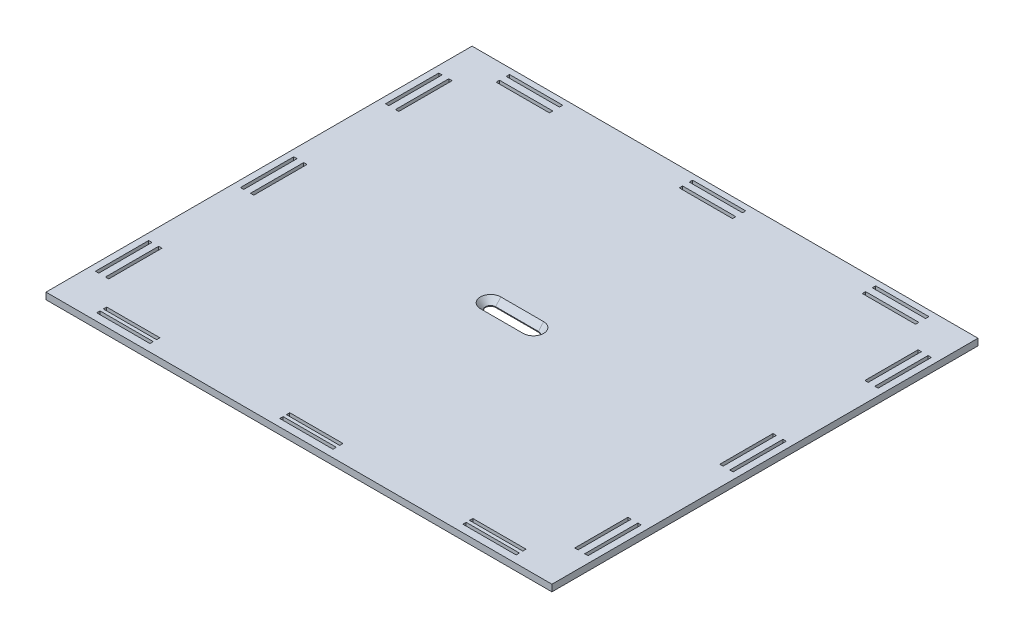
ISO-10303-21;
HEADER;
FILE_DESCRIPTION(('STEP AP214'),'2;1');
FILE_NAME('part.step','',(''),(''),'','','');
FILE_SCHEMA(('AUTOMOTIVE_DESIGN { 1 0 10303 214 1 1 1 1 }'));
ENDSEC;
DATA;
#1=APPLICATION_CONTEXT('core data for automotive mechanical design processes');
#2=APPLICATION_PROTOCOL_DEFINITION('international standard','automotive_design',2000,#1);
#3=PRODUCT_CONTEXT('',#1,'mechanical');
#4=PRODUCT('Part','Part','',(#3));
#5=PRODUCT_RELATED_PRODUCT_CATEGORY('part','',(#4));
#6=PRODUCT_DEFINITION_FORMATION('','',#4);
#7=PRODUCT_DEFINITION_CONTEXT('part definition',#1,'design');
#8=PRODUCT_DEFINITION('design','',#6,#7);
#9=PRODUCT_DEFINITION_SHAPE('','',#8);
#10=(LENGTH_UNIT() NAMED_UNIT(*) SI_UNIT(.MILLI.,.METRE.));
#11=(NAMED_UNIT(*) PLANE_ANGLE_UNIT() SI_UNIT($,.RADIAN.));
#12=(NAMED_UNIT(*) SI_UNIT($,.STERADIAN.) SOLID_ANGLE_UNIT());
#13=UNCERTAINTY_MEASURE_WITH_UNIT(LENGTH_MEASURE(1.E-05),#10,'distance_accuracy_value','');
#14=(GEOMETRIC_REPRESENTATION_CONTEXT(3) GLOBAL_UNCERTAINTY_ASSIGNED_CONTEXT((#13)) GLOBAL_UNIT_ASSIGNED_CONTEXT((#10,
#11,#12)) REPRESENTATION_CONTEXT('',''));
#15=CARTESIAN_POINT('',(0.,0.,0.));
#16=DIRECTION('',(0.,0.,1.));
#17=DIRECTION('',(1.,0.,0.));
#18=AXIS2_PLACEMENT_3D('',#15,#16,#17);
#19=CARTESIAN_POINT('',(-208.896857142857,6.35,-227.493285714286));
#20=DIRECTION('',(1.,0.,0.));
#21=DIRECTION('',(0.,0.,-1.));
#22=AXIS2_PLACEMENT_3D('',#19,#20,#21);
#23=PLANE('',#22);
#24=DIRECTION('',(0.,0.,1.));
#25=VECTOR('',#24,1.);
#26=CARTESIAN_POINT('',(-208.896857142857,6.35,-227.493285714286));
#27=LINE('',#26,#25);
#28=CARTESIAN_POINT('',(-208.896857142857,6.35,-227.493285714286));
#29=VERTEX_POINT('',#28);
#30=CARTESIAN_POINT('',(-208.896857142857,6.35,178.906714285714));
#31=VERTEX_POINT('',#30);
#32=EDGE_CURVE('E748',#29,#31,#27,.T.);
#33=ORIENTED_EDGE('',*,*,#32,.F.);
#34=DIRECTION('',(0.,-1.,0.));
#35=VECTOR('',#34,1.);
#36=CARTESIAN_POINT('',(-208.896857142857,6.35,-227.493285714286));
#37=LINE('',#36,#35);
#38=CARTESIAN_POINT('',(-208.896857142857,0.,-227.493285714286));
#39=VERTEX_POINT('',#38);
#40=EDGE_CURVE('E1373',#29,#39,#37,.T.);
#41=ORIENTED_EDGE('',*,*,#40,.T.);
#42=DIRECTION('',(0.,0.,1.));
#43=VECTOR('',#42,1.);
#44=CARTESIAN_POINT('',(-208.896857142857,0.,-227.493285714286));
#45=LINE('',#44,#43);
#46=CARTESIAN_POINT('',(-208.896857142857,0.,178.906714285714));
#47=VERTEX_POINT('',#46);
#48=EDGE_CURVE('E1256',#39,#47,#45,.T.);
#49=ORIENTED_EDGE('',*,*,#48,.T.);
#50=DIRECTION('',(0.,-1.,0.));
#51=VECTOR('',#50,1.);
#52=CARTESIAN_POINT('',(-208.896857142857,6.35,178.906714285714));
#53=LINE('',#52,#51);
#54=EDGE_CURVE('E1382',#31,#47,#53,.T.);
#55=ORIENTED_EDGE('',*,*,#54,.F.);
#56=EDGE_LOOP('',(#33,#41,#49,#55));
#57=FACE_BOUND('',#56,.T.);
#58=ADVANCED_FACE('F49',(#57),#23,.F.);
#59=CARTESIAN_POINT('',(-208.896857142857,6.35,178.906714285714));
#60=DIRECTION('',(0.,0.,-1.));
#61=DIRECTION('',(-1.,0.,0.));
#62=AXIS2_PLACEMENT_3D('',#59,#60,#61);
#63=PLANE('',#62);
#64=DIRECTION('',(1.,0.,0.));
#65=VECTOR('',#64,1.);
#66=CARTESIAN_POINT('',(-208.896857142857,6.35,178.906714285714));
#67=LINE('',#66,#65);
#68=CARTESIAN_POINT('',(273.703142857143,6.35,178.906714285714));
#69=VERTEX_POINT('',#68);
#70=EDGE_CURVE('E751',#31,#69,#67,.T.);
#71=ORIENTED_EDGE('',*,*,#70,.F.);
#72=ORIENTED_EDGE('',*,*,#54,.T.);
#73=DIRECTION('',(1.,0.,0.));
#74=VECTOR('',#73,1.);
#75=CARTESIAN_POINT('',(-208.896857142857,0.,178.906714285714));
#76=LINE('',#75,#74);
#77=CARTESIAN_POINT('',(273.703142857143,0.,178.906714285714));
#78=VERTEX_POINT('',#77);
#79=EDGE_CURVE('E1361',#47,#78,#76,.T.);
#80=ORIENTED_EDGE('',*,*,#79,.T.);
#81=DIRECTION('',(0.,-1.,0.));
#82=VECTOR('',#81,1.);
#83=CARTESIAN_POINT('',(273.703142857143,6.35,178.906714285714));
#84=LINE('',#83,#82);
#85=EDGE_CURVE('E1379',#69,#78,#84,.T.);
#86=ORIENTED_EDGE('',*,*,#85,.F.);
#87=EDGE_LOOP('',(#71,#72,#80,#86));
#88=FACE_BOUND('',#87,.T.);
#89=ADVANCED_FACE('F1896',(#88),#63,.F.);
#90=CARTESIAN_POINT('',(273.703142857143,6.35,-227.493285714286));
#91=DIRECTION('',(-1.,0.,0.));
#92=DIRECTION('',(0.,0.,1.));
#93=AXIS2_PLACEMENT_3D('',#90,#91,#92);
#94=PLANE('',#93);
#95=DIRECTION('',(0.,0.,-1.));
#96=VECTOR('',#95,1.);
#97=CARTESIAN_POINT('',(273.703142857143,6.35,178.906714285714));
#98=LINE('',#97,#96);
#99=CARTESIAN_POINT('',(273.703142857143,6.35,-227.493285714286));
#100=VERTEX_POINT('',#99);
#101=EDGE_CURVE('E754',#69,#100,#98,.T.);
#102=ORIENTED_EDGE('',*,*,#101,.F.);
#103=ORIENTED_EDGE('',*,*,#85,.T.);
#104=DIRECTION('',(0.,0.,-1.));
#105=VECTOR('',#104,1.);
#106=CARTESIAN_POINT('',(273.703142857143,0.,-227.493285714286));
#107=LINE('',#106,#105);
#108=CARTESIAN_POINT('',(273.703142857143,0.,-227.493285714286));
#109=VERTEX_POINT('',#108);
#110=EDGE_CURVE('E1365',#78,#109,#107,.T.);
#111=ORIENTED_EDGE('',*,*,#110,.T.);
#112=DIRECTION('',(0.,-1.,0.));
#113=VECTOR('',#112,1.);
#114=CARTESIAN_POINT('',(273.703142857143,6.35,-227.493285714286));
#115=LINE('',#114,#113);
#116=EDGE_CURVE('E1376',#100,#109,#115,.T.);
#117=ORIENTED_EDGE('',*,*,#116,.F.);
#118=EDGE_LOOP('',(#102,#103,#111,#117));
#119=FACE_BOUND('',#118,.T.);
#120=ADVANCED_FACE('F1903',(#119),#94,.F.);
#121=CARTESIAN_POINT('',(-208.896857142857,6.35,-227.493285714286));
#122=DIRECTION('',(0.,0.,1.));
#123=DIRECTION('',(1.,0.,0.));
#124=AXIS2_PLACEMENT_3D('',#121,#122,#123);
#125=PLANE('',#124);
#126=DIRECTION('',(-1.,0.,0.));
#127=VECTOR('',#126,1.);
#128=CARTESIAN_POINT('',(273.703142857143,6.35,-227.493285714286));
#129=LINE('',#128,#127);
#130=EDGE_CURVE('E740',#100,#29,#129,.T.);
#131=ORIENTED_EDGE('',*,*,#130,.F.);
#132=ORIENTED_EDGE('',*,*,#116,.T.);
#133=DIRECTION('',(-1.,0.,0.));
#134=VECTOR('',#133,1.);
#135=CARTESIAN_POINT('',(-208.896857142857,0.,-227.493285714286));
#136=LINE('',#135,#134);
#137=EDGE_CURVE('E1369',#109,#39,#136,.T.);
#138=ORIENTED_EDGE('',*,*,#137,.T.);
#139=ORIENTED_EDGE('',*,*,#40,.F.);
#140=EDGE_LOOP('',(#131,#132,#138,#139));
#141=FACE_BOUND('',#140,.T.);
#142=ADVANCED_FACE('F2036',(#141),#125,.F.);
#143=CARTESIAN_POINT('',(254.653142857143,0.,87.3330300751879));
#144=DIRECTION('',(-1.,0.,0.));
#145=DIRECTION('',(0.,0.,1.));
#146=AXIS2_PLACEMENT_3D('',#143,#144,#145);
#147=PLANE('',#146);
#148=DIRECTION('',(0.,0.,1.));
#149=VECTOR('',#148,1.);
#150=CARTESIAN_POINT('',(254.653142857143,6.35,276.726315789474));
#151=LINE('',#150,#149);
#152=CARTESIAN_POINT('',(254.653142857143,6.35,87.3330300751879));
#153=VERTEX_POINT('',#152);
#154=CARTESIAN_POINT('',(254.653142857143,6.35,138.133030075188));
#155=VERTEX_POINT('',#154);
#156=EDGE_CURVE('E1808',#153,#155,#151,.T.);
#157=ORIENTED_EDGE('',*,*,#156,.T.);
#158=DIRECTION('',(0.,1.,0.));
#159=VECTOR('',#158,1.);
#160=CARTESIAN_POINT('',(254.653142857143,0.,138.133030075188));
#161=LINE('',#160,#159);
#162=CARTESIAN_POINT('',(254.653142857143,0.,138.133030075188));
#163=VERTEX_POINT('',#162);
#164=EDGE_CURVE('E1837',#163,#155,#161,.T.);
#165=ORIENTED_EDGE('',*,*,#164,.F.);
#166=DIRECTION('',(0.,0.,1.));
#167=VECTOR('',#166,1.);
#168=CARTESIAN_POINT('',(254.653142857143,0.,87.3330300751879));
#169=LINE('',#168,#167);
#170=CARTESIAN_POINT('',(254.653142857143,0.,87.3330300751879));
#171=VERTEX_POINT('',#170);
#172=EDGE_CURVE('E1815',#171,#163,#169,.T.);
#173=ORIENTED_EDGE('',*,*,#172,.F.);
#174=DIRECTION('',(0.,1.,0.));
#175=VECTOR('',#174,1.);
#176=CARTESIAN_POINT('',(254.653142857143,0.,87.3330300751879));
#177=LINE('',#176,#175);
#178=EDGE_CURVE('E1825',#171,#153,#177,.T.);
#179=ORIENTED_EDGE('',*,*,#178,.T.);
#180=EDGE_LOOP('',(#157,#165,#173,#179));
#181=FACE_BOUND('',#180,.T.);
#182=ADVANCED_FACE('F2032',(#181),#147,.F.);
#183=CARTESIAN_POINT('',(257.828142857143,0.,138.133030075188));
#184=DIRECTION('',(0.,0.,1.));
#185=DIRECTION('',(1.,0.,0.));
#186=AXIS2_PLACEMENT_3D('',#183,#184,#185);
#187=PLANE('',#186);
#188=DIRECTION('',(1.,0.,0.));
#189=VECTOR('',#188,1.);
#190=CARTESIAN_POINT('',(0.,6.35,138.133030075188));
#191=LINE('',#190,#189);
#192=CARTESIAN_POINT('',(257.828142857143,6.35,138.133030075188));
#193=VERTEX_POINT('',#192);
#194=EDGE_CURVE('E1804',#155,#193,#191,.T.);
#195=ORIENTED_EDGE('',*,*,#194,.T.);
#196=DIRECTION('',(0.,1.,0.));
#197=VECTOR('',#196,1.);
#198=CARTESIAN_POINT('',(257.828142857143,0.,138.133030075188));
#199=LINE('',#198,#197);
#200=CARTESIAN_POINT('',(257.828142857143,0.,138.133030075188));
#201=VERTEX_POINT('',#200);
#202=EDGE_CURVE('E1833',#201,#193,#199,.T.);
#203=ORIENTED_EDGE('',*,*,#202,.F.);
#204=DIRECTION('',(1.,0.,0.));
#205=VECTOR('',#204,1.);
#206=CARTESIAN_POINT('',(257.828142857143,0.,138.133030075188));
#207=LINE('',#206,#205);
#208=EDGE_CURVE('E1818',#163,#201,#207,.T.);
#209=ORIENTED_EDGE('',*,*,#208,.F.);
#210=ORIENTED_EDGE('',*,*,#164,.T.);
#211=EDGE_LOOP('',(#195,#203,#209,#210));
#212=FACE_BOUND('',#211,.T.);
#213=ADVANCED_FACE('F2028',(#212),#187,.F.);
#214=CARTESIAN_POINT('',(257.828142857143,0.,87.3330300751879));
#215=DIRECTION('',(1.,0.,0.));
#216=DIRECTION('',(0.,0.,-1.));
#217=AXIS2_PLACEMENT_3D('',#214,#215,#216);
#218=PLANE('',#217);
#219=DIRECTION('',(0.,0.,-1.));
#220=VECTOR('',#219,1.);
#221=CARTESIAN_POINT('',(257.828142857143,6.35,276.726315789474));
#222=LINE('',#221,#220);
#223=CARTESIAN_POINT('',(257.828142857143,6.35,87.3330300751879));
#224=VERTEX_POINT('',#223);
#225=EDGE_CURVE('E1800',#193,#224,#222,.T.);
#226=ORIENTED_EDGE('',*,*,#225,.T.);
#227=DIRECTION('',(0.,1.,0.));
#228=VECTOR('',#227,1.);
#229=CARTESIAN_POINT('',(257.828142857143,0.,87.3330300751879));
#230=LINE('',#229,#228);
#231=CARTESIAN_POINT('',(257.828142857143,0.,87.3330300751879));
#232=VERTEX_POINT('',#231);
#233=EDGE_CURVE('E1829',#232,#224,#230,.T.);
#234=ORIENTED_EDGE('',*,*,#233,.F.);
#235=DIRECTION('',(0.,0.,-1.));
#236=VECTOR('',#235,1.);
#237=CARTESIAN_POINT('',(257.828142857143,0.,87.3330300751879));
#238=LINE('',#237,#236);
#239=EDGE_CURVE('E1821',#201,#232,#238,.T.);
#240=ORIENTED_EDGE('',*,*,#239,.F.);
#241=ORIENTED_EDGE('',*,*,#202,.T.);
#242=EDGE_LOOP('',(#226,#234,#240,#241));
#243=FACE_BOUND('',#242,.T.);
#244=ADVANCED_FACE('F2024',(#243),#218,.F.);
#245=CARTESIAN_POINT('',(257.828142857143,0.,87.3330300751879));
#246=DIRECTION('',(0.,0.,-1.));
#247=DIRECTION('',(-1.,0.,0.));
#248=AXIS2_PLACEMENT_3D('',#245,#246,#247);
#249=PLANE('',#248);
#250=DIRECTION('',(-1.,0.,0.));
#251=VECTOR('',#250,1.);
#252=CARTESIAN_POINT('',(0.,6.35,87.3330300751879));
#253=LINE('',#252,#251);
#254=EDGE_CURVE('E1797',#224,#153,#253,.T.);
#255=ORIENTED_EDGE('',*,*,#254,.T.);
#256=ORIENTED_EDGE('',*,*,#178,.F.);
#257=DIRECTION('',(-1.,0.,0.));
#258=VECTOR('',#257,1.);
#259=CARTESIAN_POINT('',(257.828142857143,0.,87.3330300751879));
#260=LINE('',#259,#258);
#261=EDGE_CURVE('E1812',#232,#171,#260,.T.);
#262=ORIENTED_EDGE('',*,*,#261,.F.);
#263=ORIENTED_EDGE('',*,*,#233,.T.);
#264=EDGE_LOOP('',(#255,#256,#262,#263));
#265=FACE_BOUND('',#264,.T.);
#266=ADVANCED_FACE('F2020',(#265),#249,.F.);
#267=CARTESIAN_POINT('',(-193.021857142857,0.,87.3330300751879));
#268=DIRECTION('',(0.,0.,-1.));
#269=DIRECTION('',(-1.,0.,0.));
#270=AXIS2_PLACEMENT_3D('',#267,#268,#269);
#271=PLANE('',#270);
#272=DIRECTION('',(-1.,0.,0.));
#273=VECTOR('',#272,1.);
#274=CARTESIAN_POINT('',(0.,6.35,87.3330300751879));
#275=LINE('',#274,#273);
#276=CARTESIAN_POINT('',(-189.846857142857,6.35,87.3330300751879));
#277=VERTEX_POINT('',#276);
#278=CARTESIAN_POINT('',(-193.021857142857,6.35,87.3330300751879));
#279=VERTEX_POINT('',#278);
#280=EDGE_CURVE('E1764',#277,#279,#275,.T.);
#281=ORIENTED_EDGE('',*,*,#280,.T.);
#282=DIRECTION('',(0.,1.,0.));
#283=VECTOR('',#282,1.);
#284=CARTESIAN_POINT('',(-193.021857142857,0.,87.3330300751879));
#285=LINE('',#284,#283);
#286=CARTESIAN_POINT('',(-193.021857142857,0.,87.3330300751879));
#287=VERTEX_POINT('',#286);
#288=EDGE_CURVE('E1793',#287,#279,#285,.T.);
#289=ORIENTED_EDGE('',*,*,#288,.F.);
#290=DIRECTION('',(-1.,0.,0.));
#291=VECTOR('',#290,1.);
#292=CARTESIAN_POINT('',(-193.021857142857,0.,87.3330300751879));
#293=LINE('',#292,#291);
#294=CARTESIAN_POINT('',(-189.846857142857,0.,87.3330300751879));
#295=VERTEX_POINT('',#294);
#296=EDGE_CURVE('E1771',#295,#287,#293,.T.);
#297=ORIENTED_EDGE('',*,*,#296,.F.);
#298=DIRECTION('',(0.,1.,0.));
#299=VECTOR('',#298,1.);
#300=CARTESIAN_POINT('',(-189.846857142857,0.,87.3330300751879));
#301=LINE('',#300,#299);
#302=EDGE_CURVE('E1781',#295,#277,#301,.T.);
#303=ORIENTED_EDGE('',*,*,#302,.T.);
#304=EDGE_LOOP('',(#281,#289,#297,#303));
#305=FACE_BOUND('',#304,.T.);
#306=ADVANCED_FACE('F2016',(#305),#271,.F.);
#307=CARTESIAN_POINT('',(-193.021857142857,0.,87.3330300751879));
#308=DIRECTION('',(-1.,0.,0.));
#309=DIRECTION('',(0.,0.,1.));
#310=AXIS2_PLACEMENT_3D('',#307,#308,#309);
#311=PLANE('',#310);
#312=DIRECTION('',(0.,0.,1.));
#313=VECTOR('',#312,1.);
#314=CARTESIAN_POINT('',(-193.021857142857,6.35,276.726315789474));
#315=LINE('',#314,#313);
#316=CARTESIAN_POINT('',(-193.021857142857,6.35,138.133030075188));
#317=VERTEX_POINT('',#316);
#318=EDGE_CURVE('E1760',#279,#317,#315,.T.);
#319=ORIENTED_EDGE('',*,*,#318,.T.);
#320=DIRECTION('',(0.,1.,0.));
#321=VECTOR('',#320,1.);
#322=CARTESIAN_POINT('',(-193.021857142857,0.,138.133030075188));
#323=LINE('',#322,#321);
#324=CARTESIAN_POINT('',(-193.021857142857,0.,138.133030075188));
#325=VERTEX_POINT('',#324);
#326=EDGE_CURVE('E1789',#325,#317,#323,.T.);
#327=ORIENTED_EDGE('',*,*,#326,.F.);
#328=DIRECTION('',(0.,0.,1.));
#329=VECTOR('',#328,1.);
#330=CARTESIAN_POINT('',(-193.021857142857,0.,87.3330300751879));
#331=LINE('',#330,#329);
#332=EDGE_CURVE('E1774',#287,#325,#331,.T.);
#333=ORIENTED_EDGE('',*,*,#332,.F.);
#334=ORIENTED_EDGE('',*,*,#288,.T.);
#335=EDGE_LOOP('',(#319,#327,#333,#334));
#336=FACE_BOUND('',#335,.T.);
#337=ADVANCED_FACE('F2012',(#336),#311,.F.);
#338=CARTESIAN_POINT('',(-193.021857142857,0.,138.133030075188));
#339=DIRECTION('',(0.,0.,1.));
#340=DIRECTION('',(1.,0.,0.));
#341=AXIS2_PLACEMENT_3D('',#338,#339,#340);
#342=PLANE('',#341);
#343=DIRECTION('',(1.,0.,0.));
#344=VECTOR('',#343,1.);
#345=CARTESIAN_POINT('',(0.,6.35,138.133030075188));
#346=LINE('',#345,#344);
#347=CARTESIAN_POINT('',(-189.846857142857,6.35,138.133030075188));
#348=VERTEX_POINT('',#347);
#349=EDGE_CURVE('E1756',#317,#348,#346,.T.);
#350=ORIENTED_EDGE('',*,*,#349,.T.);
#351=DIRECTION('',(0.,1.,0.));
#352=VECTOR('',#351,1.);
#353=CARTESIAN_POINT('',(-189.846857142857,0.,138.133030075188));
#354=LINE('',#353,#352);
#355=CARTESIAN_POINT('',(-189.846857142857,0.,138.133030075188));
#356=VERTEX_POINT('',#355);
#357=EDGE_CURVE('E1785',#356,#348,#354,.T.);
#358=ORIENTED_EDGE('',*,*,#357,.F.);
#359=DIRECTION('',(1.,0.,0.));
#360=VECTOR('',#359,1.);
#361=CARTESIAN_POINT('',(-193.021857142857,0.,138.133030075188));
#362=LINE('',#361,#360);
#363=EDGE_CURVE('E1777',#325,#356,#362,.T.);
#364=ORIENTED_EDGE('',*,*,#363,.F.);
#365=ORIENTED_EDGE('',*,*,#326,.T.);
#366=EDGE_LOOP('',(#350,#358,#364,#365));
#367=FACE_BOUND('',#366,.T.);
#368=ADVANCED_FACE('F2008',(#367),#342,.F.);
#369=CARTESIAN_POINT('',(-189.846857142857,0.,87.3330300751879));
#370=DIRECTION('',(1.,0.,0.));
#371=DIRECTION('',(0.,0.,-1.));
#372=AXIS2_PLACEMENT_3D('',#369,#370,#371);
#373=PLANE('',#372);
#374=DIRECTION('',(0.,0.,-1.));
#375=VECTOR('',#374,1.);
#376=CARTESIAN_POINT('',(-189.846857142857,6.35,276.726315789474));
#377=LINE('',#376,#375);
#378=EDGE_CURVE('E1753',#348,#277,#377,.T.);
#379=ORIENTED_EDGE('',*,*,#378,.T.);
#380=ORIENTED_EDGE('',*,*,#302,.F.);
#381=DIRECTION('',(0.,0.,-1.));
#382=VECTOR('',#381,1.);
#383=CARTESIAN_POINT('',(-189.846857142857,0.,87.3330300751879));
#384=LINE('',#383,#382);
#385=EDGE_CURVE('E1768',#356,#295,#384,.T.);
#386=ORIENTED_EDGE('',*,*,#385,.F.);
#387=ORIENTED_EDGE('',*,*,#357,.T.);
#388=EDGE_LOOP('',(#379,#380,#386,#387));
#389=FACE_BOUND('',#388,.T.);
#390=ADVANCED_FACE('F2004',(#389),#373,.F.);
#391=CARTESIAN_POINT('',(267.353142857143,0.,87.3330300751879));
#392=DIRECTION('',(0.,0.,-1.));
#393=DIRECTION('',(-1.,0.,0.));
#394=AXIS2_PLACEMENT_3D('',#391,#392,#393);
#395=PLANE('',#394);
#396=DIRECTION('',(-1.,0.,0.));
#397=VECTOR('',#396,1.);
#398=CARTESIAN_POINT('',(0.,6.35,87.3330300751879));
#399=LINE('',#398,#397);
#400=CARTESIAN_POINT('',(267.353142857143,6.35,87.3330300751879));
#401=VERTEX_POINT('',#400);
#402=CARTESIAN_POINT('',(264.178142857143,6.35,87.3330300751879));
#403=VERTEX_POINT('',#402);
#404=EDGE_CURVE('E1720',#401,#403,#399,.T.);
#405=ORIENTED_EDGE('',*,*,#404,.T.);
#406=DIRECTION('',(0.,1.,0.));
#407=VECTOR('',#406,1.);
#408=CARTESIAN_POINT('',(264.178142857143,0.,87.3330300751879));
#409=LINE('',#408,#407);
#410=CARTESIAN_POINT('',(264.178142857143,0.,87.3330300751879));
#411=VERTEX_POINT('',#410);
#412=EDGE_CURVE('E1749',#411,#403,#409,.T.);
#413=ORIENTED_EDGE('',*,*,#412,.F.);
#414=DIRECTION('',(-1.,0.,0.));
#415=VECTOR('',#414,1.);
#416=CARTESIAN_POINT('',(267.353142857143,0.,87.3330300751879));
#417=LINE('',#416,#415);
#418=CARTESIAN_POINT('',(267.353142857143,0.,87.3330300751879));
#419=VERTEX_POINT('',#418);
#420=EDGE_CURVE('E1727',#419,#411,#417,.T.);
#421=ORIENTED_EDGE('',*,*,#420,.F.);
#422=DIRECTION('',(0.,1.,0.));
#423=VECTOR('',#422,1.);
#424=CARTESIAN_POINT('',(267.353142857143,0.,87.3330300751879));
#425=LINE('',#424,#423);
#426=EDGE_CURVE('E1737',#419,#401,#425,.T.);
#427=ORIENTED_EDGE('',*,*,#426,.T.);
#428=EDGE_LOOP('',(#405,#413,#421,#427));
#429=FACE_BOUND('',#428,.T.);
#430=ADVANCED_FACE('F2000',(#429),#395,.F.);
#431=CARTESIAN_POINT('',(264.178142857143,0.,87.3330300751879));
#432=DIRECTION('',(-1.,0.,0.));
#433=DIRECTION('',(0.,0.,1.));
#434=AXIS2_PLACEMENT_3D('',#431,#432,#433);
#435=PLANE('',#434);
#436=DIRECTION('',(0.,0.,1.));
#437=VECTOR('',#436,1.);
#438=CARTESIAN_POINT('',(264.178142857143,6.35,276.726315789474));
#439=LINE('',#438,#437);
#440=CARTESIAN_POINT('',(264.178142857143,6.35,138.133030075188));
#441=VERTEX_POINT('',#440);
#442=EDGE_CURVE('E1716',#403,#441,#439,.T.);
#443=ORIENTED_EDGE('',*,*,#442,.T.);
#444=DIRECTION('',(0.,1.,0.));
#445=VECTOR('',#444,1.);
#446=CARTESIAN_POINT('',(264.178142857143,0.,138.133030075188));
#447=LINE('',#446,#445);
#448=CARTESIAN_POINT('',(264.178142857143,0.,138.133030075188));
#449=VERTEX_POINT('',#448);
#450=EDGE_CURVE('E1745',#449,#441,#447,.T.);
#451=ORIENTED_EDGE('',*,*,#450,.F.);
#452=DIRECTION('',(0.,0.,1.));
#453=VECTOR('',#452,1.);
#454=CARTESIAN_POINT('',(264.178142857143,0.,87.3330300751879));
#455=LINE('',#454,#453);
#456=EDGE_CURVE('E1730',#411,#449,#455,.T.);
#457=ORIENTED_EDGE('',*,*,#456,.F.);
#458=ORIENTED_EDGE('',*,*,#412,.T.);
#459=EDGE_LOOP('',(#443,#451,#457,#458));
#460=FACE_BOUND('',#459,.T.);
#461=ADVANCED_FACE('F1996',(#460),#435,.F.);
#462=CARTESIAN_POINT('',(267.353142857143,0.,138.133030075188));
#463=DIRECTION('',(0.,0.,1.));
#464=DIRECTION('',(1.,0.,0.));
#465=AXIS2_PLACEMENT_3D('',#462,#463,#464);
#466=PLANE('',#465);
#467=DIRECTION('',(1.,0.,0.));
#468=VECTOR('',#467,1.);
#469=CARTESIAN_POINT('',(0.,6.35,138.133030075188));
#470=LINE('',#469,#468);
#471=CARTESIAN_POINT('',(267.353142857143,6.35,138.133030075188));
#472=VERTEX_POINT('',#471);
#473=EDGE_CURVE('E1712',#441,#472,#470,.T.);
#474=ORIENTED_EDGE('',*,*,#473,.T.);
#475=DIRECTION('',(0.,1.,0.));
#476=VECTOR('',#475,1.);
#477=CARTESIAN_POINT('',(267.353142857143,0.,138.133030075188));
#478=LINE('',#477,#476);
#479=CARTESIAN_POINT('',(267.353142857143,0.,138.133030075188));
#480=VERTEX_POINT('',#479);
#481=EDGE_CURVE('E1741',#480,#472,#478,.T.);
#482=ORIENTED_EDGE('',*,*,#481,.F.);
#483=DIRECTION('',(1.,0.,0.));
#484=VECTOR('',#483,1.);
#485=CARTESIAN_POINT('',(267.353142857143,0.,138.133030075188));
#486=LINE('',#485,#484);
#487=EDGE_CURVE('E1733',#449,#480,#486,.T.);
#488=ORIENTED_EDGE('',*,*,#487,.F.);
#489=ORIENTED_EDGE('',*,*,#450,.T.);
#490=EDGE_LOOP('',(#474,#482,#488,#489));
#491=FACE_BOUND('',#490,.T.);
#492=ADVANCED_FACE('F1992',(#491),#466,.F.);
#493=CARTESIAN_POINT('',(267.353142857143,0.,87.3330300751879));
#494=DIRECTION('',(1.,0.,0.));
#495=DIRECTION('',(0.,0.,-1.));
#496=AXIS2_PLACEMENT_3D('',#493,#494,#495);
#497=PLANE('',#496);
#498=DIRECTION('',(0.,0.,-1.));
#499=VECTOR('',#498,1.);
#500=CARTESIAN_POINT('',(267.353142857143,6.35,276.726315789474));
#501=LINE('',#500,#499);
#502=EDGE_CURVE('E1709',#472,#401,#501,.T.);
#503=ORIENTED_EDGE('',*,*,#502,.T.);
#504=ORIENTED_EDGE('',*,*,#426,.F.);
#505=DIRECTION('',(0.,0.,-1.));
#506=VECTOR('',#505,1.);
#507=CARTESIAN_POINT('',(267.353142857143,0.,87.3330300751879));
#508=LINE('',#507,#506);
#509=EDGE_CURVE('E1724',#480,#419,#508,.T.);
#510=ORIENTED_EDGE('',*,*,#509,.F.);
#511=ORIENTED_EDGE('',*,*,#481,.T.);
#512=EDGE_LOOP('',(#503,#504,#510,#511));
#513=FACE_BOUND('',#512,.T.);
#514=ADVANCED_FACE('F1988',(#513),#497,.F.);
#515=CARTESIAN_POINT('',(-202.546857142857,0.,87.3330300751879));
#516=DIRECTION('',(0.,0.,-1.));
#517=DIRECTION('',(-1.,0.,0.));
#518=AXIS2_PLACEMENT_3D('',#515,#516,#517);
#519=PLANE('',#518);
#520=DIRECTION('',(-1.,0.,0.));
#521=VECTOR('',#520,1.);
#522=CARTESIAN_POINT('',(0.,6.35,87.3330300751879));
#523=LINE('',#522,#521);
#524=CARTESIAN_POINT('',(-199.371857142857,6.35,87.3330300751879));
#525=VERTEX_POINT('',#524);
#526=CARTESIAN_POINT('',(-202.546857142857,6.35,87.3330300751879));
#527=VERTEX_POINT('',#526);
#528=EDGE_CURVE('E1676',#525,#527,#523,.T.);
#529=ORIENTED_EDGE('',*,*,#528,.T.);
#530=DIRECTION('',(0.,1.,0.));
#531=VECTOR('',#530,1.);
#532=CARTESIAN_POINT('',(-202.546857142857,0.,87.3330300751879));
#533=LINE('',#532,#531);
#534=CARTESIAN_POINT('',(-202.546857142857,0.,87.3330300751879));
#535=VERTEX_POINT('',#534);
#536=EDGE_CURVE('E1705',#535,#527,#533,.T.);
#537=ORIENTED_EDGE('',*,*,#536,.F.);
#538=DIRECTION('',(-1.,0.,0.));
#539=VECTOR('',#538,1.);
#540=CARTESIAN_POINT('',(-202.546857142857,0.,87.3330300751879));
#541=LINE('',#540,#539);
#542=CARTESIAN_POINT('',(-199.371857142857,0.,87.3330300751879));
#543=VERTEX_POINT('',#542);
#544=EDGE_CURVE('E1683',#543,#535,#541,.T.);
#545=ORIENTED_EDGE('',*,*,#544,.F.);
#546=DIRECTION('',(0.,1.,0.));
#547=VECTOR('',#546,1.);
#548=CARTESIAN_POINT('',(-199.371857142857,0.,87.3330300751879));
#549=LINE('',#548,#547);
#550=EDGE_CURVE('E1693',#543,#525,#549,.T.);
#551=ORIENTED_EDGE('',*,*,#550,.T.);
#552=EDGE_LOOP('',(#529,#537,#545,#551));
#553=FACE_BOUND('',#552,.T.);
#554=ADVANCED_FACE('F1984',(#553),#519,.F.);
#555=CARTESIAN_POINT('',(-202.546857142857,0.,87.3330300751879));
#556=DIRECTION('',(-1.,0.,0.));
#557=DIRECTION('',(0.,0.,1.));
#558=AXIS2_PLACEMENT_3D('',#555,#556,#557);
#559=PLANE('',#558);
#560=DIRECTION('',(0.,0.,1.));
#561=VECTOR('',#560,1.);
#562=CARTESIAN_POINT('',(-202.546857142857,6.35,276.726315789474));
#563=LINE('',#562,#561);
#564=CARTESIAN_POINT('',(-202.546857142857,6.35,138.133030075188));
#565=VERTEX_POINT('',#564);
#566=EDGE_CURVE('E1672',#527,#565,#563,.T.);
#567=ORIENTED_EDGE('',*,*,#566,.T.);
#568=DIRECTION('',(0.,1.,0.));
#569=VECTOR('',#568,1.);
#570=CARTESIAN_POINT('',(-202.546857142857,0.,138.133030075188));
#571=LINE('',#570,#569);
#572=CARTESIAN_POINT('',(-202.546857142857,0.,138.133030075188));
#573=VERTEX_POINT('',#572);
#574=EDGE_CURVE('E1701',#573,#565,#571,.T.);
#575=ORIENTED_EDGE('',*,*,#574,.F.);
#576=DIRECTION('',(0.,0.,1.));
#577=VECTOR('',#576,1.);
#578=CARTESIAN_POINT('',(-202.546857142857,0.,87.3330300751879));
#579=LINE('',#578,#577);
#580=EDGE_CURVE('E1686',#535,#573,#579,.T.);
#581=ORIENTED_EDGE('',*,*,#580,.F.);
#582=ORIENTED_EDGE('',*,*,#536,.T.);
#583=EDGE_LOOP('',(#567,#575,#581,#582));
#584=FACE_BOUND('',#583,.T.);
#585=ADVANCED_FACE('F1980',(#584),#559,.F.);
#586=CARTESIAN_POINT('',(-202.546857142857,0.,138.133030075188));
#587=DIRECTION('',(0.,0.,1.));
#588=DIRECTION('',(1.,0.,0.));
#589=AXIS2_PLACEMENT_3D('',#586,#587,#588);
#590=PLANE('',#589);
#591=DIRECTION('',(1.,0.,0.));
#592=VECTOR('',#591,1.);
#593=CARTESIAN_POINT('',(0.,6.35,138.133030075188));
#594=LINE('',#593,#592);
#595=CARTESIAN_POINT('',(-199.371857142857,6.35,138.133030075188));
#596=VERTEX_POINT('',#595);
#597=EDGE_CURVE('E1668',#565,#596,#594,.T.);
#598=ORIENTED_EDGE('',*,*,#597,.T.);
#599=DIRECTION('',(0.,1.,0.));
#600=VECTOR('',#599,1.);
#601=CARTESIAN_POINT('',(-199.371857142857,0.,138.133030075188));
#602=LINE('',#601,#600);
#603=CARTESIAN_POINT('',(-199.371857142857,0.,138.133030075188));
#604=VERTEX_POINT('',#603);
#605=EDGE_CURVE('E1697',#604,#596,#602,.T.);
#606=ORIENTED_EDGE('',*,*,#605,.F.);
#607=DIRECTION('',(1.,0.,0.));
#608=VECTOR('',#607,1.);
#609=CARTESIAN_POINT('',(-202.546857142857,0.,138.133030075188));
#610=LINE('',#609,#608);
#611=EDGE_CURVE('E1689',#573,#604,#610,.T.);
#612=ORIENTED_EDGE('',*,*,#611,.F.);
#613=ORIENTED_EDGE('',*,*,#574,.T.);
#614=EDGE_LOOP('',(#598,#606,#612,#613));
#615=FACE_BOUND('',#614,.T.);
#616=ADVANCED_FACE('F1976',(#615),#590,.F.);
#617=CARTESIAN_POINT('',(-199.371857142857,0.,87.3330300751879));
#618=DIRECTION('',(1.,0.,0.));
#619=DIRECTION('',(0.,0.,-1.));
#620=AXIS2_PLACEMENT_3D('',#617,#618,#619);
#621=PLANE('',#620);
#622=DIRECTION('',(0.,0.,-1.));
#623=VECTOR('',#622,1.);
#624=CARTESIAN_POINT('',(-199.371857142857,6.35,276.726315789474));
#625=LINE('',#624,#623);
#626=EDGE_CURVE('E1665',#596,#525,#625,.T.);
#627=ORIENTED_EDGE('',*,*,#626,.T.);
#628=ORIENTED_EDGE('',*,*,#550,.F.);
#629=DIRECTION('',(0.,0.,-1.));
#630=VECTOR('',#629,1.);
#631=CARTESIAN_POINT('',(-199.371857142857,0.,87.3330300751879));
#632=LINE('',#631,#630);
#633=EDGE_CURVE('E1680',#604,#543,#632,.T.);
#634=ORIENTED_EDGE('',*,*,#633,.F.);
#635=ORIENTED_EDGE('',*,*,#605,.T.);
#636=EDGE_LOOP('',(#627,#628,#634,#635));
#637=FACE_BOUND('',#636,.T.);
#638=ADVANCED_FACE('F1972',(#637),#621,.F.);
#639=CARTESIAN_POINT('',(181.628142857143,0.,-209.229162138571));
#640=DIRECTION('',(0.,0.,1.));
#641=DIRECTION('',(1.,0.,0.));
#642=AXIS2_PLACEMENT_3D('',#639,#640,#641);
#643=PLANE('',#642);
#644=DIRECTION('',(1.,0.,0.));
#645=VECTOR('',#644,1.);
#646=CARTESIAN_POINT('',(349.25,6.35,-209.229162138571));
#647=LINE('',#646,#645);
#648=CARTESIAN_POINT('',(181.628142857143,6.35,-209.229162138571));
#649=VERTEX_POINT('',#648);
#650=CARTESIAN_POINT('',(232.428142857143,6.35,-209.229162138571));
#651=VERTEX_POINT('',#650);
#652=EDGE_CURVE('E1580',#649,#651,#647,.T.);
#653=ORIENTED_EDGE('',*,*,#652,.T.);
#654=DIRECTION('',(0.,1.,0.));
#655=VECTOR('',#654,1.);
#656=CARTESIAN_POINT('',(232.428142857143,0.,-209.229162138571));
#657=LINE('',#656,#655);
#658=CARTESIAN_POINT('',(232.428142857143,0.,-209.229162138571));
#659=VERTEX_POINT('',#658);
#660=EDGE_CURVE('E1609',#659,#651,#657,.T.);
#661=ORIENTED_EDGE('',*,*,#660,.F.);
#662=DIRECTION('',(1.,0.,0.));
#663=VECTOR('',#662,1.);
#664=CARTESIAN_POINT('',(181.628142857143,0.,-209.229162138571));
#665=LINE('',#664,#663);
#666=CARTESIAN_POINT('',(181.628142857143,0.,-209.229162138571));
#667=VERTEX_POINT('',#666);
#668=EDGE_CURVE('E1587',#667,#659,#665,.T.);
#669=ORIENTED_EDGE('',*,*,#668,.F.);
#670=DIRECTION('',(0.,1.,0.));
#671=VECTOR('',#670,1.);
#672=CARTESIAN_POINT('',(181.628142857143,0.,-209.229162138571));
#673=LINE('',#672,#671);
#674=EDGE_CURVE('E1597',#667,#649,#673,.T.);
#675=ORIENTED_EDGE('',*,*,#674,.T.);
#676=EDGE_LOOP('',(#653,#661,#669,#675));
#677=FACE_BOUND('',#676,.T.);
#678=ADVANCED_FACE('F1968',(#677),#643,.F.);
#679=CARTESIAN_POINT('',(232.428142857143,0.,-212.404162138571));
#680=DIRECTION('',(1.,0.,0.));
#681=DIRECTION('',(0.,0.,-1.));
#682=AXIS2_PLACEMENT_3D('',#679,#680,#681);
#683=PLANE('',#682);
#684=DIRECTION('',(0.,0.,-1.));
#685=VECTOR('',#684,1.);
#686=CARTESIAN_POINT('',(232.428142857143,6.35,0.));
#687=LINE('',#686,#685);
#688=CARTESIAN_POINT('',(232.428142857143,6.35,-212.404162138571));
#689=VERTEX_POINT('',#688);
#690=EDGE_CURVE('E1576',#651,#689,#687,.T.);
#691=ORIENTED_EDGE('',*,*,#690,.T.);
#692=DIRECTION('',(0.,1.,0.));
#693=VECTOR('',#692,1.);
#694=CARTESIAN_POINT('',(232.428142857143,0.,-212.404162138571));
#695=LINE('',#694,#693);
#696=CARTESIAN_POINT('',(232.428142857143,0.,-212.404162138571));
#697=VERTEX_POINT('',#696);
#698=EDGE_CURVE('E1605',#697,#689,#695,.T.);
#699=ORIENTED_EDGE('',*,*,#698,.F.);
#700=DIRECTION('',(0.,0.,-1.));
#701=VECTOR('',#700,1.);
#702=CARTESIAN_POINT('',(232.428142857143,0.,-212.404162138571));
#703=LINE('',#702,#701);
#704=EDGE_CURVE('E1590',#659,#697,#703,.T.);
#705=ORIENTED_EDGE('',*,*,#704,.F.);
#706=ORIENTED_EDGE('',*,*,#660,.T.);
#707=EDGE_LOOP('',(#691,#699,#705,#706));
#708=FACE_BOUND('',#707,.T.);
#709=ADVANCED_FACE('F1964',(#708),#683,.F.);
#710=CARTESIAN_POINT('',(181.628142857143,0.,-212.404162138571));
#711=DIRECTION('',(0.,0.,-1.));
#712=DIRECTION('',(-1.,0.,0.));
#713=AXIS2_PLACEMENT_3D('',#710,#711,#712);
#714=PLANE('',#713);
#715=DIRECTION('',(-1.,0.,0.));
#716=VECTOR('',#715,1.);
#717=CARTESIAN_POINT('',(349.25,6.35,-212.404162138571));
#718=LINE('',#717,#716);
#719=CARTESIAN_POINT('',(181.628142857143,6.35,-212.404162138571));
#720=VERTEX_POINT('',#719);
#721=EDGE_CURVE('E1572',#689,#720,#718,.T.);
#722=ORIENTED_EDGE('',*,*,#721,.T.);
#723=DIRECTION('',(0.,1.,0.));
#724=VECTOR('',#723,1.);
#725=CARTESIAN_POINT('',(181.628142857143,0.,-212.404162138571));
#726=LINE('',#725,#724);
#727=CARTESIAN_POINT('',(181.628142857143,0.,-212.404162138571));
#728=VERTEX_POINT('',#727);
#729=EDGE_CURVE('E1601',#728,#720,#726,.T.);
#730=ORIENTED_EDGE('',*,*,#729,.F.);
#731=DIRECTION('',(-1.,0.,0.));
#732=VECTOR('',#731,1.);
#733=CARTESIAN_POINT('',(181.628142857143,0.,-212.404162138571));
#734=LINE('',#733,#732);
#735=EDGE_CURVE('E1593',#697,#728,#734,.T.);
#736=ORIENTED_EDGE('',*,*,#735,.F.);
#737=ORIENTED_EDGE('',*,*,#698,.T.);
#738=EDGE_LOOP('',(#722,#730,#736,#737));
#739=FACE_BOUND('',#738,.T.);
#740=ADVANCED_FACE('F1960',(#739),#714,.F.);
#741=CARTESIAN_POINT('',(181.628142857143,0.,-212.404162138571));
#742=DIRECTION('',(-1.,0.,0.));
#743=DIRECTION('',(0.,0.,1.));
#744=AXIS2_PLACEMENT_3D('',#741,#742,#743);
#745=PLANE('',#744);
#746=DIRECTION('',(0.,0.,1.));
#747=VECTOR('',#746,1.);
#748=CARTESIAN_POINT('',(181.628142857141,6.35,-1.4042735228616E-12));
#749=LINE('',#748,#747);
#750=EDGE_CURVE('E1569',#720,#649,#749,.T.);
#751=ORIENTED_EDGE('',*,*,#750,.T.);
#752=ORIENTED_EDGE('',*,*,#674,.F.);
#753=DIRECTION('',(0.,0.,1.));
#754=VECTOR('',#753,1.);
#755=CARTESIAN_POINT('',(181.628142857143,0.,-212.404162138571));
#756=LINE('',#755,#754);
#757=EDGE_CURVE('E1584',#728,#667,#756,.T.);
#758=ORIENTED_EDGE('',*,*,#757,.F.);
#759=ORIENTED_EDGE('',*,*,#729,.T.);
#760=EDGE_LOOP('',(#751,#752,#758,#759));
#761=FACE_BOUND('',#760,.T.);
#762=ADVANCED_FACE('F1956',(#761),#745,.F.);
#763=CARTESIAN_POINT('',(181.628142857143,0.,165.480469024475));
#764=DIRECTION('',(0.,0.,1.));
#765=DIRECTION('',(1.,0.,0.));
#766=AXIS2_PLACEMENT_3D('',#763,#764,#765);
#767=PLANE('',#766);
#768=DIRECTION('',(1.,0.,0.));
#769=VECTOR('',#768,1.);
#770=CARTESIAN_POINT('',(349.25,6.35,165.480469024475));
#771=LINE('',#770,#769);
#772=CARTESIAN_POINT('',(181.628142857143,6.35,165.480469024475));
#773=VERTEX_POINT('',#772);
#774=CARTESIAN_POINT('',(232.428142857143,6.35,165.480469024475));
#775=VERTEX_POINT('',#774);
#776=EDGE_CURVE('E1536',#773,#775,#771,.T.);
#777=ORIENTED_EDGE('',*,*,#776,.T.);
#778=DIRECTION('',(0.,1.,0.));
#779=VECTOR('',#778,1.);
#780=CARTESIAN_POINT('',(232.428142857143,0.,165.480469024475));
#781=LINE('',#780,#779);
#782=CARTESIAN_POINT('',(232.428142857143,0.,165.480469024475));
#783=VERTEX_POINT('',#782);
#784=EDGE_CURVE('E1565',#783,#775,#781,.T.);
#785=ORIENTED_EDGE('',*,*,#784,.F.);
#786=DIRECTION('',(1.,0.,0.));
#787=VECTOR('',#786,1.);
#788=CARTESIAN_POINT('',(181.628142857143,0.,165.480469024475));
#789=LINE('',#788,#787);
#790=CARTESIAN_POINT('',(181.628142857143,0.,165.480469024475));
#791=VERTEX_POINT('',#790);
#792=EDGE_CURVE('E1543',#791,#783,#789,.T.);
#793=ORIENTED_EDGE('',*,*,#792,.F.);
#794=DIRECTION('',(0.,1.,0.));
#795=VECTOR('',#794,1.);
#796=CARTESIAN_POINT('',(181.628142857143,0.,165.480469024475));
#797=LINE('',#796,#795);
#798=EDGE_CURVE('E1553',#791,#773,#797,.T.);
#799=ORIENTED_EDGE('',*,*,#798,.T.);
#800=EDGE_LOOP('',(#777,#785,#793,#799));
#801=FACE_BOUND('',#800,.T.);
#802=ADVANCED_FACE('F1952',(#801),#767,.F.);
#803=CARTESIAN_POINT('',(232.428142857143,0.,162.305469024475));
#804=DIRECTION('',(1.,0.,0.));
#805=DIRECTION('',(0.,0.,-1.));
#806=AXIS2_PLACEMENT_3D('',#803,#804,#805);
#807=PLANE('',#806);
#808=DIRECTION('',(0.,0.,-1.));
#809=VECTOR('',#808,1.);
#810=CARTESIAN_POINT('',(232.428142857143,6.35,0.));
#811=LINE('',#810,#809);
#812=CARTESIAN_POINT('',(232.428142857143,6.35,162.305469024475));
#813=VERTEX_POINT('',#812);
#814=EDGE_CURVE('E1532',#775,#813,#811,.T.);
#815=ORIENTED_EDGE('',*,*,#814,.T.);
#816=DIRECTION('',(0.,1.,0.));
#817=VECTOR('',#816,1.);
#818=CARTESIAN_POINT('',(232.428142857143,0.,162.305469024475));
#819=LINE('',#818,#817);
#820=CARTESIAN_POINT('',(232.428142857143,0.,162.305469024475));
#821=VERTEX_POINT('',#820);
#822=EDGE_CURVE('E1561',#821,#813,#819,.T.);
#823=ORIENTED_EDGE('',*,*,#822,.F.);
#824=DIRECTION('',(0.,0.,-1.));
#825=VECTOR('',#824,1.);
#826=CARTESIAN_POINT('',(232.428142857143,0.,162.305469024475));
#827=LINE('',#826,#825);
#828=EDGE_CURVE('E1546',#783,#821,#827,.T.);
#829=ORIENTED_EDGE('',*,*,#828,.F.);
#830=ORIENTED_EDGE('',*,*,#784,.T.);
#831=EDGE_LOOP('',(#815,#823,#829,#830));
#832=FACE_BOUND('',#831,.T.);
#833=ADVANCED_FACE('F1948',(#832),#807,.F.);
#834=CARTESIAN_POINT('',(181.628142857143,0.,162.305469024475));
#835=DIRECTION('',(0.,0.,-1.));
#836=DIRECTION('',(-1.,0.,0.));
#837=AXIS2_PLACEMENT_3D('',#834,#835,#836);
#838=PLANE('',#837);
#839=DIRECTION('',(-1.,0.,0.));
#840=VECTOR('',#839,1.);
#841=CARTESIAN_POINT('',(349.25,6.35,162.305469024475));
#842=LINE('',#841,#840);
#843=CARTESIAN_POINT('',(181.628142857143,6.35,162.305469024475));
#844=VERTEX_POINT('',#843);
#845=EDGE_CURVE('E1528',#813,#844,#842,.T.);
#846=ORIENTED_EDGE('',*,*,#845,.T.);
#847=DIRECTION('',(0.,1.,0.));
#848=VECTOR('',#847,1.);
#849=CARTESIAN_POINT('',(181.628142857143,0.,162.305469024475));
#850=LINE('',#849,#848);
#851=CARTESIAN_POINT('',(181.628142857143,0.,162.305469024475));
#852=VERTEX_POINT('',#851);
#853=EDGE_CURVE('E1557',#852,#844,#850,.T.);
#854=ORIENTED_EDGE('',*,*,#853,.F.);
#855=DIRECTION('',(-1.,0.,0.));
#856=VECTOR('',#855,1.);
#857=CARTESIAN_POINT('',(181.628142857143,0.,162.305469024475));
#858=LINE('',#857,#856);
#859=EDGE_CURVE('E1549',#821,#852,#858,.T.);
#860=ORIENTED_EDGE('',*,*,#859,.F.);
#861=ORIENTED_EDGE('',*,*,#822,.T.);
#862=EDGE_LOOP('',(#846,#854,#860,#861));
#863=FACE_BOUND('',#862,.T.);
#864=ADVANCED_FACE('F1944',(#863),#838,.F.);
#865=CARTESIAN_POINT('',(181.628142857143,0.,162.305469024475));
#866=DIRECTION('',(-1.,0.,0.));
#867=DIRECTION('',(0.,0.,1.));
#868=AXIS2_PLACEMENT_3D('',#865,#866,#867);
#869=PLANE('',#868);
#870=DIRECTION('',(0.,0.,1.));
#871=VECTOR('',#870,1.);
#872=CARTESIAN_POINT('',(181.628142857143,6.35,0.));
#873=LINE('',#872,#871);
#874=EDGE_CURVE('E1525',#844,#773,#873,.T.);
#875=ORIENTED_EDGE('',*,*,#874,.T.);
#876=ORIENTED_EDGE('',*,*,#798,.F.);
#877=DIRECTION('',(0.,0.,1.));
#878=VECTOR('',#877,1.);
#879=CARTESIAN_POINT('',(181.628142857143,0.,162.305469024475));
#880=LINE('',#879,#878);
#881=EDGE_CURVE('E1540',#852,#791,#880,.T.);
#882=ORIENTED_EDGE('',*,*,#881,.F.);
#883=ORIENTED_EDGE('',*,*,#853,.T.);
#884=EDGE_LOOP('',(#875,#876,#882,#883));
#885=FACE_BOUND('',#884,.T.);
#886=ADVANCED_FACE('F1940',(#885),#869,.F.);
#887=CARTESIAN_POINT('',(181.628142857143,0.,171.830469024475));
#888=DIRECTION('',(0.,0.,1.));
#889=DIRECTION('',(1.,0.,0.));
#890=AXIS2_PLACEMENT_3D('',#887,#888,#889);
#891=PLANE('',#890);
#892=DIRECTION('',(1.,0.,0.));
#893=VECTOR('',#892,1.);
#894=CARTESIAN_POINT('',(349.25,6.35,171.830469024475));
#895=LINE('',#894,#893);
#896=CARTESIAN_POINT('',(181.628142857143,6.35,171.830469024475));
#897=VERTEX_POINT('',#896);
#898=CARTESIAN_POINT('',(232.428142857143,6.35,171.830469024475));
#899=VERTEX_POINT('',#898);
#900=EDGE_CURVE('E1492',#897,#899,#895,.T.);
#901=ORIENTED_EDGE('',*,*,#900,.T.);
#902=DIRECTION('',(0.,1.,0.));
#903=VECTOR('',#902,1.);
#904=CARTESIAN_POINT('',(232.428142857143,0.,171.830469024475));
#905=LINE('',#904,#903);
#906=CARTESIAN_POINT('',(232.428142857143,0.,171.830469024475));
#907=VERTEX_POINT('',#906);
#908=EDGE_CURVE('E1521',#907,#899,#905,.T.);
#909=ORIENTED_EDGE('',*,*,#908,.F.);
#910=DIRECTION('',(1.,0.,0.));
#911=VECTOR('',#910,1.);
#912=CARTESIAN_POINT('',(181.628142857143,0.,171.830469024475));
#913=LINE('',#912,#911);
#914=CARTESIAN_POINT('',(181.628142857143,0.,171.830469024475));
#915=VERTEX_POINT('',#914);
#916=EDGE_CURVE('E1499',#915,#907,#913,.T.);
#917=ORIENTED_EDGE('',*,*,#916,.F.);
#918=DIRECTION('',(0.,1.,0.));
#919=VECTOR('',#918,1.);
#920=CARTESIAN_POINT('',(181.628142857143,0.,171.830469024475));
#921=LINE('',#920,#919);
#922=EDGE_CURVE('E1509',#915,#897,#921,.T.);
#923=ORIENTED_EDGE('',*,*,#922,.T.);
#924=EDGE_LOOP('',(#901,#909,#917,#923));
#925=FACE_BOUND('',#924,.T.);
#926=ADVANCED_FACE('F1936',(#925),#891,.F.);
#927=CARTESIAN_POINT('',(232.428142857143,0.,168.655469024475));
#928=DIRECTION('',(1.,0.,0.));
#929=DIRECTION('',(0.,0.,-1.));
#930=AXIS2_PLACEMENT_3D('',#927,#928,#929);
#931=PLANE('',#930);
#932=DIRECTION('',(0.,0.,-1.));
#933=VECTOR('',#932,1.);
#934=CARTESIAN_POINT('',(232.428142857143,6.35,0.));
#935=LINE('',#934,#933);
#936=CARTESIAN_POINT('',(232.428142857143,6.35,168.655469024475));
#937=VERTEX_POINT('',#936);
#938=EDGE_CURVE('E1488',#899,#937,#935,.T.);
#939=ORIENTED_EDGE('',*,*,#938,.T.);
#940=DIRECTION('',(0.,1.,0.));
#941=VECTOR('',#940,1.);
#942=CARTESIAN_POINT('',(232.428142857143,0.,168.655469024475));
#943=LINE('',#942,#941);
#944=CARTESIAN_POINT('',(232.428142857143,0.,168.655469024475));
#945=VERTEX_POINT('',#944);
#946=EDGE_CURVE('E1517',#945,#937,#943,.T.);
#947=ORIENTED_EDGE('',*,*,#946,.F.);
#948=DIRECTION('',(0.,0.,-1.));
#949=VECTOR('',#948,1.);
#950=CARTESIAN_POINT('',(232.428142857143,0.,168.655469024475));
#951=LINE('',#950,#949);
#952=EDGE_CURVE('E1502',#907,#945,#951,.T.);
#953=ORIENTED_EDGE('',*,*,#952,.F.);
#954=ORIENTED_EDGE('',*,*,#908,.T.);
#955=EDGE_LOOP('',(#939,#947,#953,#954));
#956=FACE_BOUND('',#955,.T.);
#957=ADVANCED_FACE('F1932',(#956),#931,.F.);
#958=CARTESIAN_POINT('',(181.628142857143,0.,168.655469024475));
#959=DIRECTION('',(0.,0.,-1.));
#960=DIRECTION('',(-1.,0.,0.));
#961=AXIS2_PLACEMENT_3D('',#958,#959,#960);
#962=PLANE('',#961);
#963=DIRECTION('',(-1.,0.,0.));
#964=VECTOR('',#963,1.);
#965=CARTESIAN_POINT('',(349.25,6.35,168.655469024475));
#966=LINE('',#965,#964);
#967=CARTESIAN_POINT('',(181.628142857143,6.35,168.655469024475));
#968=VERTEX_POINT('',#967);
#969=EDGE_CURVE('E1484',#937,#968,#966,.T.);
#970=ORIENTED_EDGE('',*,*,#969,.T.);
#971=DIRECTION('',(0.,1.,0.));
#972=VECTOR('',#971,1.);
#973=CARTESIAN_POINT('',(181.628142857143,0.,168.655469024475));
#974=LINE('',#973,#972);
#975=CARTESIAN_POINT('',(181.628142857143,0.,168.655469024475));
#976=VERTEX_POINT('',#975);
#977=EDGE_CURVE('E1513',#976,#968,#974,.T.);
#978=ORIENTED_EDGE('',*,*,#977,.F.);
#979=DIRECTION('',(-1.,0.,0.));
#980=VECTOR('',#979,1.);
#981=CARTESIAN_POINT('',(181.628142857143,0.,168.655469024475));
#982=LINE('',#981,#980);
#983=EDGE_CURVE('E1505',#945,#976,#982,.T.);
#984=ORIENTED_EDGE('',*,*,#983,.F.);
#985=ORIENTED_EDGE('',*,*,#946,.T.);
#986=EDGE_LOOP('',(#970,#978,#984,#985));
#987=FACE_BOUND('',#986,.T.);
#988=ADVANCED_FACE('F1928',(#987),#962,.F.);
#989=CARTESIAN_POINT('',(181.628142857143,0.,168.655469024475));
#990=DIRECTION('',(-1.,0.,0.));
#991=DIRECTION('',(0.,0.,1.));
#992=AXIS2_PLACEMENT_3D('',#989,#990,#991);
#993=PLANE('',#992);
#994=DIRECTION('',(0.,0.,1.));
#995=VECTOR('',#994,1.);
#996=CARTESIAN_POINT('',(181.628142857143,6.35,0.));
#997=LINE('',#996,#995);
#998=EDGE_CURVE('E1481',#968,#897,#997,.T.);
#999=ORIENTED_EDGE('',*,*,#998,.T.);
#1000=ORIENTED_EDGE('',*,*,#922,.F.);
#1001=DIRECTION('',(0.,0.,1.));
#1002=VECTOR('',#1001,1.);
#1003=CARTESIAN_POINT('',(181.628142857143,0.,168.655469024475));
#1004=LINE('',#1003,#1002);
#1005=EDGE_CURVE('E1496',#976,#915,#1004,.T.);
#1006=ORIENTED_EDGE('',*,*,#1005,.F.);
#1007=ORIENTED_EDGE('',*,*,#977,.T.);
#1008=EDGE_LOOP('',(#999,#1000,#1006,#1007));
#1009=FACE_BOUND('',#1008,.T.);
#1010=ADVANCED_FACE('F1924',(#1009),#993,.F.);
#1011=CARTESIAN_POINT('',(181.628142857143,0.,-218.754162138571));
#1012=DIRECTION('',(0.,0.,1.));
#1013=DIRECTION('',(1.,0.,0.));
#1014=AXIS2_PLACEMENT_3D('',#1011,#1012,#1013);
#1015=PLANE('',#1014);
#1016=DIRECTION('',(1.,0.,0.));
#1017=VECTOR('',#1016,1.);
#1018=CARTESIAN_POINT('',(349.25,6.35,-218.754162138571));
#1019=LINE('',#1018,#1017);
#1020=CARTESIAN_POINT('',(181.628142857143,6.35,-218.754162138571));
#1021=VERTEX_POINT('',#1020);
#1022=CARTESIAN_POINT('',(232.428142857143,6.35,-218.754162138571));
#1023=VERTEX_POINT('',#1022);
#1024=EDGE_CURVE('E1448',#1021,#1023,#1019,.T.);
#1025=ORIENTED_EDGE('',*,*,#1024,.T.);
#1026=DIRECTION('',(0.,1.,0.));
#1027=VECTOR('',#1026,1.);
#1028=CARTESIAN_POINT('',(232.428142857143,0.,-218.754162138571));
#1029=LINE('',#1028,#1027);
#1030=CARTESIAN_POINT('',(232.428142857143,0.,-218.754162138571));
#1031=VERTEX_POINT('',#1030);
#1032=EDGE_CURVE('E1477',#1031,#1023,#1029,.T.);
#1033=ORIENTED_EDGE('',*,*,#1032,.F.);
#1034=DIRECTION('',(1.,0.,0.));
#1035=VECTOR('',#1034,1.);
#1036=CARTESIAN_POINT('',(181.628142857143,0.,-218.754162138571));
#1037=LINE('',#1036,#1035);
#1038=CARTESIAN_POINT('',(181.628142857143,0.,-218.754162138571));
#1039=VERTEX_POINT('',#1038);
#1040=EDGE_CURVE('E1455',#1039,#1031,#1037,.T.);
#1041=ORIENTED_EDGE('',*,*,#1040,.F.);
#1042=DIRECTION('',(0.,1.,0.));
#1043=VECTOR('',#1042,1.);
#1044=CARTESIAN_POINT('',(181.628142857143,0.,-218.754162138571));
#1045=LINE('',#1044,#1043);
#1046=EDGE_CURVE('E1465',#1039,#1021,#1045,.T.);
#1047=ORIENTED_EDGE('',*,*,#1046,.T.);
#1048=EDGE_LOOP('',(#1025,#1033,#1041,#1047));
#1049=FACE_BOUND('',#1048,.T.);
#1050=ADVANCED_FACE('F1920',(#1049),#1015,.F.);
#1051=CARTESIAN_POINT('',(232.428142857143,0.,-221.929162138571));
#1052=DIRECTION('',(1.,0.,0.));
#1053=DIRECTION('',(0.,0.,-1.));
#1054=AXIS2_PLACEMENT_3D('',#1051,#1052,#1053);
#1055=PLANE('',#1054);
#1056=DIRECTION('',(0.,0.,-1.));
#1057=VECTOR('',#1056,1.);
#1058=CARTESIAN_POINT('',(232.428142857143,6.35,0.));
#1059=LINE('',#1058,#1057);
#1060=CARTESIAN_POINT('',(232.428142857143,6.35,-221.929162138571));
#1061=VERTEX_POINT('',#1060);
#1062=EDGE_CURVE('E1444',#1023,#1061,#1059,.T.);
#1063=ORIENTED_EDGE('',*,*,#1062,.T.);
#1064=DIRECTION('',(0.,1.,0.));
#1065=VECTOR('',#1064,1.);
#1066=CARTESIAN_POINT('',(232.428142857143,0.,-221.929162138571));
#1067=LINE('',#1066,#1065);
#1068=CARTESIAN_POINT('',(232.428142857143,0.,-221.929162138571));
#1069=VERTEX_POINT('',#1068);
#1070=EDGE_CURVE('E1473',#1069,#1061,#1067,.T.);
#1071=ORIENTED_EDGE('',*,*,#1070,.F.);
#1072=DIRECTION('',(0.,0.,-1.));
#1073=VECTOR('',#1072,1.);
#1074=CARTESIAN_POINT('',(232.428142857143,0.,-221.929162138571));
#1075=LINE('',#1074,#1073);
#1076=EDGE_CURVE('E1458',#1031,#1069,#1075,.T.);
#1077=ORIENTED_EDGE('',*,*,#1076,.F.);
#1078=ORIENTED_EDGE('',*,*,#1032,.T.);
#1079=EDGE_LOOP('',(#1063,#1071,#1077,#1078));
#1080=FACE_BOUND('',#1079,.T.);
#1081=ADVANCED_FACE('F1916',(#1080),#1055,.F.);
#1082=CARTESIAN_POINT('',(181.628142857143,0.,-221.929162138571));
#1083=DIRECTION('',(0.,0.,-1.));
#1084=DIRECTION('',(-1.,0.,0.));
#1085=AXIS2_PLACEMENT_3D('',#1082,#1083,#1084);
#1086=PLANE('',#1085);
#1087=DIRECTION('',(-1.,0.,0.));
#1088=VECTOR('',#1087,1.);
#1089=CARTESIAN_POINT('',(349.25,6.35,-221.929162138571));
#1090=LINE('',#1089,#1088);
#1091=CARTESIAN_POINT('',(181.628142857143,6.35,-221.929162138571));
#1092=VERTEX_POINT('',#1091);
#1093=EDGE_CURVE('E1440',#1061,#1092,#1090,.T.);
#1094=ORIENTED_EDGE('',*,*,#1093,.T.);
#1095=DIRECTION('',(0.,1.,0.));
#1096=VECTOR('',#1095,1.);
#1097=CARTESIAN_POINT('',(181.628142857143,0.,-221.929162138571));
#1098=LINE('',#1097,#1096);
#1099=CARTESIAN_POINT('',(181.628142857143,0.,-221.929162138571));
#1100=VERTEX_POINT('',#1099);
#1101=EDGE_CURVE('E1469',#1100,#1092,#1098,.T.);
#1102=ORIENTED_EDGE('',*,*,#1101,.F.);
#1103=DIRECTION('',(-1.,0.,0.));
#1104=VECTOR('',#1103,1.);
#1105=CARTESIAN_POINT('',(181.628142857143,0.,-221.929162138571));
#1106=LINE('',#1105,#1104);
#1107=EDGE_CURVE('E1461',#1069,#1100,#1106,.T.);
#1108=ORIENTED_EDGE('',*,*,#1107,.F.);
#1109=ORIENTED_EDGE('',*,*,#1070,.T.);
#1110=EDGE_LOOP('',(#1094,#1102,#1108,#1109));
#1111=FACE_BOUND('',#1110,.T.);
#1112=ADVANCED_FACE('F1912',(#1111),#1086,.F.);
#1113=CARTESIAN_POINT('',(181.628142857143,0.,-221.929162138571));
#1114=DIRECTION('',(-1.,0.,0.));
#1115=DIRECTION('',(0.,0.,1.));
#1116=AXIS2_PLACEMENT_3D('',#1113,#1114,#1115);
#1117=PLANE('',#1116);
#1118=DIRECTION('',(0.,0.,1.));
#1119=VECTOR('',#1118,1.);
#1120=CARTESIAN_POINT('',(181.628142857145,6.35,1.52639805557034E-12));
#1121=LINE('',#1120,#1119);
#1122=EDGE_CURVE('E1437',#1092,#1021,#1121,.T.);
#1123=ORIENTED_EDGE('',*,*,#1122,.T.);
#1124=ORIENTED_EDGE('',*,*,#1046,.F.);
#1125=DIRECTION('',(0.,0.,1.));
#1126=VECTOR('',#1125,1.);
#1127=CARTESIAN_POINT('',(181.628142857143,0.,-221.929162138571));
#1128=LINE('',#1127,#1126);
#1129=EDGE_CURVE('E1452',#1100,#1039,#1128,.T.);
#1130=ORIENTED_EDGE('',*,*,#1129,.F.);
#1131=ORIENTED_EDGE('',*,*,#1101,.T.);
#1132=EDGE_LOOP('',(#1123,#1124,#1130,#1131));
#1133=FACE_BOUND('',#1132,.T.);
#1134=ADVANCED_FACE('F1909',(#1133),#1117,.F.);
#1135=CARTESIAN_POINT('',(0.,0.,0.));
#1136=DIRECTION('',(0.,1.,0.));
#1137=DIRECTION('',(0.,0.,1.));
#1138=AXIS2_PLACEMENT_3D('',#1135,#1136,#1137);
#1139=PLANE('',#1138);
#1140=DIRECTION('',(-1.,0.,0.));
#1141=VECTOR('',#1140,1.);
#1142=CARTESIAN_POINT('',(11.9831428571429,0.,-29.1192857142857));
#1143=LINE('',#1142,#1141);
#1144=CARTESIAN_POINT('',(52.8231428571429,0.,-29.1192857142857));
#1145=VERTEX_POINT('',#1144);
#1146=CARTESIAN_POINT('',(11.9831428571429,0.,-29.1192857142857));
#1147=VERTEX_POINT('',#1146);
#1148=EDGE_CURVE('E712',#1145,#1147,#1143,.T.);
#1149=ORIENTED_EDGE('',*,*,#1148,.T.);
#1150=CARTESIAN_POINT('',(11.9831428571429,0.,-24.2932857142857));
#1151=DIRECTION('',(0.,1.,0.));
#1152=DIRECTION('',(0.,0.,1.));
#1153=AXIS2_PLACEMENT_3D('',#1150,#1151,#1152);
#1154=CIRCLE('',#1153,4.826);
#1155=CARTESIAN_POINT('',(11.9831428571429,0.,-19.4672857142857));
#1156=VERTEX_POINT('',#1155);
#1157=EDGE_CURVE('E706',#1147,#1156,#1154,.T.);
#1158=ORIENTED_EDGE('',*,*,#1157,.T.);
#1159=DIRECTION('',(1.,0.,0.));
#1160=VECTOR('',#1159,1.);
#1161=CARTESIAN_POINT('',(11.9831428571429,0.,-19.4672857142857));
#1162=LINE('',#1161,#1160);
#1163=CARTESIAN_POINT('',(52.8231428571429,0.,-19.4672857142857));
#1164=VERTEX_POINT('',#1163);
#1165=EDGE_CURVE('E716',#1156,#1164,#1162,.T.);
#1166=ORIENTED_EDGE('',*,*,#1165,.T.);
#1167=CARTESIAN_POINT('',(52.8231428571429,0.,-24.2932857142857));
#1168=DIRECTION('',(0.,1.,0.));
#1169=DIRECTION('',(0.,0.,1.));
#1170=AXIS2_PLACEMENT_3D('',#1167,#1168,#1169);
#1171=CIRCLE('',#1170,4.826);
#1172=EDGE_CURVE('E722',#1164,#1145,#1171,.T.);
#1173=ORIENTED_EDGE('',*,*,#1172,.T.);
#1174=EDGE_LOOP('',(#1149,#1158,#1166,#1173));
#1175=FACE_BOUND('',#1174,.T.);
#1176=DIRECTION('',(0.,0.,-1.));
#1177=VECTOR('',#1176,1.);
#1178=CARTESIAN_POINT('',(257.828142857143,0.,-51.0301278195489));
#1179=LINE('',#1178,#1177);
#1180=CARTESIAN_POINT('',(257.828142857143,0.,-0.230127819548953));
#1181=VERTEX_POINT('',#1180);
#1182=CARTESIAN_POINT('',(257.828142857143,0.,-51.0301278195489));
#1183=VERTEX_POINT('',#1182);
#1184=EDGE_CURVE('E790',#1181,#1183,#1179,.T.);
#1185=ORIENTED_EDGE('',*,*,#1184,.T.);
#1186=DIRECTION('',(-1.,0.,0.));
#1187=VECTOR('',#1186,1.);
#1188=CARTESIAN_POINT('',(257.828142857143,0.,-51.0301278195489));
#1189=LINE('',#1188,#1187);
#1190=CARTESIAN_POINT('',(254.653142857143,0.,-51.0301278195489));
#1191=VERTEX_POINT('',#1190);
#1192=EDGE_CURVE('E797',#1183,#1191,#1189,.T.);
#1193=ORIENTED_EDGE('',*,*,#1192,.T.);
#1194=DIRECTION('',(0.,0.,1.));
#1195=VECTOR('',#1194,1.);
#1196=CARTESIAN_POINT('',(254.653142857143,0.,-51.0301278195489));
#1197=LINE('',#1196,#1195);
#1198=CARTESIAN_POINT('',(254.653142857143,0.,-0.230127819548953));
#1199=VERTEX_POINT('',#1198);
#1200=EDGE_CURVE('E760',#1191,#1199,#1197,.T.);
#1201=ORIENTED_EDGE('',*,*,#1200,.T.);
#1202=DIRECTION('',(1.,0.,0.));
#1203=VECTOR('',#1202,1.);
#1204=CARTESIAN_POINT('',(257.828142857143,0.,-0.230127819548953));
#1205=LINE('',#1204,#1203);
#1206=EDGE_CURVE('E779',#1199,#1181,#1205,.T.);
#1207=ORIENTED_EDGE('',*,*,#1206,.T.);
#1208=EDGE_LOOP('',(#1185,#1193,#1201,#1207));
#1209=FACE_BOUND('',#1208,.T.);
#1210=DIRECTION('',(1.,0.,0.));
#1211=VECTOR('',#1210,1.);
#1212=CARTESIAN_POINT('',(-193.021857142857,0.,-0.230127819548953));
#1213=LINE('',#1212,#1211);
#1214=CARTESIAN_POINT('',(-193.021857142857,0.,-0.230127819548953));
#1215=VERTEX_POINT('',#1214);
#1216=CARTESIAN_POINT('',(-189.846857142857,0.,-0.230127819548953));
#1217=VERTEX_POINT('',#1216);
#1218=EDGE_CURVE('E834',#1215,#1217,#1213,.T.);
#1219=ORIENTED_EDGE('',*,*,#1218,.T.);
#1220=DIRECTION('',(0.,0.,-1.));
#1221=VECTOR('',#1220,1.);
#1222=CARTESIAN_POINT('',(-189.846857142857,0.,-51.0301278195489));
#1223=LINE('',#1222,#1221);
#1224=CARTESIAN_POINT('',(-189.846857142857,0.,-51.0301278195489));
#1225=VERTEX_POINT('',#1224);
#1226=EDGE_CURVE('E841',#1217,#1225,#1223,.T.);
#1227=ORIENTED_EDGE('',*,*,#1226,.T.);
#1228=DIRECTION('',(-1.,0.,0.));
#1229=VECTOR('',#1228,1.);
#1230=CARTESIAN_POINT('',(-193.021857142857,0.,-51.0301278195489));
#1231=LINE('',#1230,#1229);
#1232=CARTESIAN_POINT('',(-193.021857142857,0.,-51.0301278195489));
#1233=VERTEX_POINT('',#1232);
#1234=EDGE_CURVE('E804',#1225,#1233,#1231,.T.);
#1235=ORIENTED_EDGE('',*,*,#1234,.T.);
#1236=DIRECTION('',(0.,0.,1.));
#1237=VECTOR('',#1236,1.);
#1238=CARTESIAN_POINT('',(-193.021857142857,0.,-51.0301278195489));
#1239=LINE('',#1238,#1237);
#1240=EDGE_CURVE('E823',#1233,#1215,#1239,.T.);
#1241=ORIENTED_EDGE('',*,*,#1240,.T.);
#1242=EDGE_LOOP('',(#1219,#1227,#1235,#1241));
#1243=FACE_BOUND('',#1242,.T.);
#1244=DIRECTION('',(1.,0.,0.));
#1245=VECTOR('',#1244,1.);
#1246=CARTESIAN_POINT('',(267.353142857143,0.,-0.230127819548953));
#1247=LINE('',#1246,#1245);
#1248=CARTESIAN_POINT('',(264.178142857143,0.,-0.230127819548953));
#1249=VERTEX_POINT('',#1248);
#1250=CARTESIAN_POINT('',(267.353142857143,0.,-0.230127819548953));
#1251=VERTEX_POINT('',#1250);
#1252=EDGE_CURVE('E878',#1249,#1251,#1247,.T.);
#1253=ORIENTED_EDGE('',*,*,#1252,.T.);
#1254=DIRECTION('',(0.,0.,-1.));
#1255=VECTOR('',#1254,1.);
#1256=CARTESIAN_POINT('',(267.353142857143,0.,-51.0301278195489));
#1257=LINE('',#1256,#1255);
#1258=CARTESIAN_POINT('',(267.353142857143,0.,-51.0301278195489));
#1259=VERTEX_POINT('',#1258);
#1260=EDGE_CURVE('E885',#1251,#1259,#1257,.T.);
#1261=ORIENTED_EDGE('',*,*,#1260,.T.);
#1262=DIRECTION('',(-1.,0.,0.));
#1263=VECTOR('',#1262,1.);
#1264=CARTESIAN_POINT('',(267.353142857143,0.,-51.0301278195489));
#1265=LINE('',#1264,#1263);
#1266=CARTESIAN_POINT('',(264.178142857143,0.,-51.0301278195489));
#1267=VERTEX_POINT('',#1266);
#1268=EDGE_CURVE('E848',#1259,#1267,#1265,.T.);
#1269=ORIENTED_EDGE('',*,*,#1268,.T.);
#1270=DIRECTION('',(0.,0.,1.));
#1271=VECTOR('',#1270,1.);
#1272=CARTESIAN_POINT('',(264.178142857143,0.,-51.0301278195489));
#1273=LINE('',#1272,#1271);
#1274=EDGE_CURVE('E867',#1267,#1249,#1273,.T.);
#1275=ORIENTED_EDGE('',*,*,#1274,.T.);
#1276=EDGE_LOOP('',(#1253,#1261,#1269,#1275));
#1277=FACE_BOUND('',#1276,.T.);
#1278=DIRECTION('',(1.,0.,0.));
#1279=VECTOR('',#1278,1.);
#1280=CARTESIAN_POINT('',(-202.546857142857,0.,-0.230127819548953));
#1281=LINE('',#1280,#1279);
#1282=CARTESIAN_POINT('',(-202.546857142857,0.,-0.230127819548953));
#1283=VERTEX_POINT('',#1282);
#1284=CARTESIAN_POINT('',(-199.371857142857,0.,-0.230127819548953));
#1285=VERTEX_POINT('',#1284);
#1286=EDGE_CURVE('E922',#1283,#1285,#1281,.T.);
#1287=ORIENTED_EDGE('',*,*,#1286,.T.);
#1288=DIRECTION('',(0.,0.,-1.));
#1289=VECTOR('',#1288,1.);
#1290=CARTESIAN_POINT('',(-199.371857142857,0.,-51.0301278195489));
#1291=LINE('',#1290,#1289);
#1292=CARTESIAN_POINT('',(-199.371857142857,0.,-51.0301278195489));
#1293=VERTEX_POINT('',#1292);
#1294=EDGE_CURVE('E929',#1285,#1293,#1291,.T.);
#1295=ORIENTED_EDGE('',*,*,#1294,.T.);
#1296=DIRECTION('',(-1.,0.,0.));
#1297=VECTOR('',#1296,1.);
#1298=CARTESIAN_POINT('',(-202.546857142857,0.,-51.0301278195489));
#1299=LINE('',#1298,#1297);
#1300=CARTESIAN_POINT('',(-202.546857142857,0.,-51.0301278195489));
#1301=VERTEX_POINT('',#1300);
#1302=EDGE_CURVE('E892',#1293,#1301,#1299,.T.);
#1303=ORIENTED_EDGE('',*,*,#1302,.T.);
#1304=DIRECTION('',(0.,0.,1.));
#1305=VECTOR('',#1304,1.);
#1306=CARTESIAN_POINT('',(-202.546857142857,0.,-51.0301278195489));
#1307=LINE('',#1306,#1305);
#1308=EDGE_CURVE('E911',#1301,#1283,#1307,.T.);
#1309=ORIENTED_EDGE('',*,*,#1308,.T.);
#1310=EDGE_LOOP('',(#1287,#1295,#1303,#1309));
#1311=FACE_BOUND('',#1310,.T.);
#1312=DIRECTION('',(1.,0.,0.));
#1313=VECTOR('',#1312,1.);
#1314=CARTESIAN_POINT('',(-202.546857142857,0.,-138.593285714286));
#1315=LINE('',#1314,#1313);
#1316=CARTESIAN_POINT('',(-202.546857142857,0.,-138.593285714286));
#1317=VERTEX_POINT('',#1316);
#1318=CARTESIAN_POINT('',(-199.371857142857,0.,-138.593285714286));
#1319=VERTEX_POINT('',#1318);
#1320=EDGE_CURVE('E947',#1317,#1319,#1315,.T.);
#1321=ORIENTED_EDGE('',*,*,#1320,.T.);
#1322=DIRECTION('',(0.,0.,-1.));
#1323=VECTOR('',#1322,1.);
#1324=CARTESIAN_POINT('',(-199.371857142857,0.,-189.393285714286));
#1325=LINE('',#1324,#1323);
#1326=CARTESIAN_POINT('',(-199.371857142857,0.,-189.393285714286));
#1327=VERTEX_POINT('',#1326);
#1328=EDGE_CURVE('E934',#1319,#1327,#1325,.T.);
#1329=ORIENTED_EDGE('',*,*,#1328,.T.);
#1330=DIRECTION('',(-1.,0.,0.));
#1331=VECTOR('',#1330,1.);
#1332=CARTESIAN_POINT('',(-202.546857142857,0.,-189.393285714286));
#1333=LINE('',#1332,#1331);
#1334=CARTESIAN_POINT('',(-202.546857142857,0.,-189.393285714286));
#1335=VERTEX_POINT('',#1334);
#1336=EDGE_CURVE('E938',#1327,#1335,#1333,.T.);
#1337=ORIENTED_EDGE('',*,*,#1336,.T.);
#1338=DIRECTION('',(0.,0.,1.));
#1339=VECTOR('',#1338,1.);
#1340=CARTESIAN_POINT('',(-202.546857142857,0.,-189.393285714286));
#1341=LINE('',#1340,#1339);
#1342=EDGE_CURVE('E943',#1335,#1317,#1341,.T.);
#1343=ORIENTED_EDGE('',*,*,#1342,.T.);
#1344=EDGE_LOOP('',(#1321,#1329,#1337,#1343));
#1345=FACE_BOUND('',#1344,.T.);
#1346=DIRECTION('',(0.,0.,-1.));
#1347=VECTOR('',#1346,1.);
#1348=CARTESIAN_POINT('',(257.828142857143,0.,-189.393285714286));
#1349=LINE('',#1348,#1347);
#1350=CARTESIAN_POINT('',(257.828142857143,0.,-138.593285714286));
#1351=VERTEX_POINT('',#1350);
#1352=CARTESIAN_POINT('',(257.828142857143,0.,-189.393285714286));
#1353=VERTEX_POINT('',#1352);
#1354=EDGE_CURVE('E970',#1351,#1353,#1349,.T.);
#1355=ORIENTED_EDGE('',*,*,#1354,.T.);
#1356=DIRECTION('',(-1.,0.,0.));
#1357=VECTOR('',#1356,1.);
#1358=CARTESIAN_POINT('',(257.828142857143,0.,-189.393285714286));
#1359=LINE('',#1358,#1357);
#1360=CARTESIAN_POINT('',(254.653142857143,0.,-189.393285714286));
#1361=VERTEX_POINT('',#1360);
#1362=EDGE_CURVE('E939',#1353,#1361,#1359,.T.);
#1363=ORIENTED_EDGE('',*,*,#1362,.T.);
#1364=DIRECTION('',(0.,0.,1.));
#1365=VECTOR('',#1364,1.);
#1366=CARTESIAN_POINT('',(254.653142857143,0.,-189.393285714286));
#1367=LINE('',#1366,#1365);
#1368=CARTESIAN_POINT('',(254.653142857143,0.,-138.593285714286));
#1369=VERTEX_POINT('',#1368);
#1370=EDGE_CURVE('E991',#1361,#1369,#1367,.T.);
#1371=ORIENTED_EDGE('',*,*,#1370,.T.);
#1372=DIRECTION('',(1.,0.,0.));
#1373=VECTOR('',#1372,1.);
#1374=CARTESIAN_POINT('',(257.828142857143,0.,-138.593285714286));
#1375=LINE('',#1374,#1373);
#1376=EDGE_CURVE('E987',#1369,#1351,#1375,.T.);
#1377=ORIENTED_EDGE('',*,*,#1376,.T.);
#1378=EDGE_LOOP('',(#1355,#1363,#1371,#1377));
#1379=FACE_BOUND('',#1378,.T.);
#1380=DIRECTION('',(1.,0.,0.));
#1381=VECTOR('',#1380,1.);
#1382=CARTESIAN_POINT('',(-193.021857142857,0.,-138.593285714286));
#1383=LINE('',#1382,#1381);
#1384=CARTESIAN_POINT('',(-193.021857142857,0.,-138.593285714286));
#1385=VERTEX_POINT('',#1384);
#1386=CARTESIAN_POINT('',(-189.846857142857,0.,-138.593285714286));
#1387=VERTEX_POINT('',#1386);
#1388=EDGE_CURVE('E1001',#1385,#1387,#1383,.T.);
#1389=ORIENTED_EDGE('',*,*,#1388,.T.);
#1390=DIRECTION('',(0.,0.,-1.));
#1391=VECTOR('',#1390,1.);
#1392=CARTESIAN_POINT('',(-189.846857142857,0.,-189.393285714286));
#1393=LINE('',#1392,#1391);
#1394=CARTESIAN_POINT('',(-189.846857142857,0.,-189.393285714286));
#1395=VERTEX_POINT('',#1394);
#1396=EDGE_CURVE('E983',#1387,#1395,#1393,.T.);
#1397=ORIENTED_EDGE('',*,*,#1396,.T.);
#1398=DIRECTION('',(-1.,0.,0.));
#1399=VECTOR('',#1398,1.);
#1400=CARTESIAN_POINT('',(-193.021857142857,0.,-189.393285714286));
#1401=LINE('',#1400,#1399);
#1402=CARTESIAN_POINT('',(-193.021857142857,0.,-189.393285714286));
#1403=VERTEX_POINT('',#1402);
#1404=EDGE_CURVE('E1022',#1395,#1403,#1401,.T.);
#1405=ORIENTED_EDGE('',*,*,#1404,.T.);
#1406=DIRECTION('',(0.,0.,1.));
#1407=VECTOR('',#1406,1.);
#1408=CARTESIAN_POINT('',(-193.021857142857,0.,-189.393285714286));
#1409=LINE('',#1408,#1407);
#1410=EDGE_CURVE('E1018',#1403,#1385,#1409,.T.);
#1411=ORIENTED_EDGE('',*,*,#1410,.T.);
#1412=EDGE_LOOP('',(#1389,#1397,#1405,#1411));
#1413=FACE_BOUND('',#1412,.T.);
#1414=DIRECTION('',(1.,0.,0.));
#1415=VECTOR('',#1414,1.);
#1416=CARTESIAN_POINT('',(267.353142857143,0.,-138.593285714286));
#1417=LINE('',#1416,#1415);
#1418=CARTESIAN_POINT('',(264.178142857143,0.,-138.593285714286));
#1419=VERTEX_POINT('',#1418);
#1420=CARTESIAN_POINT('',(267.353142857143,0.,-138.593285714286));
#1421=VERTEX_POINT('',#1420);
#1422=EDGE_CURVE('E1032',#1419,#1421,#1417,.T.);
#1423=ORIENTED_EDGE('',*,*,#1422,.T.);
#1424=DIRECTION('',(0.,0.,-1.));
#1425=VECTOR('',#1424,1.);
#1426=CARTESIAN_POINT('',(267.353142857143,0.,-189.393285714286));
#1427=LINE('',#1426,#1425);
#1428=CARTESIAN_POINT('',(267.353142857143,0.,-189.393285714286));
#1429=VERTEX_POINT('',#1428);
#1430=EDGE_CURVE('E1014',#1421,#1429,#1427,.T.);
#1431=ORIENTED_EDGE('',*,*,#1430,.T.);
#1432=DIRECTION('',(-1.,0.,0.));
#1433=VECTOR('',#1432,1.);
#1434=CARTESIAN_POINT('',(267.353142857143,0.,-189.393285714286));
#1435=LINE('',#1434,#1433);
#1436=CARTESIAN_POINT('',(264.178142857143,0.,-189.393285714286));
#1437=VERTEX_POINT('',#1436);
#1438=EDGE_CURVE('E1051',#1429,#1437,#1435,.T.);
#1439=ORIENTED_EDGE('',*,*,#1438,.T.);
#1440=DIRECTION('',(0.,0.,1.));
#1441=VECTOR('',#1440,1.);
#1442=CARTESIAN_POINT('',(264.178142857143,0.,-189.393285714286));
#1443=LINE('',#1442,#1441);
#1444=EDGE_CURVE('E1047',#1437,#1419,#1443,.T.);
#1445=ORIENTED_EDGE('',*,*,#1444,.T.);
#1446=EDGE_LOOP('',(#1423,#1431,#1439,#1445));
#1447=FACE_BOUND('',#1446,.T.);
#1448=DIRECTION('',(-1.,0.,0.));
#1449=VECTOR('',#1448,1.);
#1450=CARTESIAN_POINT('',(7.00314285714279,0.,-212.404162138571));
#1451=LINE('',#1450,#1449);
#1452=CARTESIAN_POINT('',(57.8031428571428,0.,-212.404162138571));
#1453=VERTEX_POINT('',#1452);
#1454=CARTESIAN_POINT('',(7.00314285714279,0.,-212.404162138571));
#1455=VERTEX_POINT('',#1454);
#1456=EDGE_CURVE('E1090',#1453,#1455,#1451,.T.);
#1457=ORIENTED_EDGE('',*,*,#1456,.T.);
#1458=DIRECTION('',(0.,0.,1.));
#1459=VECTOR('',#1458,1.);
#1460=CARTESIAN_POINT('',(7.00314285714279,0.,-212.404162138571));
#1461=LINE('',#1460,#1459);
#1462=CARTESIAN_POINT('',(7.00314285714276,0.,-209.229162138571));
#1463=VERTEX_POINT('',#1462);
#1464=EDGE_CURVE('E1097',#1455,#1463,#1461,.T.);
#1465=ORIENTED_EDGE('',*,*,#1464,.T.);
#1466=DIRECTION('',(1.,0.,0.));
#1467=VECTOR('',#1466,1.);
#1468=CARTESIAN_POINT('',(7.00314285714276,0.,-209.229162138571));
#1469=LINE('',#1468,#1467);
#1470=CARTESIAN_POINT('',(57.8031428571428,0.,-209.229162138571));
#1471=VERTEX_POINT('',#1470);
#1472=EDGE_CURVE('E1060',#1463,#1471,#1469,.T.);
#1473=ORIENTED_EDGE('',*,*,#1472,.T.);
#1474=DIRECTION('',(0.,0.,-1.));
#1475=VECTOR('',#1474,1.);
#1476=CARTESIAN_POINT('',(57.8031428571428,0.,-212.404162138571));
#1477=LINE('',#1476,#1475);
#1478=EDGE_CURVE('E1079',#1471,#1453,#1477,.T.);
#1479=ORIENTED_EDGE('',*,*,#1478,.T.);
#1480=EDGE_LOOP('',(#1457,#1465,#1473,#1479));
#1481=FACE_BOUND('',#1480,.T.);
#1482=DIRECTION('',(-1.,0.,0.));
#1483=VECTOR('',#1482,1.);
#1484=CARTESIAN_POINT('',(7.00314285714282,0.,162.305469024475));
#1485=LINE('',#1484,#1483);
#1486=CARTESIAN_POINT('',(57.8031428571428,0.,162.305469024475));
#1487=VERTEX_POINT('',#1486);
#1488=CARTESIAN_POINT('',(7.00314285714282,0.,162.305469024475));
#1489=VERTEX_POINT('',#1488);
#1490=EDGE_CURVE('E1134',#1487,#1489,#1485,.T.);
#1491=ORIENTED_EDGE('',*,*,#1490,.T.);
#1492=DIRECTION('',(0.,0.,1.));
#1493=VECTOR('',#1492,1.);
#1494=CARTESIAN_POINT('',(7.00314285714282,0.,162.305469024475));
#1495=LINE('',#1494,#1493);
#1496=CARTESIAN_POINT('',(7.00314285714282,0.,165.480469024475));
#1497=VERTEX_POINT('',#1496);
#1498=EDGE_CURVE('E1141',#1489,#1497,#1495,.T.);
#1499=ORIENTED_EDGE('',*,*,#1498,.T.);
#1500=DIRECTION('',(1.,0.,0.));
#1501=VECTOR('',#1500,1.);
#1502=CARTESIAN_POINT('',(7.00314285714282,0.,165.480469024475));
#1503=LINE('',#1502,#1501);
#1504=CARTESIAN_POINT('',(57.8031428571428,0.,165.480469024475));
#1505=VERTEX_POINT('',#1504);
#1506=EDGE_CURVE('E1104',#1497,#1505,#1503,.T.);
#1507=ORIENTED_EDGE('',*,*,#1506,.T.);
#1508=DIRECTION('',(0.,0.,-1.));
#1509=VECTOR('',#1508,1.);
#1510=CARTESIAN_POINT('',(57.8031428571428,0.,162.305469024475));
#1511=LINE('',#1510,#1509);
#1512=EDGE_CURVE('E1123',#1505,#1487,#1511,.T.);
#1513=ORIENTED_EDGE('',*,*,#1512,.T.);
#1514=EDGE_LOOP('',(#1491,#1499,#1507,#1513));
#1515=FACE_BOUND('',#1514,.T.);
#1516=DIRECTION('',(-1.,0.,0.));
#1517=VECTOR('',#1516,1.);
#1518=CARTESIAN_POINT('',(7.00314285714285,0.,168.655469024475));
#1519=LINE('',#1518,#1517);
#1520=CARTESIAN_POINT('',(57.8031428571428,0.,168.655469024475));
#1521=VERTEX_POINT('',#1520);
#1522=CARTESIAN_POINT('',(7.00314285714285,0.,168.655469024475));
#1523=VERTEX_POINT('',#1522);
#1524=EDGE_CURVE('E1178',#1521,#1523,#1519,.T.);
#1525=ORIENTED_EDGE('',*,*,#1524,.T.);
#1526=DIRECTION('',(0.,0.,1.));
#1527=VECTOR('',#1526,1.);
#1528=CARTESIAN_POINT('',(7.00314285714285,0.,168.655469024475));
#1529=LINE('',#1528,#1527);
#1530=CARTESIAN_POINT('',(7.00314285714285,0.,171.830469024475));
#1531=VERTEX_POINT('',#1530);
#1532=EDGE_CURVE('E1185',#1523,#1531,#1529,.T.);
#1533=ORIENTED_EDGE('',*,*,#1532,.T.);
#1534=DIRECTION('',(1.,0.,0.));
#1535=VECTOR('',#1534,1.);
#1536=CARTESIAN_POINT('',(7.00314285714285,0.,171.830469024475));
#1537=LINE('',#1536,#1535);
#1538=CARTESIAN_POINT('',(57.8031428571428,0.,171.830469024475));
#1539=VERTEX_POINT('',#1538);
#1540=EDGE_CURVE('E1148',#1531,#1539,#1537,.T.);
#1541=ORIENTED_EDGE('',*,*,#1540,.T.);
#1542=DIRECTION('',(0.,0.,-1.));
#1543=VECTOR('',#1542,1.);
#1544=CARTESIAN_POINT('',(57.8031428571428,0.,168.655469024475));
#1545=LINE('',#1544,#1543);
#1546=EDGE_CURVE('E1167',#1539,#1521,#1545,.T.);
#1547=ORIENTED_EDGE('',*,*,#1546,.T.);
#1548=EDGE_LOOP('',(#1525,#1533,#1541,#1547));
#1549=FACE_BOUND('',#1548,.T.);
#1550=DIRECTION('',(-1.,0.,0.));
#1551=VECTOR('',#1550,1.);
#1552=CARTESIAN_POINT('',(7.00314285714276,0.,-221.929162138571));
#1553=LINE('',#1552,#1551);
#1554=CARTESIAN_POINT('',(57.8031428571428,0.,-221.929162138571));
#1555=VERTEX_POINT('',#1554);
#1556=CARTESIAN_POINT('',(7.00314285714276,0.,-221.929162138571));
#1557=VERTEX_POINT('',#1556);
#1558=EDGE_CURVE('E1222',#1555,#1557,#1553,.T.);
#1559=ORIENTED_EDGE('',*,*,#1558,.T.);
#1560=DIRECTION('',(0.,0.,1.));
#1561=VECTOR('',#1560,1.);
#1562=CARTESIAN_POINT('',(7.00314285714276,0.,-221.929162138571));
#1563=LINE('',#1562,#1561);
#1564=CARTESIAN_POINT('',(7.00314285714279,0.,-218.754162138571));
#1565=VERTEX_POINT('',#1564);
#1566=EDGE_CURVE('E1229',#1557,#1565,#1563,.T.);
#1567=ORIENTED_EDGE('',*,*,#1566,.T.);
#1568=DIRECTION('',(1.,0.,0.));
#1569=VECTOR('',#1568,1.);
#1570=CARTESIAN_POINT('',(7.00314285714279,0.,-218.754162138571));
#1571=LINE('',#1570,#1569);
#1572=CARTESIAN_POINT('',(57.8031428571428,0.,-218.754162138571));
#1573=VERTEX_POINT('',#1572);
#1574=EDGE_CURVE('E1192',#1565,#1573,#1571,.T.);
#1575=ORIENTED_EDGE('',*,*,#1574,.T.);
#1576=DIRECTION('',(0.,0.,-1.));
#1577=VECTOR('',#1576,1.);
#1578=CARTESIAN_POINT('',(57.8031428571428,0.,-221.929162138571));
#1579=LINE('',#1578,#1577);
#1580=EDGE_CURVE('E1211',#1573,#1555,#1579,.T.);
#1581=ORIENTED_EDGE('',*,*,#1580,.T.);
#1582=EDGE_LOOP('',(#1559,#1567,#1575,#1581));
#1583=FACE_BOUND('',#1582,.T.);
#1584=DIRECTION('',(-1.,0.,0.));
#1585=VECTOR('',#1584,1.);
#1586=CARTESIAN_POINT('',(-167.621857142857,0.,-221.929162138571));
#1587=LINE('',#1586,#1585);
#1588=CARTESIAN_POINT('',(-116.821857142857,0.,-221.929162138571));
#1589=VERTEX_POINT('',#1588);
#1590=CARTESIAN_POINT('',(-167.621857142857,0.,-221.929162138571));
#1591=VERTEX_POINT('',#1590);
#1592=EDGE_CURVE('E1247',#1589,#1591,#1587,.T.);
#1593=ORIENTED_EDGE('',*,*,#1592,.T.);
#1594=DIRECTION('',(0.,0.,1.));
#1595=VECTOR('',#1594,1.);
#1596=CARTESIAN_POINT('',(-167.621857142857,0.,-221.929162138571));
#1597=LINE('',#1596,#1595);
#1598=CARTESIAN_POINT('',(-167.621857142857,0.,-218.754162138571));
#1599=VERTEX_POINT('',#1598);
#1600=EDGE_CURVE('E1234',#1591,#1599,#1597,.T.);
#1601=ORIENTED_EDGE('',*,*,#1600,.T.);
#1602=DIRECTION('',(1.,0.,0.));
#1603=VECTOR('',#1602,1.);
#1604=CARTESIAN_POINT('',(-167.621857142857,0.,-218.754162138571));
#1605=LINE('',#1604,#1603);
#1606=CARTESIAN_POINT('',(-116.821857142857,0.,-218.754162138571));
#1607=VERTEX_POINT('',#1606);
#1608=EDGE_CURVE('E1238',#1599,#1607,#1605,.T.);
#1609=ORIENTED_EDGE('',*,*,#1608,.T.);
#1610=DIRECTION('',(0.,0.,-1.));
#1611=VECTOR('',#1610,1.);
#1612=CARTESIAN_POINT('',(-116.821857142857,0.,-221.929162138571));
#1613=LINE('',#1612,#1611);
#1614=EDGE_CURVE('E1243',#1607,#1589,#1613,.T.);
#1615=ORIENTED_EDGE('',*,*,#1614,.T.);
#1616=EDGE_LOOP('',(#1593,#1601,#1609,#1615));
#1617=FACE_BOUND('',#1616,.T.);
#1618=DIRECTION('',(-1.,0.,0.));
#1619=VECTOR('',#1618,1.);
#1620=CARTESIAN_POINT('',(-167.621857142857,0.,-212.404162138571));
#1621=LINE('',#1620,#1619);
#1622=CARTESIAN_POINT('',(-116.821857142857,0.,-212.404162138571));
#1623=VERTEX_POINT('',#1622);
#1624=CARTESIAN_POINT('',(-167.621857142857,0.,-212.404162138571));
#1625=VERTEX_POINT('',#1624);
#1626=EDGE_CURVE('E1270',#1623,#1625,#1621,.T.);
#1627=ORIENTED_EDGE('',*,*,#1626,.T.);
#1628=DIRECTION('',(0.,0.,1.));
#1629=VECTOR('',#1628,1.);
#1630=CARTESIAN_POINT('',(-167.621857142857,0.,-212.404162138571));
#1631=LINE('',#1630,#1629);
#1632=CARTESIAN_POINT('',(-167.621857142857,0.,-209.229162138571));
#1633=VERTEX_POINT('',#1632);
#1634=EDGE_CURVE('E1239',#1625,#1633,#1631,.T.);
#1635=ORIENTED_EDGE('',*,*,#1634,.T.);
#1636=DIRECTION('',(1.,0.,0.));
#1637=VECTOR('',#1636,1.);
#1638=CARTESIAN_POINT('',(-167.621857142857,0.,-209.229162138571));
#1639=LINE('',#1638,#1637);
#1640=CARTESIAN_POINT('',(-116.821857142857,0.,-209.229162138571));
#1641=VERTEX_POINT('',#1640);
#1642=EDGE_CURVE('E1291',#1633,#1641,#1639,.T.);
#1643=ORIENTED_EDGE('',*,*,#1642,.T.);
#1644=DIRECTION('',(0.,0.,-1.));
#1645=VECTOR('',#1644,1.);
#1646=CARTESIAN_POINT('',(-116.821857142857,0.,-212.404162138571));
#1647=LINE('',#1646,#1645);
#1648=EDGE_CURVE('E1287',#1641,#1623,#1647,.T.);
#1649=ORIENTED_EDGE('',*,*,#1648,.T.);
#1650=EDGE_LOOP('',(#1627,#1635,#1643,#1649));
#1651=FACE_BOUND('',#1650,.T.);
#1652=DIRECTION('',(-1.,0.,0.));
#1653=VECTOR('',#1652,1.);
#1654=CARTESIAN_POINT('',(-167.621857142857,0.,162.305469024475));
#1655=LINE('',#1654,#1653);
#1656=CARTESIAN_POINT('',(-116.821857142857,0.,162.305469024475));
#1657=VERTEX_POINT('',#1656);
#1658=CARTESIAN_POINT('',(-167.621857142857,0.,162.305469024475));
#1659=VERTEX_POINT('',#1658);
#1660=EDGE_CURVE('E1301',#1657,#1659,#1655,.T.);
#1661=ORIENTED_EDGE('',*,*,#1660,.T.);
#1662=DIRECTION('',(0.,0.,1.));
#1663=VECTOR('',#1662,1.);
#1664=CARTESIAN_POINT('',(-167.621857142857,0.,162.305469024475));
#1665=LINE('',#1664,#1663);
#1666=CARTESIAN_POINT('',(-167.621857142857,0.,165.480469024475));
#1667=VERTEX_POINT('',#1666);
#1668=EDGE_CURVE('E1283',#1659,#1667,#1665,.T.);
#1669=ORIENTED_EDGE('',*,*,#1668,.T.);
#1670=DIRECTION('',(1.,0.,0.));
#1671=VECTOR('',#1670,1.);
#1672=CARTESIAN_POINT('',(-167.621857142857,0.,165.480469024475));
#1673=LINE('',#1672,#1671);
#1674=CARTESIAN_POINT('',(-116.821857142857,0.,165.480469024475));
#1675=VERTEX_POINT('',#1674);
#1676=EDGE_CURVE('E1322',#1667,#1675,#1673,.T.);
#1677=ORIENTED_EDGE('',*,*,#1676,.T.);
#1678=DIRECTION('',(0.,0.,-1.));
#1679=VECTOR('',#1678,1.);
#1680=CARTESIAN_POINT('',(-116.821857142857,0.,162.305469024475));
#1681=LINE('',#1680,#1679);
#1682=EDGE_CURVE('E1318',#1675,#1657,#1681,.T.);
#1683=ORIENTED_EDGE('',*,*,#1682,.T.);
#1684=EDGE_LOOP('',(#1661,#1669,#1677,#1683));
#1685=FACE_BOUND('',#1684,.T.);
#1686=DIRECTION('',(-1.,0.,0.));
#1687=VECTOR('',#1686,1.);
#1688=CARTESIAN_POINT('',(-167.621857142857,0.,168.655469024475));
#1689=LINE('',#1688,#1687);
#1690=CARTESIAN_POINT('',(-116.821857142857,0.,168.655469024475));
#1691=VERTEX_POINT('',#1690);
#1692=CARTESIAN_POINT('',(-167.621857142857,0.,168.655469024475));
#1693=VERTEX_POINT('',#1692);
#1694=EDGE_CURVE('E1332',#1691,#1693,#1689,.T.);
#1695=ORIENTED_EDGE('',*,*,#1694,.T.);
#1696=DIRECTION('',(0.,0.,1.));
#1697=VECTOR('',#1696,1.);
#1698=CARTESIAN_POINT('',(-167.621857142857,0.,168.655469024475));
#1699=LINE('',#1698,#1697);
#1700=CARTESIAN_POINT('',(-167.621857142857,0.,171.830469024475));
#1701=VERTEX_POINT('',#1700);
#1702=EDGE_CURVE('E1314',#1693,#1701,#1699,.T.);
#1703=ORIENTED_EDGE('',*,*,#1702,.T.);
#1704=DIRECTION('',(1.,0.,0.));
#1705=VECTOR('',#1704,1.);
#1706=CARTESIAN_POINT('',(-167.621857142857,0.,171.830469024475));
#1707=LINE('',#1706,#1705);
#1708=CARTESIAN_POINT('',(-116.821857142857,0.,171.830469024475));
#1709=VERTEX_POINT('',#1708);
#1710=EDGE_CURVE('E1351',#1701,#1709,#1707,.T.);
#1711=ORIENTED_EDGE('',*,*,#1710,.T.);
#1712=DIRECTION('',(0.,0.,-1.));
#1713=VECTOR('',#1712,1.);
#1714=CARTESIAN_POINT('',(-116.821857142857,0.,168.655469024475));
#1715=LINE('',#1714,#1713);
#1716=EDGE_CURVE('E1347',#1709,#1691,#1715,.T.);
#1717=ORIENTED_EDGE('',*,*,#1716,.T.);
#1718=EDGE_LOOP('',(#1695,#1703,#1711,#1717));
#1719=FACE_BOUND('',#1718,.T.);
#1720=ORIENTED_EDGE('',*,*,#48,.F.);
#1721=ORIENTED_EDGE('',*,*,#137,.F.);
#1722=ORIENTED_EDGE('',*,*,#110,.F.);
#1723=ORIENTED_EDGE('',*,*,#79,.F.);
#1724=EDGE_LOOP('',(#1720,#1721,#1722,#1723));
#1725=FACE_BOUND('',#1724,.T.);
#1726=ORIENTED_EDGE('',*,*,#1129,.T.);
#1727=ORIENTED_EDGE('',*,*,#1040,.T.);
#1728=ORIENTED_EDGE('',*,*,#1076,.T.);
#1729=ORIENTED_EDGE('',*,*,#1107,.T.);
#1730=EDGE_LOOP('',(#1726,#1727,#1728,#1729));
#1731=FACE_BOUND('',#1730,.T.);
#1732=ORIENTED_EDGE('',*,*,#1005,.T.);
#1733=ORIENTED_EDGE('',*,*,#916,.T.);
#1734=ORIENTED_EDGE('',*,*,#952,.T.);
#1735=ORIENTED_EDGE('',*,*,#983,.T.);
#1736=EDGE_LOOP('',(#1732,#1733,#1734,#1735));
#1737=FACE_BOUND('',#1736,.T.);
#1738=ORIENTED_EDGE('',*,*,#881,.T.);
#1739=ORIENTED_EDGE('',*,*,#792,.T.);
#1740=ORIENTED_EDGE('',*,*,#828,.T.);
#1741=ORIENTED_EDGE('',*,*,#859,.T.);
#1742=EDGE_LOOP('',(#1738,#1739,#1740,#1741));
#1743=FACE_BOUND('',#1742,.T.);
#1744=ORIENTED_EDGE('',*,*,#757,.T.);
#1745=ORIENTED_EDGE('',*,*,#668,.T.);
#1746=ORIENTED_EDGE('',*,*,#704,.T.);
#1747=ORIENTED_EDGE('',*,*,#735,.T.);
#1748=EDGE_LOOP('',(#1744,#1745,#1746,#1747));
#1749=FACE_BOUND('',#1748,.T.);
#1750=ORIENTED_EDGE('',*,*,#633,.T.);
#1751=ORIENTED_EDGE('',*,*,#544,.T.);
#1752=ORIENTED_EDGE('',*,*,#580,.T.);
#1753=ORIENTED_EDGE('',*,*,#611,.T.);
#1754=EDGE_LOOP('',(#1750,#1751,#1752,#1753));
#1755=FACE_BOUND('',#1754,.T.);
#1756=ORIENTED_EDGE('',*,*,#509,.T.);
#1757=ORIENTED_EDGE('',*,*,#420,.T.);
#1758=ORIENTED_EDGE('',*,*,#456,.T.);
#1759=ORIENTED_EDGE('',*,*,#487,.T.);
#1760=EDGE_LOOP('',(#1756,#1757,#1758,#1759));
#1761=FACE_BOUND('',#1760,.T.);
#1762=ORIENTED_EDGE('',*,*,#385,.T.);
#1763=ORIENTED_EDGE('',*,*,#296,.T.);
#1764=ORIENTED_EDGE('',*,*,#332,.T.);
#1765=ORIENTED_EDGE('',*,*,#363,.T.);
#1766=EDGE_LOOP('',(#1762,#1763,#1764,#1765));
#1767=FACE_BOUND('',#1766,.T.);
#1768=ORIENTED_EDGE('',*,*,#261,.T.);
#1769=ORIENTED_EDGE('',*,*,#172,.T.);
#1770=ORIENTED_EDGE('',*,*,#208,.T.);
#1771=ORIENTED_EDGE('',*,*,#239,.T.);
#1772=EDGE_LOOP('',(#1768,#1769,#1770,#1771));
#1773=FACE_BOUND('',#1772,.T.);
#1774=ADVANCED_FACE('F724',(#1175,#1209,#1243,#1277,#1311,#1345,#1379,#1413,#1447,#1481,#1515,
#1549,#1583,#1617,#1651,#1685,#1719,#1725,#1731,#1737,#1743,#1749,#1755,#1761,#1767,#1773),
#1139,.F.);
#1775=CARTESIAN_POINT('',(0.,6.35,0.));
#1776=DIRECTION('',(0.,1.,0.));
#1777=DIRECTION('',(0.,0.,1.));
#1778=AXIS2_PLACEMENT_3D('',#1775,#1776,#1777);
#1779=PLANE('',#1778);
#1780=DIRECTION('',(1.,0.,0.));
#1781=VECTOR('',#1780,1.);
#1782=CARTESIAN_POINT('',(52.8231428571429,6.35,-34.0341857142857));
#1783=LINE('',#1782,#1781);
#1784=CARTESIAN_POINT('',(11.9831428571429,6.35,-34.0341857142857));
#1785=VERTEX_POINT('',#1784);
#1786=CARTESIAN_POINT('',(52.8231428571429,6.35,-34.0341857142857));
#1787=VERTEX_POINT('',#1786);
#1788=EDGE_CURVE('E1845',#1785,#1787,#1783,.T.);
#1789=ORIENTED_EDGE('',*,*,#1788,.T.);
#1790=CARTESIAN_POINT('',(52.8231428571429,6.35,-24.2932857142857));
#1791=DIRECTION('',(0.,1.,0.));
#1792=DIRECTION('',(0.,0.,1.));
#1793=AXIS2_PLACEMENT_3D('',#1790,#1791,#1792);
#1794=CIRCLE('',#1793,9.7409);
#1795=CARTESIAN_POINT('',(52.8231428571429,6.35,-14.5523857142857));
#1796=VERTEX_POINT('',#1795);
#1797=EDGE_CURVE('E1854',#1787,#1796,#1794,.F.);
#1798=ORIENTED_EDGE('',*,*,#1797,.T.);
#1799=DIRECTION('',(-1.,0.,0.));
#1800=VECTOR('',#1799,1.);
#1801=CARTESIAN_POINT('',(11.9831428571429,6.35,-14.5523857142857));
#1802=LINE('',#1801,#1800);
#1803=CARTESIAN_POINT('',(11.9831428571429,6.35,-14.5523857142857));
#1804=VERTEX_POINT('',#1803);
#1805=EDGE_CURVE('E1851',#1796,#1804,#1802,.T.);
#1806=ORIENTED_EDGE('',*,*,#1805,.T.);
#1807=CARTESIAN_POINT('',(11.9831428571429,6.35,-24.2932857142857));
#1808=DIRECTION('',(0.,1.,0.));
#1809=DIRECTION('',(0.,0.,1.));
#1810=AXIS2_PLACEMENT_3D('',#1807,#1808,#1809);
#1811=CIRCLE('',#1810,9.7409);
#1812=EDGE_CURVE('E1848',#1804,#1785,#1811,.F.);
#1813=ORIENTED_EDGE('',*,*,#1812,.T.);
#1814=EDGE_LOOP('',(#1789,#1798,#1806,#1813));
#1815=FACE_BOUND('',#1814,.T.);
#1816=DIRECTION('',(-1.,0.,0.));
#1817=VECTOR('',#1816,1.);
#1818=CARTESIAN_POINT('',(0.,6.35,-51.0301278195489));
#1819=LINE('',#1818,#1817);
#1820=CARTESIAN_POINT('',(257.828142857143,6.35,-51.0301278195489));
#1821=VERTEX_POINT('',#1820);
#1822=CARTESIAN_POINT('',(254.653142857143,6.35,-51.0301278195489));
#1823=VERTEX_POINT('',#1822);
#1824=EDGE_CURVE('E794',#1821,#1823,#1819,.T.);
#1825=ORIENTED_EDGE('',*,*,#1824,.F.);
#1826=DIRECTION('',(0.,0.,-1.));
#1827=VECTOR('',#1826,1.);
#1828=CARTESIAN_POINT('',(257.828142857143,6.35,138.363157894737));
#1829=LINE('',#1828,#1827);
#1830=CARTESIAN_POINT('',(257.828142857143,6.35,-0.230127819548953));
#1831=VERTEX_POINT('',#1830);
#1832=EDGE_CURVE('E783',#1831,#1821,#1829,.T.);
#1833=ORIENTED_EDGE('',*,*,#1832,.F.);
#1834=DIRECTION('',(1.,0.,0.));
#1835=VECTOR('',#1834,1.);
#1836=CARTESIAN_POINT('',(0.,6.35,-0.230127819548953));
#1837=LINE('',#1836,#1835);
#1838=CARTESIAN_POINT('',(254.653142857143,6.35,-0.230127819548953));
#1839=VERTEX_POINT('',#1838);
#1840=EDGE_CURVE('E772',#1839,#1831,#1837,.T.);
#1841=ORIENTED_EDGE('',*,*,#1840,.F.);
#1842=DIRECTION('',(0.,0.,1.));
#1843=VECTOR('',#1842,1.);
#1844=CARTESIAN_POINT('',(254.653142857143,6.35,138.363157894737));
#1845=LINE('',#1844,#1843);
#1846=EDGE_CURVE('E757',#1823,#1839,#1845,.T.);
#1847=ORIENTED_EDGE('',*,*,#1846,.F.);
#1848=EDGE_LOOP('',(#1825,#1833,#1841,#1847));
#1849=FACE_BOUND('',#1848,.T.);
#1850=DIRECTION('',(0.,0.,-1.));
#1851=VECTOR('',#1850,1.);
#1852=CARTESIAN_POINT('',(-189.846857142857,6.35,138.363157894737));
#1853=LINE('',#1852,#1851);
#1854=CARTESIAN_POINT('',(-189.846857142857,6.35,-0.230127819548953));
#1855=VERTEX_POINT('',#1854);
#1856=CARTESIAN_POINT('',(-189.846857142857,6.35,-51.0301278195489));
#1857=VERTEX_POINT('',#1856);
#1858=EDGE_CURVE('E838',#1855,#1857,#1853,.T.);
#1859=ORIENTED_EDGE('',*,*,#1858,.F.);
#1860=DIRECTION('',(1.,0.,0.));
#1861=VECTOR('',#1860,1.);
#1862=CARTESIAN_POINT('',(0.,6.35,-0.230127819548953));
#1863=LINE('',#1862,#1861);
#1864=CARTESIAN_POINT('',(-193.021857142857,6.35,-0.230127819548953));
#1865=VERTEX_POINT('',#1864);
#1866=EDGE_CURVE('E827',#1865,#1855,#1863,.T.);
#1867=ORIENTED_EDGE('',*,*,#1866,.F.);
#1868=DIRECTION('',(0.,0.,1.));
#1869=VECTOR('',#1868,1.);
#1870=CARTESIAN_POINT('',(-193.021857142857,6.35,138.363157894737));
#1871=LINE('',#1870,#1869);
#1872=CARTESIAN_POINT('',(-193.021857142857,6.35,-51.0301278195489));
#1873=VERTEX_POINT('',#1872);
#1874=EDGE_CURVE('E816',#1873,#1865,#1871,.T.);
#1875=ORIENTED_EDGE('',*,*,#1874,.F.);
#1876=DIRECTION('',(-1.,0.,0.));
#1877=VECTOR('',#1876,1.);
#1878=CARTESIAN_POINT('',(0.,6.35,-51.0301278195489));
#1879=LINE('',#1878,#1877);
#1880=EDGE_CURVE('E801',#1857,#1873,#1879,.T.);
#1881=ORIENTED_EDGE('',*,*,#1880,.F.);
#1882=EDGE_LOOP('',(#1859,#1867,#1875,#1881));
#1883=FACE_BOUND('',#1882,.T.);
#1884=DIRECTION('',(0.,0.,-1.));
#1885=VECTOR('',#1884,1.);
#1886=CARTESIAN_POINT('',(267.353142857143,6.35,138.363157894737));
#1887=LINE('',#1886,#1885);
#1888=CARTESIAN_POINT('',(267.353142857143,6.35,-0.230127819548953));
#1889=VERTEX_POINT('',#1888);
#1890=CARTESIAN_POINT('',(267.353142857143,6.35,-51.0301278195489));
#1891=VERTEX_POINT('',#1890);
#1892=EDGE_CURVE('E882',#1889,#1891,#1887,.T.);
#1893=ORIENTED_EDGE('',*,*,#1892,.F.);
#1894=DIRECTION('',(1.,0.,0.));
#1895=VECTOR('',#1894,1.);
#1896=CARTESIAN_POINT('',(0.,6.35,-0.230127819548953));
#1897=LINE('',#1896,#1895);
#1898=CARTESIAN_POINT('',(264.178142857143,6.35,-0.230127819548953));
#1899=VERTEX_POINT('',#1898);
#1900=EDGE_CURVE('E871',#1899,#1889,#1897,.T.);
#1901=ORIENTED_EDGE('',*,*,#1900,.F.);
#1902=DIRECTION('',(0.,0.,1.));
#1903=VECTOR('',#1902,1.);
#1904=CARTESIAN_POINT('',(264.178142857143,6.35,138.363157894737));
#1905=LINE('',#1904,#1903);
#1906=CARTESIAN_POINT('',(264.178142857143,6.35,-51.0301278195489));
#1907=VERTEX_POINT('',#1906);
#1908=EDGE_CURVE('E860',#1907,#1899,#1905,.T.);
#1909=ORIENTED_EDGE('',*,*,#1908,.F.);
#1910=DIRECTION('',(-1.,0.,0.));
#1911=VECTOR('',#1910,1.);
#1912=CARTESIAN_POINT('',(0.,6.35,-51.0301278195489));
#1913=LINE('',#1912,#1911);
#1914=EDGE_CURVE('E845',#1891,#1907,#1913,.T.);
#1915=ORIENTED_EDGE('',*,*,#1914,.F.);
#1916=EDGE_LOOP('',(#1893,#1901,#1909,#1915));
#1917=FACE_BOUND('',#1916,.T.);
#1918=DIRECTION('',(0.,0.,-1.));
#1919=VECTOR('',#1918,1.);
#1920=CARTESIAN_POINT('',(-199.371857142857,6.35,138.363157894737));
#1921=LINE('',#1920,#1919);
#1922=CARTESIAN_POINT('',(-199.371857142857,6.35,-0.230127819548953));
#1923=VERTEX_POINT('',#1922);
#1924=CARTESIAN_POINT('',(-199.371857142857,6.35,-51.0301278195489));
#1925=VERTEX_POINT('',#1924);
#1926=EDGE_CURVE('E926',#1923,#1925,#1921,.T.);
#1927=ORIENTED_EDGE('',*,*,#1926,.F.);
#1928=DIRECTION('',(1.,0.,0.));
#1929=VECTOR('',#1928,1.);
#1930=CARTESIAN_POINT('',(0.,6.35,-0.230127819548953));
#1931=LINE('',#1930,#1929);
#1932=CARTESIAN_POINT('',(-202.546857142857,6.35,-0.230127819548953));
#1933=VERTEX_POINT('',#1932);
#1934=EDGE_CURVE('E915',#1933,#1923,#1931,.T.);
#1935=ORIENTED_EDGE('',*,*,#1934,.F.);
#1936=DIRECTION('',(0.,0.,1.));
#1937=VECTOR('',#1936,1.);
#1938=CARTESIAN_POINT('',(-202.546857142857,6.35,138.363157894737));
#1939=LINE('',#1938,#1937);
#1940=CARTESIAN_POINT('',(-202.546857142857,6.35,-51.0301278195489));
#1941=VERTEX_POINT('',#1940);
#1942=EDGE_CURVE('E904',#1941,#1933,#1939,.T.);
#1943=ORIENTED_EDGE('',*,*,#1942,.F.);
#1944=DIRECTION('',(-1.,0.,0.));
#1945=VECTOR('',#1944,1.);
#1946=CARTESIAN_POINT('',(0.,6.35,-51.0301278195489));
#1947=LINE('',#1946,#1945);
#1948=EDGE_CURVE('E889',#1925,#1941,#1947,.T.);
#1949=ORIENTED_EDGE('',*,*,#1948,.F.);
#1950=EDGE_LOOP('',(#1927,#1935,#1943,#1949));
#1951=FACE_BOUND('',#1950,.T.);
#1952=DIRECTION('',(0.,0.,-1.));
#1953=VECTOR('',#1952,1.);
#1954=CARTESIAN_POINT('',(-199.371857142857,6.35,0.));
#1955=LINE('',#1954,#1953);
#1956=CARTESIAN_POINT('',(-199.371857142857,6.35,-138.593285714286));
#1957=VERTEX_POINT('',#1956);
#1958=CARTESIAN_POINT('',(-199.371857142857,6.35,-189.393285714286));
#1959=VERTEX_POINT('',#1958);
#1960=EDGE_CURVE('E1661',#1957,#1959,#1955,.T.);
#1961=ORIENTED_EDGE('',*,*,#1960,.F.);
#1962=DIRECTION('',(1.,0.,0.));
#1963=VECTOR('',#1962,1.);
#1964=CARTESIAN_POINT('',(0.,6.35,-138.593285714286));
#1965=LINE('',#1964,#1963);
#1966=CARTESIAN_POINT('',(-202.546857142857,6.35,-138.593285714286));
#1967=VERTEX_POINT('',#1966);
#1968=EDGE_CURVE('E1658',#1967,#1957,#1965,.T.);
#1969=ORIENTED_EDGE('',*,*,#1968,.F.);
#1970=DIRECTION('',(0.,0.,1.));
#1971=VECTOR('',#1970,1.);
#1972=CARTESIAN_POINT('',(-202.546857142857,6.35,1.10665445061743E-13));
#1973=LINE('',#1972,#1971);
#1974=CARTESIAN_POINT('',(-202.546857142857,6.35,-189.393285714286));
#1975=VERTEX_POINT('',#1974);
#1976=EDGE_CURVE('E1655',#1975,#1967,#1973,.T.);
#1977=ORIENTED_EDGE('',*,*,#1976,.F.);
#1978=DIRECTION('',(-1.,0.,0.));
#1979=VECTOR('',#1978,1.);
#1980=CARTESIAN_POINT('',(0.,6.35,-189.393285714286));
#1981=LINE('',#1980,#1979);
#1982=EDGE_CURVE('E1652',#1959,#1975,#1981,.T.);
#1983=ORIENTED_EDGE('',*,*,#1982,.F.);
#1984=EDGE_LOOP('',(#1961,#1969,#1977,#1983));
#1985=FACE_BOUND('',#1984,.T.);
#1986=DIRECTION('',(-1.,0.,0.));
#1987=VECTOR('',#1986,1.);
#1988=CARTESIAN_POINT('',(0.,6.35,-189.393285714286));
#1989=LINE('',#1988,#1987);
#1990=CARTESIAN_POINT('',(257.828142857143,6.35,-189.393285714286));
#1991=VERTEX_POINT('',#1990);
#1992=CARTESIAN_POINT('',(254.653142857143,6.35,-189.393285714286));
#1993=VERTEX_POINT('',#1992);
#1994=EDGE_CURVE('E1648',#1991,#1993,#1989,.T.);
#1995=ORIENTED_EDGE('',*,*,#1994,.F.);
#1996=DIRECTION('',(0.,0.,-1.));
#1997=VECTOR('',#1996,1.);
#1998=CARTESIAN_POINT('',(257.828142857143,6.35,0.));
#1999=LINE('',#1998,#1997);
#2000=CARTESIAN_POINT('',(257.828142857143,6.35,-138.593285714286));
#2001=VERTEX_POINT('',#2000);
#2002=EDGE_CURVE('E1645',#2001,#1991,#1999,.T.);
#2003=ORIENTED_EDGE('',*,*,#2002,.F.);
#2004=DIRECTION('',(1.,0.,0.));
#2005=VECTOR('',#2004,1.);
#2006=CARTESIAN_POINT('',(0.,6.35,-138.593285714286));
#2007=LINE('',#2006,#2005);
#2008=CARTESIAN_POINT('',(254.653142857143,6.35,-138.593285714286));
#2009=VERTEX_POINT('',#2008);
#2010=EDGE_CURVE('E1642',#2009,#2001,#2007,.T.);
#2011=ORIENTED_EDGE('',*,*,#2010,.F.);
#2012=DIRECTION('',(0.,0.,1.));
#2013=VECTOR('',#2012,1.);
#2014=CARTESIAN_POINT('',(254.653142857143,6.35,0.));
#2015=LINE('',#2014,#2013);
#2016=EDGE_CURVE('E1639',#1993,#2009,#2015,.T.);
#2017=ORIENTED_EDGE('',*,*,#2016,.F.);
#2018=EDGE_LOOP('',(#1995,#2003,#2011,#2017));
#2019=FACE_BOUND('',#2018,.T.);
#2020=DIRECTION('',(0.,0.,-1.));
#2021=VECTOR('',#2020,1.);
#2022=CARTESIAN_POINT('',(-189.846857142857,6.35,0.));
#2023=LINE('',#2022,#2021);
#2024=CARTESIAN_POINT('',(-189.846857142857,6.35,-138.593285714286));
#2025=VERTEX_POINT('',#2024);
#2026=CARTESIAN_POINT('',(-189.846857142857,6.35,-189.393285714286));
#2027=VERTEX_POINT('',#2026);
#2028=EDGE_CURVE('E1635',#2025,#2027,#2023,.T.);
#2029=ORIENTED_EDGE('',*,*,#2028,.F.);
#2030=DIRECTION('',(1.,0.,0.));
#2031=VECTOR('',#2030,1.);
#2032=CARTESIAN_POINT('',(0.,6.35,-138.593285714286));
#2033=LINE('',#2032,#2031);
#2034=CARTESIAN_POINT('',(-193.021857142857,6.35,-138.593285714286));
#2035=VERTEX_POINT('',#2034);
#2036=EDGE_CURVE('E1632',#2035,#2025,#2033,.T.);
#2037=ORIENTED_EDGE('',*,*,#2036,.F.);
#2038=DIRECTION('',(0.,0.,1.));
#2039=VECTOR('',#2038,1.);
#2040=CARTESIAN_POINT('',(-193.021857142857,6.35,0.));
#2041=LINE('',#2040,#2039);
#2042=CARTESIAN_POINT('',(-193.021857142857,6.35,-189.393285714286));
#2043=VERTEX_POINT('',#2042);
#2044=EDGE_CURVE('E1629',#2043,#2035,#2041,.T.);
#2045=ORIENTED_EDGE('',*,*,#2044,.F.);
#2046=DIRECTION('',(-1.,0.,0.));
#2047=VECTOR('',#2046,1.);
#2048=CARTESIAN_POINT('',(0.,6.35,-189.393285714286));
#2049=LINE('',#2048,#2047);
#2050=EDGE_CURVE('E1626',#2027,#2043,#2049,.T.);
#2051=ORIENTED_EDGE('',*,*,#2050,.F.);
#2052=EDGE_LOOP('',(#2029,#2037,#2045,#2051));
#2053=FACE_BOUND('',#2052,.T.);
#2054=DIRECTION('',(0.,0.,-1.));
#2055=VECTOR('',#2054,1.);
#2056=CARTESIAN_POINT('',(267.353142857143,6.35,0.));
#2057=LINE('',#2056,#2055);
#2058=CARTESIAN_POINT('',(267.353142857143,6.35,-138.593285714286));
#2059=VERTEX_POINT('',#2058);
#2060=CARTESIAN_POINT('',(267.353142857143,6.35,-189.393285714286));
#2061=VERTEX_POINT('',#2060);
#2062=EDGE_CURVE('E1622',#2059,#2061,#2057,.T.);
#2063=ORIENTED_EDGE('',*,*,#2062,.F.);
#2064=DIRECTION('',(1.,0.,0.));
#2065=VECTOR('',#2064,1.);
#2066=CARTESIAN_POINT('',(0.,6.35,-138.593285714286));
#2067=LINE('',#2066,#2065);
#2068=CARTESIAN_POINT('',(264.178142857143,6.35,-138.593285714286));
#2069=VERTEX_POINT('',#2068);
#2070=EDGE_CURVE('E1619',#2069,#2059,#2067,.T.);
#2071=ORIENTED_EDGE('',*,*,#2070,.F.);
#2072=DIRECTION('',(0.,0.,1.));
#2073=VECTOR('',#2072,1.);
#2074=CARTESIAN_POINT('',(264.178142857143,6.35,0.));
#2075=LINE('',#2074,#2073);
#2076=CARTESIAN_POINT('',(264.178142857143,6.35,-189.393285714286));
#2077=VERTEX_POINT('',#2076);
#2078=EDGE_CURVE('E1616',#2077,#2069,#2075,.T.);
#2079=ORIENTED_EDGE('',*,*,#2078,.F.);
#2080=DIRECTION('',(-1.,0.,0.));
#2081=VECTOR('',#2080,1.);
#2082=CARTESIAN_POINT('',(0.,6.35,-189.393285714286));
#2083=LINE('',#2082,#2081);
#2084=EDGE_CURVE('E1613',#2061,#2077,#2083,.T.);
#2085=ORIENTED_EDGE('',*,*,#2084,.F.);
#2086=EDGE_LOOP('',(#2063,#2071,#2079,#2085));
#2087=FACE_BOUND('',#2086,.T.);
#2088=DIRECTION('',(0.,0.,1.));
#2089=VECTOR('',#2088,1.);
#2090=CARTESIAN_POINT('',(7.00314285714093,6.35,-1.43480465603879E-12));
#2091=LINE('',#2090,#2089);
#2092=CARTESIAN_POINT('',(7.00314285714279,6.35,-212.404162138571));
#2093=VERTEX_POINT('',#2092);
#2094=CARTESIAN_POINT('',(7.00314285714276,6.35,-209.229162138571));
#2095=VERTEX_POINT('',#2094);
#2096=EDGE_CURVE('E1094',#2093,#2095,#2091,.T.);
#2097=ORIENTED_EDGE('',*,*,#2096,.F.);
#2098=DIRECTION('',(-1.,0.,0.));
#2099=VECTOR('',#2098,1.);
#2100=CARTESIAN_POINT('',(174.625,6.35,-212.404162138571));
#2101=LINE('',#2100,#2099);
#2102=CARTESIAN_POINT('',(57.8031428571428,6.35,-212.404162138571));
#2103=VERTEX_POINT('',#2102);
#2104=EDGE_CURVE('E1083',#2103,#2093,#2101,.T.);
#2105=ORIENTED_EDGE('',*,*,#2104,.F.);
#2106=DIRECTION('',(0.,0.,-1.));
#2107=VECTOR('',#2106,1.);
#2108=CARTESIAN_POINT('',(57.8031428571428,6.35,0.));
#2109=LINE('',#2108,#2107);
#2110=CARTESIAN_POINT('',(57.8031428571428,6.35,-209.229162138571));
#2111=VERTEX_POINT('',#2110);
#2112=EDGE_CURVE('E1072',#2111,#2103,#2109,.T.);
#2113=ORIENTED_EDGE('',*,*,#2112,.F.);
#2114=DIRECTION('',(1.,0.,0.));
#2115=VECTOR('',#2114,1.);
#2116=CARTESIAN_POINT('',(174.625,6.35,-209.229162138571));
#2117=LINE('',#2116,#2115);
#2118=EDGE_CURVE('E956',#2095,#2111,#2117,.T.);
#2119=ORIENTED_EDGE('',*,*,#2118,.F.);
#2120=EDGE_LOOP('',(#2097,#2105,#2113,#2119));
#2121=FACE_BOUND('',#2120,.T.);
#2122=DIRECTION('',(0.,0.,1.));
#2123=VECTOR('',#2122,1.);
#2124=CARTESIAN_POINT('',(7.00314285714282,6.35,0.));
#2125=LINE('',#2124,#2123);
#2126=CARTESIAN_POINT('',(7.00314285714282,6.35,162.305469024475));
#2127=VERTEX_POINT('',#2126);
#2128=CARTESIAN_POINT('',(7.00314285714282,6.35,165.480469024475));
#2129=VERTEX_POINT('',#2128);
#2130=EDGE_CURVE('E1138',#2127,#2129,#2125,.T.);
#2131=ORIENTED_EDGE('',*,*,#2130,.F.);
#2132=DIRECTION('',(-1.,0.,0.));
#2133=VECTOR('',#2132,1.);
#2134=CARTESIAN_POINT('',(174.625,6.35,162.305469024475));
#2135=LINE('',#2134,#2133);
#2136=CARTESIAN_POINT('',(57.8031428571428,6.35,162.305469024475));
#2137=VERTEX_POINT('',#2136);
#2138=EDGE_CURVE('E1127',#2137,#2127,#2135,.T.);
#2139=ORIENTED_EDGE('',*,*,#2138,.F.);
#2140=DIRECTION('',(0.,0.,-1.));
#2141=VECTOR('',#2140,1.);
#2142=CARTESIAN_POINT('',(57.8031428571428,6.35,0.));
#2143=LINE('',#2142,#2141);
#2144=CARTESIAN_POINT('',(57.8031428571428,6.35,165.480469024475));
#2145=VERTEX_POINT('',#2144);
#2146=EDGE_CURVE('E1116',#2145,#2137,#2143,.T.);
#2147=ORIENTED_EDGE('',*,*,#2146,.F.);
#2148=DIRECTION('',(1.,0.,0.));
#2149=VECTOR('',#2148,1.);
#2150=CARTESIAN_POINT('',(174.625,6.35,165.480469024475));
#2151=LINE('',#2150,#2149);
#2152=EDGE_CURVE('E1101',#2129,#2145,#2151,.T.);
#2153=ORIENTED_EDGE('',*,*,#2152,.F.);
#2154=EDGE_LOOP('',(#2131,#2139,#2147,#2153));
#2155=FACE_BOUND('',#2154,.T.);
#2156=DIRECTION('',(0.,0.,1.));
#2157=VECTOR('',#2156,1.);
#2158=CARTESIAN_POINT('',(7.00314285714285,6.35,0.));
#2159=LINE('',#2158,#2157);
#2160=CARTESIAN_POINT('',(7.00314285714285,6.35,168.655469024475));
#2161=VERTEX_POINT('',#2160);
#2162=CARTESIAN_POINT('',(7.00314285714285,6.35,171.830469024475));
#2163=VERTEX_POINT('',#2162);
#2164=EDGE_CURVE('E1182',#2161,#2163,#2159,.T.);
#2165=ORIENTED_EDGE('',*,*,#2164,.F.);
#2166=DIRECTION('',(-1.,0.,0.));
#2167=VECTOR('',#2166,1.);
#2168=CARTESIAN_POINT('',(174.625,6.35,168.655469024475));
#2169=LINE('',#2168,#2167);
#2170=CARTESIAN_POINT('',(57.8031428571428,6.35,168.655469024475));
#2171=VERTEX_POINT('',#2170);
#2172=EDGE_CURVE('E1171',#2171,#2161,#2169,.T.);
#2173=ORIENTED_EDGE('',*,*,#2172,.F.);
#2174=DIRECTION('',(0.,0.,-1.));
#2175=VECTOR('',#2174,1.);
#2176=CARTESIAN_POINT('',(57.8031428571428,6.35,0.));
#2177=LINE('',#2176,#2175);
#2178=CARTESIAN_POINT('',(57.8031428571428,6.35,171.830469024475));
#2179=VERTEX_POINT('',#2178);
#2180=EDGE_CURVE('E1160',#2179,#2171,#2177,.T.);
#2181=ORIENTED_EDGE('',*,*,#2180,.F.);
#2182=DIRECTION('',(1.,0.,0.));
#2183=VECTOR('',#2182,1.);
#2184=CARTESIAN_POINT('',(174.625,6.35,171.830469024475));
#2185=LINE('',#2184,#2183);
#2186=EDGE_CURVE('E1145',#2163,#2179,#2185,.T.);
#2187=ORIENTED_EDGE('',*,*,#2186,.F.);
#2188=EDGE_LOOP('',(#2165,#2173,#2181,#2187));
#2189=FACE_BOUND('',#2188,.T.);
#2190=DIRECTION('',(0.,0.,1.));
#2191=VECTOR('',#2190,1.);
#2192=CARTESIAN_POINT('',(7.00314285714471,6.35,1.49586692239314E-12));
#2193=LINE('',#2192,#2191);
#2194=CARTESIAN_POINT('',(7.00314285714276,6.35,-221.929162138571));
#2195=VERTEX_POINT('',#2194);
#2196=CARTESIAN_POINT('',(7.00314285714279,6.35,-218.754162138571));
#2197=VERTEX_POINT('',#2196);
#2198=EDGE_CURVE('E1226',#2195,#2197,#2193,.T.);
#2199=ORIENTED_EDGE('',*,*,#2198,.F.);
#2200=DIRECTION('',(-1.,0.,0.));
#2201=VECTOR('',#2200,1.);
#2202=CARTESIAN_POINT('',(174.625,6.35,-221.929162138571));
#2203=LINE('',#2202,#2201);
#2204=CARTESIAN_POINT('',(57.8031428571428,6.35,-221.929162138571));
#2205=VERTEX_POINT('',#2204);
#2206=EDGE_CURVE('E1215',#2205,#2195,#2203,.T.);
#2207=ORIENTED_EDGE('',*,*,#2206,.F.);
#2208=DIRECTION('',(0.,0.,-1.));
#2209=VECTOR('',#2208,1.);
#2210=CARTESIAN_POINT('',(57.8031428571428,6.35,0.));
#2211=LINE('',#2210,#2209);
#2212=CARTESIAN_POINT('',(57.8031428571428,6.35,-218.754162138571));
#2213=VERTEX_POINT('',#2212);
#2214=EDGE_CURVE('E1204',#2213,#2205,#2211,.T.);
#2215=ORIENTED_EDGE('',*,*,#2214,.F.);
#2216=DIRECTION('',(1.,0.,0.));
#2217=VECTOR('',#2216,1.);
#2218=CARTESIAN_POINT('',(174.625,6.35,-218.754162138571));
#2219=LINE('',#2218,#2217);
#2220=EDGE_CURVE('E1189',#2197,#2213,#2219,.T.);
#2221=ORIENTED_EDGE('',*,*,#2220,.F.);
#2222=EDGE_LOOP('',(#2199,#2207,#2215,#2221));
#2223=FACE_BOUND('',#2222,.T.);
#2224=DIRECTION('',(0.,0.,1.));
#2225=VECTOR('',#2224,1.);
#2226=CARTESIAN_POINT('',(-167.621857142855,6.35,1.46533578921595E-12));
#2227=LINE('',#2226,#2225);
#2228=CARTESIAN_POINT('',(-167.621857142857,6.35,-221.929162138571));
#2229=VERTEX_POINT('',#2228);
#2230=CARTESIAN_POINT('',(-167.621857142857,6.35,-218.754162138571));
#2231=VERTEX_POINT('',#2230);
#2232=EDGE_CURVE('E1433',#2229,#2231,#2227,.T.);
#2233=ORIENTED_EDGE('',*,*,#2232,.F.);
#2234=DIRECTION('',(-1.,0.,0.));
#2235=VECTOR('',#2234,1.);
#2236=CARTESIAN_POINT('',(0.,6.35,-221.929162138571));
#2237=LINE('',#2236,#2235);
#2238=CARTESIAN_POINT('',(-116.821857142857,6.35,-221.929162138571));
#2239=VERTEX_POINT('',#2238);
#2240=EDGE_CURVE('E1430',#2239,#2229,#2237,.T.);
#2241=ORIENTED_EDGE('',*,*,#2240,.F.);
#2242=DIRECTION('',(0.,0.,-1.));
#2243=VECTOR('',#2242,1.);
#2244=CARTESIAN_POINT('',(-116.821857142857,6.35,0.));
#2245=LINE('',#2244,#2243);
#2246=CARTESIAN_POINT('',(-116.821857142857,6.35,-218.754162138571));
#2247=VERTEX_POINT('',#2246);
#2248=EDGE_CURVE('E1427',#2247,#2239,#2245,.T.);
#2249=ORIENTED_EDGE('',*,*,#2248,.F.);
#2250=DIRECTION('',(1.,0.,0.));
#2251=VECTOR('',#2250,1.);
#2252=CARTESIAN_POINT('',(0.,6.35,-218.754162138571));
#2253=LINE('',#2252,#2251);
#2254=EDGE_CURVE('E1424',#2231,#2247,#2253,.T.);
#2255=ORIENTED_EDGE('',*,*,#2254,.F.);
#2256=EDGE_LOOP('',(#2233,#2241,#2249,#2255));
#2257=FACE_BOUND('',#2256,.T.);
#2258=DIRECTION('',(0.,0.,1.));
#2259=VECTOR('',#2258,1.);
#2260=CARTESIAN_POINT('',(-167.621857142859,6.35,-1.46533578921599E-12));
#2261=LINE('',#2260,#2259);
#2262=CARTESIAN_POINT('',(-167.621857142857,6.35,-212.404162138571));
#2263=VERTEX_POINT('',#2262);
#2264=CARTESIAN_POINT('',(-167.621857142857,6.35,-209.229162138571));
#2265=VERTEX_POINT('',#2264);
#2266=EDGE_CURVE('E1420',#2263,#2265,#2261,.T.);
#2267=ORIENTED_EDGE('',*,*,#2266,.F.);
#2268=DIRECTION('',(-1.,0.,0.));
#2269=VECTOR('',#2268,1.);
#2270=CARTESIAN_POINT('',(0.,6.35,-212.404162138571));
#2271=LINE('',#2270,#2269);
#2272=CARTESIAN_POINT('',(-116.821857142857,6.35,-212.404162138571));
#2273=VERTEX_POINT('',#2272);
#2274=EDGE_CURVE('E1417',#2273,#2263,#2271,.T.);
#2275=ORIENTED_EDGE('',*,*,#2274,.F.);
#2276=DIRECTION('',(0.,0.,-1.));
#2277=VECTOR('',#2276,1.);
#2278=CARTESIAN_POINT('',(-116.821857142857,6.35,0.));
#2279=LINE('',#2278,#2277);
#2280=CARTESIAN_POINT('',(-116.821857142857,6.35,-209.229162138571));
#2281=VERTEX_POINT('',#2280);
#2282=EDGE_CURVE('E1414',#2281,#2273,#2279,.T.);
#2283=ORIENTED_EDGE('',*,*,#2282,.F.);
#2284=DIRECTION('',(1.,0.,0.));
#2285=VECTOR('',#2284,1.);
#2286=CARTESIAN_POINT('',(0.,6.35,-209.229162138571));
#2287=LINE('',#2286,#2285);
#2288=EDGE_CURVE('E1411',#2265,#2281,#2287,.T.);
#2289=ORIENTED_EDGE('',*,*,#2288,.F.);
#2290=EDGE_LOOP('',(#2267,#2275,#2283,#2289));
#2291=FACE_BOUND('',#2290,.T.);
#2292=DIRECTION('',(0.,0.,1.));
#2293=VECTOR('',#2292,1.);
#2294=CARTESIAN_POINT('',(-167.621857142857,6.35,0.));
#2295=LINE('',#2294,#2293);
#2296=CARTESIAN_POINT('',(-167.621857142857,6.35,162.305469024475));
#2297=VERTEX_POINT('',#2296);
#2298=CARTESIAN_POINT('',(-167.621857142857,6.35,165.480469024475));
#2299=VERTEX_POINT('',#2298);
#2300=EDGE_CURVE('E1407',#2297,#2299,#2295,.T.);
#2301=ORIENTED_EDGE('',*,*,#2300,.F.);
#2302=DIRECTION('',(-1.,0.,0.));
#2303=VECTOR('',#2302,1.);
#2304=CARTESIAN_POINT('',(0.,6.35,162.305469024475));
#2305=LINE('',#2304,#2303);
#2306=CARTESIAN_POINT('',(-116.821857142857,6.35,162.305469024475));
#2307=VERTEX_POINT('',#2306);
#2308=EDGE_CURVE('E1404',#2307,#2297,#2305,.T.);
#2309=ORIENTED_EDGE('',*,*,#2308,.F.);
#2310=DIRECTION('',(0.,0.,-1.));
#2311=VECTOR('',#2310,1.);
#2312=CARTESIAN_POINT('',(-116.821857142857,6.35,0.));
#2313=LINE('',#2312,#2311);
#2314=CARTESIAN_POINT('',(-116.821857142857,6.35,165.480469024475));
#2315=VERTEX_POINT('',#2314);
#2316=EDGE_CURVE('E1401',#2315,#2307,#2313,.T.);
#2317=ORIENTED_EDGE('',*,*,#2316,.F.);
#2318=DIRECTION('',(1.,0.,0.));
#2319=VECTOR('',#2318,1.);
#2320=CARTESIAN_POINT('',(0.,6.35,165.480469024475));
#2321=LINE('',#2320,#2319);
#2322=EDGE_CURVE('E1398',#2299,#2315,#2321,.T.);
#2323=ORIENTED_EDGE('',*,*,#2322,.F.);
#2324=EDGE_LOOP('',(#2301,#2309,#2317,#2323));
#2325=FACE_BOUND('',#2324,.T.);
#2326=DIRECTION('',(0.,0.,1.));
#2327=VECTOR('',#2326,1.);
#2328=CARTESIAN_POINT('',(-167.621857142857,6.35,0.));
#2329=LINE('',#2328,#2327);
#2330=CARTESIAN_POINT('',(-167.621857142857,6.35,168.655469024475));
#2331=VERTEX_POINT('',#2330);
#2332=CARTESIAN_POINT('',(-167.621857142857,6.35,171.830469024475));
#2333=VERTEX_POINT('',#2332);
#2334=EDGE_CURVE('E1394',#2331,#2333,#2329,.T.);
#2335=ORIENTED_EDGE('',*,*,#2334,.F.);
#2336=DIRECTION('',(-1.,0.,0.));
#2337=VECTOR('',#2336,1.);
#2338=CARTESIAN_POINT('',(0.,6.35,168.655469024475));
#2339=LINE('',#2338,#2337);
#2340=CARTESIAN_POINT('',(-116.821857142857,6.35,168.655469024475));
#2341=VERTEX_POINT('',#2340);
#2342=EDGE_CURVE('E1391',#2341,#2331,#2339,.T.);
#2343=ORIENTED_EDGE('',*,*,#2342,.F.);
#2344=DIRECTION('',(0.,0.,-1.));
#2345=VECTOR('',#2344,1.);
#2346=CARTESIAN_POINT('',(-116.821857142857,6.35,0.));
#2347=LINE('',#2346,#2345);
#2348=CARTESIAN_POINT('',(-116.821857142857,6.35,171.830469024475));
#2349=VERTEX_POINT('',#2348);
#2350=EDGE_CURVE('E1388',#2349,#2341,#2347,.T.);
#2351=ORIENTED_EDGE('',*,*,#2350,.F.);
#2352=DIRECTION('',(1.,0.,0.));
#2353=VECTOR('',#2352,1.);
#2354=CARTESIAN_POINT('',(0.,6.35,171.830469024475));
#2355=LINE('',#2354,#2353);
#2356=EDGE_CURVE('E1385',#2333,#2349,#2355,.T.);
#2357=ORIENTED_EDGE('',*,*,#2356,.F.);
#2358=EDGE_LOOP('',(#2335,#2343,#2351,#2357));
#2359=FACE_BOUND('',#2358,.T.);
#2360=ORIENTED_EDGE('',*,*,#1122,.F.);
#2361=ORIENTED_EDGE('',*,*,#1093,.F.);
#2362=ORIENTED_EDGE('',*,*,#1062,.F.);
#2363=ORIENTED_EDGE('',*,*,#1024,.F.);
#2364=EDGE_LOOP('',(#2360,#2361,#2362,#2363));
#2365=FACE_BOUND('',#2364,.T.);
#2366=ORIENTED_EDGE('',*,*,#998,.F.);
#2367=ORIENTED_EDGE('',*,*,#969,.F.);
#2368=ORIENTED_EDGE('',*,*,#938,.F.);
#2369=ORIENTED_EDGE('',*,*,#900,.F.);
#2370=EDGE_LOOP('',(#2366,#2367,#2368,#2369));
#2371=FACE_BOUND('',#2370,.T.);
#2372=ORIENTED_EDGE('',*,*,#874,.F.);
#2373=ORIENTED_EDGE('',*,*,#845,.F.);
#2374=ORIENTED_EDGE('',*,*,#814,.F.);
#2375=ORIENTED_EDGE('',*,*,#776,.F.);
#2376=EDGE_LOOP('',(#2372,#2373,#2374,#2375));
#2377=FACE_BOUND('',#2376,.T.);
#2378=ORIENTED_EDGE('',*,*,#750,.F.);
#2379=ORIENTED_EDGE('',*,*,#721,.F.);
#2380=ORIENTED_EDGE('',*,*,#690,.F.);
#2381=ORIENTED_EDGE('',*,*,#652,.F.);
#2382=EDGE_LOOP('',(#2378,#2379,#2380,#2381));
#2383=FACE_BOUND('',#2382,.T.);
#2384=ORIENTED_EDGE('',*,*,#626,.F.);
#2385=ORIENTED_EDGE('',*,*,#597,.F.);
#2386=ORIENTED_EDGE('',*,*,#566,.F.);
#2387=ORIENTED_EDGE('',*,*,#528,.F.);
#2388=EDGE_LOOP('',(#2384,#2385,#2386,#2387));
#2389=FACE_BOUND('',#2388,.T.);
#2390=ORIENTED_EDGE('',*,*,#502,.F.);
#2391=ORIENTED_EDGE('',*,*,#473,.F.);
#2392=ORIENTED_EDGE('',*,*,#442,.F.);
#2393=ORIENTED_EDGE('',*,*,#404,.F.);
#2394=EDGE_LOOP('',(#2390,#2391,#2392,#2393));
#2395=FACE_BOUND('',#2394,.T.);
#2396=ORIENTED_EDGE('',*,*,#378,.F.);
#2397=ORIENTED_EDGE('',*,*,#349,.F.);
#2398=ORIENTED_EDGE('',*,*,#318,.F.);
#2399=ORIENTED_EDGE('',*,*,#280,.F.);
#2400=EDGE_LOOP('',(#2396,#2397,#2398,#2399));
#2401=FACE_BOUND('',#2400,.T.);
#2402=ORIENTED_EDGE('',*,*,#254,.F.);
#2403=ORIENTED_EDGE('',*,*,#225,.F.);
#2404=ORIENTED_EDGE('',*,*,#194,.F.);
#2405=ORIENTED_EDGE('',*,*,#156,.F.);
#2406=EDGE_LOOP('',(#2402,#2403,#2404,#2405));
#2407=FACE_BOUND('',#2406,.T.);
#2408=ORIENTED_EDGE('',*,*,#130,.T.);
#2409=ORIENTED_EDGE('',*,*,#32,.T.);
#2410=ORIENTED_EDGE('',*,*,#70,.T.);
#2411=ORIENTED_EDGE('',*,*,#101,.T.);
#2412=EDGE_LOOP('',(#2408,#2409,#2410,#2411));
#2413=FACE_BOUND('',#2412,.T.);
#2414=ADVANCED_FACE('F2306',(#1815,#1849,#1883,#1917,#1951,#1985,#2019,#2053,#2087,#2121,#2155,
#2189,#2223,#2257,#2291,#2325,#2359,#2365,#2371,#2377,#2383,#2389,#2395,#2401,#2407,#2413),
#1779,.T.);
#2415=CARTESIAN_POINT('',(-167.621857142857,0.,168.655469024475));
#2416=DIRECTION('',(-1.,0.,0.));
#2417=DIRECTION('',(0.,0.,1.));
#2418=AXIS2_PLACEMENT_3D('',#2415,#2416,#2417);
#2419=PLANE('',#2418);
#2420=ORIENTED_EDGE('',*,*,#2334,.T.);
#2421=DIRECTION('',(0.,1.,0.));
#2422=VECTOR('',#2421,1.);
#2423=CARTESIAN_POINT('',(-167.621857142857,0.,171.830469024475));
#2424=LINE('',#2423,#2422);
#2425=EDGE_CURVE('E1329',#1701,#2333,#2424,.T.);
#2426=ORIENTED_EDGE('',*,*,#2425,.F.);
#2427=ORIENTED_EDGE('',*,*,#1702,.F.);
#2428=DIRECTION('',(0.,1.,0.));
#2429=VECTOR('',#2428,1.);
#2430=CARTESIAN_POINT('',(-167.621857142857,0.,168.655469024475));
#2431=LINE('',#2430,#2429);
#2432=EDGE_CURVE('E1233',#1693,#2331,#2431,.T.);
#2433=ORIENTED_EDGE('',*,*,#2432,.T.);
#2434=EDGE_LOOP('',(#2420,#2426,#2427,#2433));
#2435=FACE_BOUND('',#2434,.T.);
#2436=ADVANCED_FACE('F2302',(#2435),#2419,.F.);
#2437=CARTESIAN_POINT('',(-167.621857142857,0.,168.655469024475));
#2438=DIRECTION('',(0.,0.,-1.));
#2439=DIRECTION('',(-1.,0.,0.));
#2440=AXIS2_PLACEMENT_3D('',#2437,#2438,#2439);
#2441=PLANE('',#2440);
#2442=ORIENTED_EDGE('',*,*,#2342,.T.);
#2443=ORIENTED_EDGE('',*,*,#2432,.F.);
#2444=ORIENTED_EDGE('',*,*,#1694,.F.);
#2445=DIRECTION('',(0.,1.,0.));
#2446=VECTOR('',#2445,1.);
#2447=CARTESIAN_POINT('',(-116.821857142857,0.,168.655469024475));
#2448=LINE('',#2447,#2446);
#2449=EDGE_CURVE('E1337',#1691,#2341,#2448,.T.);
#2450=ORIENTED_EDGE('',*,*,#2449,.T.);
#2451=EDGE_LOOP('',(#2442,#2443,#2444,#2450));
#2452=FACE_BOUND('',#2451,.T.);
#2453=ADVANCED_FACE('F2305',(#2452),#2441,.F.);
#2454=CARTESIAN_POINT('',(-116.821857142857,0.,168.655469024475));
#2455=DIRECTION('',(1.,0.,0.));
#2456=DIRECTION('',(0.,0.,-1.));
#2457=AXIS2_PLACEMENT_3D('',#2454,#2455,#2456);
#2458=PLANE('',#2457);
#2459=ORIENTED_EDGE('',*,*,#2350,.T.);
#2460=ORIENTED_EDGE('',*,*,#2449,.F.);
#2461=ORIENTED_EDGE('',*,*,#1716,.F.);
#2462=DIRECTION('',(0.,1.,0.));
#2463=VECTOR('',#2462,1.);
#2464=CARTESIAN_POINT('',(-116.821857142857,0.,171.830469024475));
#2465=LINE('',#2464,#2463);
#2466=EDGE_CURVE('E1333',#1709,#2349,#2465,.T.);
#2467=ORIENTED_EDGE('',*,*,#2466,.T.);
#2468=EDGE_LOOP('',(#2459,#2460,#2461,#2467));
#2469=FACE_BOUND('',#2468,.T.);
#2470=ADVANCED_FACE('F2310',(#2469),#2458,.F.);
#2471=CARTESIAN_POINT('',(-167.621857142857,0.,171.830469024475));
#2472=DIRECTION('',(0.,0.,1.));
#2473=DIRECTION('',(1.,0.,0.));
#2474=AXIS2_PLACEMENT_3D('',#2471,#2472,#2473);
#2475=PLANE('',#2474);
#2476=ORIENTED_EDGE('',*,*,#2356,.T.);
#2477=ORIENTED_EDGE('',*,*,#2466,.F.);
#2478=ORIENTED_EDGE('',*,*,#1710,.F.);
#2479=ORIENTED_EDGE('',*,*,#2425,.T.);
#2480=EDGE_LOOP('',(#2476,#2477,#2478,#2479));
#2481=FACE_BOUND('',#2480,.T.);
#2482=ADVANCED_FACE('F2290',(#2481),#2475,.F.);
#2483=CARTESIAN_POINT('',(-167.621857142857,0.,162.305469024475));
#2484=DIRECTION('',(-1.,0.,0.));
#2485=DIRECTION('',(0.,0.,1.));
#2486=AXIS2_PLACEMENT_3D('',#2483,#2484,#2485);
#2487=PLANE('',#2486);
#2488=ORIENTED_EDGE('',*,*,#2300,.T.);
#2489=DIRECTION('',(0.,1.,0.));
#2490=VECTOR('',#2489,1.);
#2491=CARTESIAN_POINT('',(-167.621857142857,0.,165.480469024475));
#2492=LINE('',#2491,#2490);
#2493=EDGE_CURVE('E1298',#1667,#2299,#2492,.T.);
#2494=ORIENTED_EDGE('',*,*,#2493,.F.);
#2495=ORIENTED_EDGE('',*,*,#1668,.F.);
#2496=DIRECTION('',(0.,1.,0.));
#2497=VECTOR('',#2496,1.);
#2498=CARTESIAN_POINT('',(-167.621857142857,0.,162.305469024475));
#2499=LINE('',#2498,#2497);
#2500=EDGE_CURVE('E1310',#1659,#2297,#2499,.T.);
#2501=ORIENTED_EDGE('',*,*,#2500,.T.);
#2502=EDGE_LOOP('',(#2488,#2494,#2495,#2501));
#2503=FACE_BOUND('',#2502,.T.);
#2504=ADVANCED_FACE('F2286',(#2503),#2487,.F.);
#2505=CARTESIAN_POINT('',(-167.621857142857,0.,162.305469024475));
#2506=DIRECTION('',(0.,0.,-1.));
#2507=DIRECTION('',(-1.,0.,0.));
#2508=AXIS2_PLACEMENT_3D('',#2505,#2506,#2507);
#2509=PLANE('',#2508);
#2510=ORIENTED_EDGE('',*,*,#2308,.T.);
#2511=ORIENTED_EDGE('',*,*,#2500,.F.);
#2512=ORIENTED_EDGE('',*,*,#1660,.F.);
#2513=DIRECTION('',(0.,1.,0.));
#2514=VECTOR('',#2513,1.);
#2515=CARTESIAN_POINT('',(-116.821857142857,0.,162.305469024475));
#2516=LINE('',#2515,#2514);
#2517=EDGE_CURVE('E1306',#1657,#2307,#2516,.T.);
#2518=ORIENTED_EDGE('',*,*,#2517,.T.);
#2519=EDGE_LOOP('',(#2510,#2511,#2512,#2518));
#2520=FACE_BOUND('',#2519,.T.);
#2521=ADVANCED_FACE('F2289',(#2520),#2509,.F.);
#2522=CARTESIAN_POINT('',(-116.821857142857,0.,162.305469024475));
#2523=DIRECTION('',(1.,0.,0.));
#2524=DIRECTION('',(0.,0.,-1.));
#2525=AXIS2_PLACEMENT_3D('',#2522,#2523,#2524);
#2526=PLANE('',#2525);
#2527=ORIENTED_EDGE('',*,*,#2316,.T.);
#2528=ORIENTED_EDGE('',*,*,#2517,.F.);
#2529=ORIENTED_EDGE('',*,*,#1682,.F.);
#2530=DIRECTION('',(0.,1.,0.));
#2531=VECTOR('',#2530,1.);
#2532=CARTESIAN_POINT('',(-116.821857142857,0.,165.480469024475));
#2533=LINE('',#2532,#2531);
#2534=EDGE_CURVE('E1302',#1675,#2315,#2533,.T.);
#2535=ORIENTED_EDGE('',*,*,#2534,.T.);
#2536=EDGE_LOOP('',(#2527,#2528,#2529,#2535));
#2537=FACE_BOUND('',#2536,.T.);
#2538=ADVANCED_FACE('F2294',(#2537),#2526,.F.);
#2539=CARTESIAN_POINT('',(-167.621857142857,0.,165.480469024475));
#2540=DIRECTION('',(0.,0.,1.));
#2541=DIRECTION('',(1.,0.,0.));
#2542=AXIS2_PLACEMENT_3D('',#2539,#2540,#2541);
#2543=PLANE('',#2542);
#2544=ORIENTED_EDGE('',*,*,#2322,.T.);
#2545=ORIENTED_EDGE('',*,*,#2534,.F.);
#2546=ORIENTED_EDGE('',*,*,#1676,.F.);
#2547=ORIENTED_EDGE('',*,*,#2493,.T.);
#2548=EDGE_LOOP('',(#2544,#2545,#2546,#2547));
#2549=FACE_BOUND('',#2548,.T.);
#2550=ADVANCED_FACE('F2274',(#2549),#2543,.F.);
#2551=CARTESIAN_POINT('',(-167.621857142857,0.,-212.404162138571));
#2552=DIRECTION('',(-1.,0.,0.));
#2553=DIRECTION('',(0.,0.,1.));
#2554=AXIS2_PLACEMENT_3D('',#2551,#2552,#2553);
#2555=PLANE('',#2554);
#2556=ORIENTED_EDGE('',*,*,#2266,.T.);
#2557=DIRECTION('',(0.,1.,0.));
#2558=VECTOR('',#2557,1.);
#2559=CARTESIAN_POINT('',(-167.621857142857,0.,-209.229162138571));
#2560=LINE('',#2559,#2558);
#2561=EDGE_CURVE('E1267',#1633,#2265,#2560,.T.);
#2562=ORIENTED_EDGE('',*,*,#2561,.F.);
#2563=ORIENTED_EDGE('',*,*,#1634,.F.);
#2564=DIRECTION('',(0.,1.,0.));
#2565=VECTOR('',#2564,1.);
#2566=CARTESIAN_POINT('',(-167.621857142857,0.,-212.404162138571));
#2567=LINE('',#2566,#2565);
#2568=EDGE_CURVE('E1279',#1625,#2263,#2567,.T.);
#2569=ORIENTED_EDGE('',*,*,#2568,.T.);
#2570=EDGE_LOOP('',(#2556,#2562,#2563,#2569));
#2571=FACE_BOUND('',#2570,.T.);
#2572=ADVANCED_FACE('F2270',(#2571),#2555,.F.);
#2573=CARTESIAN_POINT('',(-167.621857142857,0.,-212.404162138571));
#2574=DIRECTION('',(0.,0.,-1.));
#2575=DIRECTION('',(-1.,0.,0.));
#2576=AXIS2_PLACEMENT_3D('',#2573,#2574,#2575);
#2577=PLANE('',#2576);
#2578=ORIENTED_EDGE('',*,*,#2274,.T.);
#2579=ORIENTED_EDGE('',*,*,#2568,.F.);
#2580=ORIENTED_EDGE('',*,*,#1626,.F.);
#2581=DIRECTION('',(0.,1.,0.));
#2582=VECTOR('',#2581,1.);
#2583=CARTESIAN_POINT('',(-116.821857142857,0.,-212.404162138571));
#2584=LINE('',#2583,#2582);
#2585=EDGE_CURVE('E1275',#1623,#2273,#2584,.T.);
#2586=ORIENTED_EDGE('',*,*,#2585,.T.);
#2587=EDGE_LOOP('',(#2578,#2579,#2580,#2586));
#2588=FACE_BOUND('',#2587,.T.);
#2589=ADVANCED_FACE('F2273',(#2588),#2577,.F.);
#2590=CARTESIAN_POINT('',(-116.821857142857,0.,-212.404162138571));
#2591=DIRECTION('',(1.,0.,0.));
#2592=DIRECTION('',(0.,0.,-1.));
#2593=AXIS2_PLACEMENT_3D('',#2590,#2591,#2592);
#2594=PLANE('',#2593);
#2595=ORIENTED_EDGE('',*,*,#2282,.T.);
#2596=ORIENTED_EDGE('',*,*,#2585,.F.);
#2597=ORIENTED_EDGE('',*,*,#1648,.F.);
#2598=DIRECTION('',(0.,1.,0.));
#2599=VECTOR('',#2598,1.);
#2600=CARTESIAN_POINT('',(-116.821857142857,0.,-209.229162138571));
#2601=LINE('',#2600,#2599);
#2602=EDGE_CURVE('E1271',#1641,#2281,#2601,.T.);
#2603=ORIENTED_EDGE('',*,*,#2602,.T.);
#2604=EDGE_LOOP('',(#2595,#2596,#2597,#2603));
#2605=FACE_BOUND('',#2604,.T.);
#2606=ADVANCED_FACE('F2278',(#2605),#2594,.F.);
#2607=CARTESIAN_POINT('',(-167.621857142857,0.,-209.229162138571));
#2608=DIRECTION('',(0.,0.,1.));
#2609=DIRECTION('',(1.,0.,0.));
#2610=AXIS2_PLACEMENT_3D('',#2607,#2608,#2609);
#2611=PLANE('',#2610);
#2612=ORIENTED_EDGE('',*,*,#2288,.T.);
#2613=ORIENTED_EDGE('',*,*,#2602,.F.);
#2614=ORIENTED_EDGE('',*,*,#1642,.F.);
#2615=ORIENTED_EDGE('',*,*,#2561,.T.);
#2616=EDGE_LOOP('',(#2612,#2613,#2614,#2615));
#2617=FACE_BOUND('',#2616,.T.);
#2618=ADVANCED_FACE('F2268',(#2617),#2611,.F.);
#2619=CARTESIAN_POINT('',(-167.621857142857,0.,-221.929162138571));
#2620=DIRECTION('',(-1.,0.,0.));
#2621=DIRECTION('',(0.,0.,1.));
#2622=AXIS2_PLACEMENT_3D('',#2619,#2620,#2621);
#2623=PLANE('',#2622);
#2624=ORIENTED_EDGE('',*,*,#2232,.T.);
#2625=DIRECTION('',(0.,1.,0.));
#2626=VECTOR('',#2625,1.);
#2627=CARTESIAN_POINT('',(-167.621857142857,0.,-218.754162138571));
#2628=LINE('',#2627,#2626);
#2629=EDGE_CURVE('E1251',#1599,#2231,#2628,.T.);
#2630=ORIENTED_EDGE('',*,*,#2629,.F.);
#2631=ORIENTED_EDGE('',*,*,#1600,.F.);
#2632=DIRECTION('',(0.,1.,0.));
#2633=VECTOR('',#2632,1.);
#2634=CARTESIAN_POINT('',(-167.621857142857,0.,-221.929162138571));
#2635=LINE('',#2634,#2633);
#2636=EDGE_CURVE('E1252',#1591,#2229,#2635,.T.);
#2637=ORIENTED_EDGE('',*,*,#2636,.T.);
#2638=EDGE_LOOP('',(#2624,#2630,#2631,#2637));
#2639=FACE_BOUND('',#2638,.T.);
#2640=ADVANCED_FACE('F2258',(#2639),#2623,.F.);
#2641=CARTESIAN_POINT('',(-167.621857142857,0.,-221.929162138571));
#2642=DIRECTION('',(0.,0.,-1.));
#2643=DIRECTION('',(-1.,0.,0.));
#2644=AXIS2_PLACEMENT_3D('',#2641,#2642,#2643);
#2645=PLANE('',#2644);
#2646=ORIENTED_EDGE('',*,*,#2240,.T.);
#2647=ORIENTED_EDGE('',*,*,#2636,.F.);
#2648=ORIENTED_EDGE('',*,*,#1592,.F.);
#2649=DIRECTION('',(0.,1.,0.));
#2650=VECTOR('',#2649,1.);
#2651=CARTESIAN_POINT('',(-116.821857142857,0.,-221.929162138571));
#2652=LINE('',#2651,#2650);
#2653=EDGE_CURVE('E1257',#1589,#2239,#2652,.T.);
#2654=ORIENTED_EDGE('',*,*,#2653,.T.);
#2655=EDGE_LOOP('',(#2646,#2647,#2648,#2654));
#2656=FACE_BOUND('',#2655,.T.);
#2657=ADVANCED_FACE('F2254',(#2656),#2645,.F.);
#2658=CARTESIAN_POINT('',(-116.821857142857,0.,-221.929162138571));
#2659=DIRECTION('',(1.,0.,0.));
#2660=DIRECTION('',(0.,0.,-1.));
#2661=AXIS2_PLACEMENT_3D('',#2658,#2659,#2660);
#2662=PLANE('',#2661);
#2663=ORIENTED_EDGE('',*,*,#2248,.T.);
#2664=ORIENTED_EDGE('',*,*,#2653,.F.);
#2665=ORIENTED_EDGE('',*,*,#1614,.F.);
#2666=DIRECTION('',(0.,1.,0.));
#2667=VECTOR('',#2666,1.);
#2668=CARTESIAN_POINT('',(-116.821857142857,0.,-218.754162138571));
#2669=LINE('',#2668,#2667);
#2670=EDGE_CURVE('E1261',#1607,#2247,#2669,.T.);
#2671=ORIENTED_EDGE('',*,*,#2670,.T.);
#2672=EDGE_LOOP('',(#2663,#2664,#2665,#2671));
#2673=FACE_BOUND('',#2672,.T.);
#2674=ADVANCED_FACE('F2257',(#2673),#2662,.F.);
#2675=CARTESIAN_POINT('',(-167.621857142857,0.,-218.754162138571));
#2676=DIRECTION('',(0.,0.,1.));
#2677=DIRECTION('',(1.,0.,0.));
#2678=AXIS2_PLACEMENT_3D('',#2675,#2676,#2677);
#2679=PLANE('',#2678);
#2680=ORIENTED_EDGE('',*,*,#2254,.T.);
#2681=ORIENTED_EDGE('',*,*,#2670,.F.);
#2682=ORIENTED_EDGE('',*,*,#1608,.F.);
#2683=ORIENTED_EDGE('',*,*,#2629,.T.);
#2684=EDGE_LOOP('',(#2680,#2681,#2682,#2683));
#2685=FACE_BOUND('',#2684,.T.);
#2686=ADVANCED_FACE('F2252',(#2685),#2679,.F.);
#2687=CARTESIAN_POINT('',(7.00314285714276,0.,-221.929162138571));
#2688=DIRECTION('',(-1.,0.,0.));
#2689=DIRECTION('',(0.,0.,1.));
#2690=AXIS2_PLACEMENT_3D('',#2687,#2688,#2689);
#2691=PLANE('',#2690);
#2692=ORIENTED_EDGE('',*,*,#2198,.T.);
#2693=DIRECTION('',(0.,1.,0.));
#2694=VECTOR('',#2693,1.);
#2695=CARTESIAN_POINT('',(7.00314285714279,0.,-218.754162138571));
#2696=LINE('',#2695,#2694);
#2697=EDGE_CURVE('E1200',#1565,#2197,#2696,.T.);
#2698=ORIENTED_EDGE('',*,*,#2697,.F.);
#2699=ORIENTED_EDGE('',*,*,#1566,.F.);
#2700=DIRECTION('',(0.,1.,0.));
#2701=VECTOR('',#2700,1.);
#2702=CARTESIAN_POINT('',(7.00314285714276,0.,-221.929162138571));
#2703=LINE('',#2702,#2701);
#2704=EDGE_CURVE('E1218',#1557,#2195,#2703,.T.);
#2705=ORIENTED_EDGE('',*,*,#2704,.T.);
#2706=EDGE_LOOP('',(#2692,#2698,#2699,#2705));
#2707=FACE_BOUND('',#2706,.T.);
#2708=ADVANCED_FACE('F2248',(#2707),#2691,.F.);
#2709=CARTESIAN_POINT('',(7.00314285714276,0.,-221.929162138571));
#2710=DIRECTION('',(0.,0.,-1.));
#2711=DIRECTION('',(-1.,0.,0.));
#2712=AXIS2_PLACEMENT_3D('',#2709,#2710,#2711);
#2713=PLANE('',#2712);
#2714=ORIENTED_EDGE('',*,*,#2206,.T.);
#2715=ORIENTED_EDGE('',*,*,#2704,.F.);
#2716=ORIENTED_EDGE('',*,*,#1558,.F.);
#2717=DIRECTION('',(0.,1.,0.));
#2718=VECTOR('',#2717,1.);
#2719=CARTESIAN_POINT('',(57.8031428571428,0.,-221.929162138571));
#2720=LINE('',#2719,#2718);
#2721=EDGE_CURVE('E1207',#1555,#2205,#2720,.T.);
#2722=ORIENTED_EDGE('',*,*,#2721,.T.);
#2723=EDGE_LOOP('',(#2714,#2715,#2716,#2722));
#2724=FACE_BOUND('',#2723,.T.);
#2725=ADVANCED_FACE('F2244',(#2724),#2713,.F.);
#2726=CARTESIAN_POINT('',(57.8031428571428,0.,-221.929162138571));
#2727=DIRECTION('',(1.,0.,0.));
#2728=DIRECTION('',(0.,0.,-1.));
#2729=AXIS2_PLACEMENT_3D('',#2726,#2727,#2728);
#2730=PLANE('',#2729);
#2731=ORIENTED_EDGE('',*,*,#2214,.T.);
#2732=ORIENTED_EDGE('',*,*,#2721,.F.);
#2733=ORIENTED_EDGE('',*,*,#1580,.F.);
#2734=DIRECTION('',(0.,1.,0.));
#2735=VECTOR('',#2734,1.);
#2736=CARTESIAN_POINT('',(57.8031428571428,0.,-218.754162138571));
#2737=LINE('',#2736,#2735);
#2738=EDGE_CURVE('E1196',#1573,#2213,#2737,.T.);
#2739=ORIENTED_EDGE('',*,*,#2738,.T.);
#2740=EDGE_LOOP('',(#2731,#2732,#2733,#2739));
#2741=FACE_BOUND('',#2740,.T.);
#2742=ADVANCED_FACE('F2240',(#2741),#2730,.F.);
#2743=CARTESIAN_POINT('',(7.00314285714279,0.,-218.754162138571));
#2744=DIRECTION('',(0.,0.,1.));
#2745=DIRECTION('',(1.,0.,0.));
#2746=AXIS2_PLACEMENT_3D('',#2743,#2744,#2745);
#2747=PLANE('',#2746);
#2748=ORIENTED_EDGE('',*,*,#2220,.T.);
#2749=ORIENTED_EDGE('',*,*,#2738,.F.);
#2750=ORIENTED_EDGE('',*,*,#1574,.F.);
#2751=ORIENTED_EDGE('',*,*,#2697,.T.);
#2752=EDGE_LOOP('',(#2748,#2749,#2750,#2751));
#2753=FACE_BOUND('',#2752,.T.);
#2754=ADVANCED_FACE('F2236',(#2753),#2747,.F.);
#2755=CARTESIAN_POINT('',(7.00314285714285,0.,168.655469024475));
#2756=DIRECTION('',(-1.,0.,0.));
#2757=DIRECTION('',(0.,0.,1.));
#2758=AXIS2_PLACEMENT_3D('',#2755,#2756,#2757);
#2759=PLANE('',#2758);
#2760=ORIENTED_EDGE('',*,*,#2164,.T.);
#2761=DIRECTION('',(0.,1.,0.));
#2762=VECTOR('',#2761,1.);
#2763=CARTESIAN_POINT('',(7.00314285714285,0.,171.830469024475));
#2764=LINE('',#2763,#2762);
#2765=EDGE_CURVE('E1156',#1531,#2163,#2764,.T.);
#2766=ORIENTED_EDGE('',*,*,#2765,.F.);
#2767=ORIENTED_EDGE('',*,*,#1532,.F.);
#2768=DIRECTION('',(0.,1.,0.));
#2769=VECTOR('',#2768,1.);
#2770=CARTESIAN_POINT('',(7.00314285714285,0.,168.655469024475));
#2771=LINE('',#2770,#2769);
#2772=EDGE_CURVE('E1174',#1523,#2161,#2771,.T.);
#2773=ORIENTED_EDGE('',*,*,#2772,.T.);
#2774=EDGE_LOOP('',(#2760,#2766,#2767,#2773));
#2775=FACE_BOUND('',#2774,.T.);
#2776=ADVANCED_FACE('F2232',(#2775),#2759,.F.);
#2777=CARTESIAN_POINT('',(7.00314285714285,0.,168.655469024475));
#2778=DIRECTION('',(0.,0.,-1.));
#2779=DIRECTION('',(-1.,0.,0.));
#2780=AXIS2_PLACEMENT_3D('',#2777,#2778,#2779);
#2781=PLANE('',#2780);
#2782=ORIENTED_EDGE('',*,*,#2172,.T.);
#2783=ORIENTED_EDGE('',*,*,#2772,.F.);
#2784=ORIENTED_EDGE('',*,*,#1524,.F.);
#2785=DIRECTION('',(0.,1.,0.));
#2786=VECTOR('',#2785,1.);
#2787=CARTESIAN_POINT('',(57.8031428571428,0.,168.655469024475));
#2788=LINE('',#2787,#2786);
#2789=EDGE_CURVE('E1163',#1521,#2171,#2788,.T.);
#2790=ORIENTED_EDGE('',*,*,#2789,.T.);
#2791=EDGE_LOOP('',(#2782,#2783,#2784,#2790));
#2792=FACE_BOUND('',#2791,.T.);
#2793=ADVANCED_FACE('F2228',(#2792),#2781,.F.);
#2794=CARTESIAN_POINT('',(57.8031428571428,0.,168.655469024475));
#2795=DIRECTION('',(1.,0.,0.));
#2796=DIRECTION('',(0.,0.,-1.));
#2797=AXIS2_PLACEMENT_3D('',#2794,#2795,#2796);
#2798=PLANE('',#2797);
#2799=ORIENTED_EDGE('',*,*,#2180,.T.);
#2800=ORIENTED_EDGE('',*,*,#2789,.F.);
#2801=ORIENTED_EDGE('',*,*,#1546,.F.);
#2802=DIRECTION('',(0.,1.,0.));
#2803=VECTOR('',#2802,1.);
#2804=CARTESIAN_POINT('',(57.8031428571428,0.,171.830469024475));
#2805=LINE('',#2804,#2803);
#2806=EDGE_CURVE('E1152',#1539,#2179,#2805,.T.);
#2807=ORIENTED_EDGE('',*,*,#2806,.T.);
#2808=EDGE_LOOP('',(#2799,#2800,#2801,#2807));
#2809=FACE_BOUND('',#2808,.T.);
#2810=ADVANCED_FACE('F2224',(#2809),#2798,.F.);
#2811=CARTESIAN_POINT('',(7.00314285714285,0.,171.830469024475));
#2812=DIRECTION('',(0.,0.,1.));
#2813=DIRECTION('',(1.,0.,0.));
#2814=AXIS2_PLACEMENT_3D('',#2811,#2812,#2813);
#2815=PLANE('',#2814);
#2816=ORIENTED_EDGE('',*,*,#2186,.T.);
#2817=ORIENTED_EDGE('',*,*,#2806,.F.);
#2818=ORIENTED_EDGE('',*,*,#1540,.F.);
#2819=ORIENTED_EDGE('',*,*,#2765,.T.);
#2820=EDGE_LOOP('',(#2816,#2817,#2818,#2819));
#2821=FACE_BOUND('',#2820,.T.);
#2822=ADVANCED_FACE('F2220',(#2821),#2815,.F.);
#2823=CARTESIAN_POINT('',(7.00314285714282,0.,162.305469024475));
#2824=DIRECTION('',(-1.,0.,0.));
#2825=DIRECTION('',(0.,0.,1.));
#2826=AXIS2_PLACEMENT_3D('',#2823,#2824,#2825);
#2827=PLANE('',#2826);
#2828=ORIENTED_EDGE('',*,*,#2130,.T.);
#2829=DIRECTION('',(0.,1.,0.));
#2830=VECTOR('',#2829,1.);
#2831=CARTESIAN_POINT('',(7.00314285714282,0.,165.480469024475));
#2832=LINE('',#2831,#2830);
#2833=EDGE_CURVE('E1112',#1497,#2129,#2832,.T.);
#2834=ORIENTED_EDGE('',*,*,#2833,.F.);
#2835=ORIENTED_EDGE('',*,*,#1498,.F.);
#2836=DIRECTION('',(0.,1.,0.));
#2837=VECTOR('',#2836,1.);
#2838=CARTESIAN_POINT('',(7.00314285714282,0.,162.305469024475));
#2839=LINE('',#2838,#2837);
#2840=EDGE_CURVE('E1130',#1489,#2127,#2839,.T.);
#2841=ORIENTED_EDGE('',*,*,#2840,.T.);
#2842=EDGE_LOOP('',(#2828,#2834,#2835,#2841));
#2843=FACE_BOUND('',#2842,.T.);
#2844=ADVANCED_FACE('F2216',(#2843),#2827,.F.);
#2845=CARTESIAN_POINT('',(7.00314285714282,0.,162.305469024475));
#2846=DIRECTION('',(0.,0.,-1.));
#2847=DIRECTION('',(-1.,0.,0.));
#2848=AXIS2_PLACEMENT_3D('',#2845,#2846,#2847);
#2849=PLANE('',#2848);
#2850=ORIENTED_EDGE('',*,*,#2138,.T.);
#2851=ORIENTED_EDGE('',*,*,#2840,.F.);
#2852=ORIENTED_EDGE('',*,*,#1490,.F.);
#2853=DIRECTION('',(0.,1.,0.));
#2854=VECTOR('',#2853,1.);
#2855=CARTESIAN_POINT('',(57.8031428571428,0.,162.305469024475));
#2856=LINE('',#2855,#2854);
#2857=EDGE_CURVE('E1119',#1487,#2137,#2856,.T.);
#2858=ORIENTED_EDGE('',*,*,#2857,.T.);
#2859=EDGE_LOOP('',(#2850,#2851,#2852,#2858));
#2860=FACE_BOUND('',#2859,.T.);
#2861=ADVANCED_FACE('F2212',(#2860),#2849,.F.);
#2862=CARTESIAN_POINT('',(57.8031428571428,0.,162.305469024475));
#2863=DIRECTION('',(1.,0.,0.));
#2864=DIRECTION('',(0.,0.,-1.));
#2865=AXIS2_PLACEMENT_3D('',#2862,#2863,#2864);
#2866=PLANE('',#2865);
#2867=ORIENTED_EDGE('',*,*,#2146,.T.);
#2868=ORIENTED_EDGE('',*,*,#2857,.F.);
#2869=ORIENTED_EDGE('',*,*,#1512,.F.);
#2870=DIRECTION('',(0.,1.,0.));
#2871=VECTOR('',#2870,1.);
#2872=CARTESIAN_POINT('',(57.8031428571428,0.,165.480469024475));
#2873=LINE('',#2872,#2871);
#2874=EDGE_CURVE('E1108',#1505,#2145,#2873,.T.);
#2875=ORIENTED_EDGE('',*,*,#2874,.T.);
#2876=EDGE_LOOP('',(#2867,#2868,#2869,#2875));
#2877=FACE_BOUND('',#2876,.T.);
#2878=ADVANCED_FACE('F2208',(#2877),#2866,.F.);
#2879=CARTESIAN_POINT('',(7.00314285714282,0.,165.480469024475));
#2880=DIRECTION('',(0.,0.,1.));
#2881=DIRECTION('',(1.,0.,0.));
#2882=AXIS2_PLACEMENT_3D('',#2879,#2880,#2881);
#2883=PLANE('',#2882);
#2884=ORIENTED_EDGE('',*,*,#2152,.T.);
#2885=ORIENTED_EDGE('',*,*,#2874,.F.);
#2886=ORIENTED_EDGE('',*,*,#1506,.F.);
#2887=ORIENTED_EDGE('',*,*,#2833,.T.);
#2888=EDGE_LOOP('',(#2884,#2885,#2886,#2887));
#2889=FACE_BOUND('',#2888,.T.);
#2890=ADVANCED_FACE('F2204',(#2889),#2883,.F.);
#2891=CARTESIAN_POINT('',(7.00314285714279,0.,-212.404162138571));
#2892=DIRECTION('',(-1.,0.,0.));
#2893=DIRECTION('',(0.,0.,1.));
#2894=AXIS2_PLACEMENT_3D('',#2891,#2892,#2893);
#2895=PLANE('',#2894);
#2896=ORIENTED_EDGE('',*,*,#2096,.T.);
#2897=DIRECTION('',(0.,1.,0.));
#2898=VECTOR('',#2897,1.);
#2899=CARTESIAN_POINT('',(7.00314285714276,0.,-209.229162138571));
#2900=LINE('',#2899,#2898);
#2901=EDGE_CURVE('E1068',#1463,#2095,#2900,.T.);
#2902=ORIENTED_EDGE('',*,*,#2901,.F.);
#2903=ORIENTED_EDGE('',*,*,#1464,.F.);
#2904=DIRECTION('',(0.,1.,0.));
#2905=VECTOR('',#2904,1.);
#2906=CARTESIAN_POINT('',(7.00314285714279,0.,-212.404162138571));
#2907=LINE('',#2906,#2905);
#2908=EDGE_CURVE('E1086',#1455,#2093,#2907,.T.);
#2909=ORIENTED_EDGE('',*,*,#2908,.T.);
#2910=EDGE_LOOP('',(#2896,#2902,#2903,#2909));
#2911=FACE_BOUND('',#2910,.T.);
#2912=ADVANCED_FACE('F2200',(#2911),#2895,.F.);
#2913=CARTESIAN_POINT('',(7.00314285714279,0.,-212.404162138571));
#2914=DIRECTION('',(0.,0.,-1.));
#2915=DIRECTION('',(-1.,0.,0.));
#2916=AXIS2_PLACEMENT_3D('',#2913,#2914,#2915);
#2917=PLANE('',#2916);
#2918=ORIENTED_EDGE('',*,*,#2104,.T.);
#2919=ORIENTED_EDGE('',*,*,#2908,.F.);
#2920=ORIENTED_EDGE('',*,*,#1456,.F.);
#2921=DIRECTION('',(0.,1.,0.));
#2922=VECTOR('',#2921,1.);
#2923=CARTESIAN_POINT('',(57.8031428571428,0.,-212.404162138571));
#2924=LINE('',#2923,#2922);
#2925=EDGE_CURVE('E1075',#1453,#2103,#2924,.T.);
#2926=ORIENTED_EDGE('',*,*,#2925,.T.);
#2927=EDGE_LOOP('',(#2918,#2919,#2920,#2926));
#2928=FACE_BOUND('',#2927,.T.);
#2929=ADVANCED_FACE('F2196',(#2928),#2917,.F.);
#2930=CARTESIAN_POINT('',(57.8031428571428,0.,-212.404162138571));
#2931=DIRECTION('',(1.,0.,0.));
#2932=DIRECTION('',(0.,0.,-1.));
#2933=AXIS2_PLACEMENT_3D('',#2930,#2931,#2932);
#2934=PLANE('',#2933);
#2935=ORIENTED_EDGE('',*,*,#2112,.T.);
#2936=ORIENTED_EDGE('',*,*,#2925,.F.);
#2937=ORIENTED_EDGE('',*,*,#1478,.F.);
#2938=DIRECTION('',(0.,1.,0.));
#2939=VECTOR('',#2938,1.);
#2940=CARTESIAN_POINT('',(57.8031428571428,0.,-209.229162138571));
#2941=LINE('',#2940,#2939);
#2942=EDGE_CURVE('E1064',#1471,#2111,#2941,.T.);
#2943=ORIENTED_EDGE('',*,*,#2942,.T.);
#2944=EDGE_LOOP('',(#2935,#2936,#2937,#2943));
#2945=FACE_BOUND('',#2944,.T.);
#2946=ADVANCED_FACE('F2192',(#2945),#2934,.F.);
#2947=CARTESIAN_POINT('',(7.00314285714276,0.,-209.229162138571));
#2948=DIRECTION('',(0.,0.,1.));
#2949=DIRECTION('',(1.,0.,0.));
#2950=AXIS2_PLACEMENT_3D('',#2947,#2948,#2949);
#2951=PLANE('',#2950);
#2952=ORIENTED_EDGE('',*,*,#2118,.T.);
#2953=ORIENTED_EDGE('',*,*,#2942,.F.);
#2954=ORIENTED_EDGE('',*,*,#1472,.F.);
#2955=ORIENTED_EDGE('',*,*,#2901,.T.);
#2956=EDGE_LOOP('',(#2952,#2953,#2954,#2955));
#2957=FACE_BOUND('',#2956,.T.);
#2958=ADVANCED_FACE('F2178',(#2957),#2951,.F.);
#2959=CARTESIAN_POINT('',(267.353142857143,0.,-189.393285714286));
#2960=DIRECTION('',(1.,0.,0.));
#2961=DIRECTION('',(0.,0.,-1.));
#2962=AXIS2_PLACEMENT_3D('',#2959,#2960,#2961);
#2963=PLANE('',#2962);
#2964=ORIENTED_EDGE('',*,*,#2062,.T.);
#2965=DIRECTION('',(0.,1.,0.));
#2966=VECTOR('',#2965,1.);
#2967=CARTESIAN_POINT('',(267.353142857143,0.,-189.393285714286));
#2968=LINE('',#2967,#2966);
#2969=EDGE_CURVE('E1029',#1429,#2061,#2968,.T.);
#2970=ORIENTED_EDGE('',*,*,#2969,.F.);
#2971=ORIENTED_EDGE('',*,*,#1430,.F.);
#2972=DIRECTION('',(0.,1.,0.));
#2973=VECTOR('',#2972,1.);
#2974=CARTESIAN_POINT('',(267.353142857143,0.,-138.593285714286));
#2975=LINE('',#2974,#2973);
#2976=EDGE_CURVE('E933',#1421,#2059,#2975,.T.);
#2977=ORIENTED_EDGE('',*,*,#2976,.T.);
#2978=EDGE_LOOP('',(#2964,#2970,#2971,#2977));
#2979=FACE_BOUND('',#2978,.T.);
#2980=ADVANCED_FACE('F2174',(#2979),#2963,.F.);
#2981=CARTESIAN_POINT('',(267.353142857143,0.,-138.593285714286));
#2982=DIRECTION('',(0.,0.,1.));
#2983=DIRECTION('',(1.,0.,0.));
#2984=AXIS2_PLACEMENT_3D('',#2981,#2982,#2983);
#2985=PLANE('',#2984);
#2986=ORIENTED_EDGE('',*,*,#2070,.T.);
#2987=ORIENTED_EDGE('',*,*,#2976,.F.);
#2988=ORIENTED_EDGE('',*,*,#1422,.F.);
#2989=DIRECTION('',(0.,1.,0.));
#2990=VECTOR('',#2989,1.);
#2991=CARTESIAN_POINT('',(264.178142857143,0.,-138.593285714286));
#2992=LINE('',#2991,#2990);
#2993=EDGE_CURVE('E1037',#1419,#2069,#2992,.T.);
#2994=ORIENTED_EDGE('',*,*,#2993,.T.);
#2995=EDGE_LOOP('',(#2986,#2987,#2988,#2994));
#2996=FACE_BOUND('',#2995,.T.);
#2997=ADVANCED_FACE('F2177',(#2996),#2985,.F.);
#2998=CARTESIAN_POINT('',(264.178142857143,0.,-189.393285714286));
#2999=DIRECTION('',(-1.,0.,0.));
#3000=DIRECTION('',(0.,0.,1.));
#3001=AXIS2_PLACEMENT_3D('',#2998,#2999,#3000);
#3002=PLANE('',#3001);
#3003=ORIENTED_EDGE('',*,*,#2078,.T.);
#3004=ORIENTED_EDGE('',*,*,#2993,.F.);
#3005=ORIENTED_EDGE('',*,*,#1444,.F.);
#3006=DIRECTION('',(0.,1.,0.));
#3007=VECTOR('',#3006,1.);
#3008=CARTESIAN_POINT('',(264.178142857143,0.,-189.393285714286));
#3009=LINE('',#3008,#3007);
#3010=EDGE_CURVE('E1033',#1437,#2077,#3009,.T.);
#3011=ORIENTED_EDGE('',*,*,#3010,.T.);
#3012=EDGE_LOOP('',(#3003,#3004,#3005,#3011));
#3013=FACE_BOUND('',#3012,.T.);
#3014=ADVANCED_FACE('F2182',(#3013),#3002,.F.);
#3015=CARTESIAN_POINT('',(267.353142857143,0.,-189.393285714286));
#3016=DIRECTION('',(0.,0.,-1.));
#3017=DIRECTION('',(-1.,0.,0.));
#3018=AXIS2_PLACEMENT_3D('',#3015,#3016,#3017);
#3019=PLANE('',#3018);
#3020=ORIENTED_EDGE('',*,*,#2084,.T.);
#3021=ORIENTED_EDGE('',*,*,#3010,.F.);
#3022=ORIENTED_EDGE('',*,*,#1438,.F.);
#3023=ORIENTED_EDGE('',*,*,#2969,.T.);
#3024=EDGE_LOOP('',(#3020,#3021,#3022,#3023));
#3025=FACE_BOUND('',#3024,.T.);
#3026=ADVANCED_FACE('F2162',(#3025),#3019,.F.);
#3027=CARTESIAN_POINT('',(-189.846857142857,0.,-189.393285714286));
#3028=DIRECTION('',(1.,0.,0.));
#3029=DIRECTION('',(0.,0.,-1.));
#3030=AXIS2_PLACEMENT_3D('',#3027,#3028,#3029);
#3031=PLANE('',#3030);
#3032=ORIENTED_EDGE('',*,*,#2028,.T.);
#3033=DIRECTION('',(0.,1.,0.));
#3034=VECTOR('',#3033,1.);
#3035=CARTESIAN_POINT('',(-189.846857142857,0.,-189.393285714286));
#3036=LINE('',#3035,#3034);
#3037=EDGE_CURVE('E998',#1395,#2027,#3036,.T.);
#3038=ORIENTED_EDGE('',*,*,#3037,.F.);
#3039=ORIENTED_EDGE('',*,*,#1396,.F.);
#3040=DIRECTION('',(0.,1.,0.));
#3041=VECTOR('',#3040,1.);
#3042=CARTESIAN_POINT('',(-189.846857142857,0.,-138.593285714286));
#3043=LINE('',#3042,#3041);
#3044=EDGE_CURVE('E1010',#1387,#2025,#3043,.T.);
#3045=ORIENTED_EDGE('',*,*,#3044,.T.);
#3046=EDGE_LOOP('',(#3032,#3038,#3039,#3045));
#3047=FACE_BOUND('',#3046,.T.);
#3048=ADVANCED_FACE('F2158',(#3047),#3031,.F.);
#3049=CARTESIAN_POINT('',(-193.021857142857,0.,-138.593285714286));
#3050=DIRECTION('',(0.,0.,1.));
#3051=DIRECTION('',(1.,0.,0.));
#3052=AXIS2_PLACEMENT_3D('',#3049,#3050,#3051);
#3053=PLANE('',#3052);
#3054=ORIENTED_EDGE('',*,*,#2036,.T.);
#3055=ORIENTED_EDGE('',*,*,#3044,.F.);
#3056=ORIENTED_EDGE('',*,*,#1388,.F.);
#3057=DIRECTION('',(0.,1.,0.));
#3058=VECTOR('',#3057,1.);
#3059=CARTESIAN_POINT('',(-193.021857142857,0.,-138.593285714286));
#3060=LINE('',#3059,#3058);
#3061=EDGE_CURVE('E1006',#1385,#2035,#3060,.T.);
#3062=ORIENTED_EDGE('',*,*,#3061,.T.);
#3063=EDGE_LOOP('',(#3054,#3055,#3056,#3062));
#3064=FACE_BOUND('',#3063,.T.);
#3065=ADVANCED_FACE('F2161',(#3064),#3053,.F.);
#3066=CARTESIAN_POINT('',(-193.021857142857,0.,-189.393285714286));
#3067=DIRECTION('',(-1.,0.,0.));
#3068=DIRECTION('',(0.,0.,1.));
#3069=AXIS2_PLACEMENT_3D('',#3066,#3067,#3068);
#3070=PLANE('',#3069);
#3071=ORIENTED_EDGE('',*,*,#2044,.T.);
#3072=ORIENTED_EDGE('',*,*,#3061,.F.);
#3073=ORIENTED_EDGE('',*,*,#1410,.F.);
#3074=DIRECTION('',(0.,1.,0.));
#3075=VECTOR('',#3074,1.);
#3076=CARTESIAN_POINT('',(-193.021857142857,0.,-189.393285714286));
#3077=LINE('',#3076,#3075);
#3078=EDGE_CURVE('E1002',#1403,#2043,#3077,.T.);
#3079=ORIENTED_EDGE('',*,*,#3078,.T.);
#3080=EDGE_LOOP('',(#3071,#3072,#3073,#3079));
#3081=FACE_BOUND('',#3080,.T.);
#3082=ADVANCED_FACE('F2166',(#3081),#3070,.F.);
#3083=CARTESIAN_POINT('',(-193.021857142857,0.,-189.393285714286));
#3084=DIRECTION('',(0.,0.,-1.));
#3085=DIRECTION('',(-1.,0.,0.));
#3086=AXIS2_PLACEMENT_3D('',#3083,#3084,#3085);
#3087=PLANE('',#3086);
#3088=ORIENTED_EDGE('',*,*,#2050,.T.);
#3089=ORIENTED_EDGE('',*,*,#3078,.F.);
#3090=ORIENTED_EDGE('',*,*,#1404,.F.);
#3091=ORIENTED_EDGE('',*,*,#3037,.T.);
#3092=EDGE_LOOP('',(#3088,#3089,#3090,#3091));
#3093=FACE_BOUND('',#3092,.T.);
#3094=ADVANCED_FACE('F2146',(#3093),#3087,.F.);
#3095=CARTESIAN_POINT('',(257.828142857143,0.,-189.393285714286));
#3096=DIRECTION('',(0.,0.,-1.));
#3097=DIRECTION('',(-1.,0.,0.));
#3098=AXIS2_PLACEMENT_3D('',#3095,#3096,#3097);
#3099=PLANE('',#3098);
#3100=ORIENTED_EDGE('',*,*,#1994,.T.);
#3101=DIRECTION('',(0.,1.,0.));
#3102=VECTOR('',#3101,1.);
#3103=CARTESIAN_POINT('',(254.653142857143,0.,-189.393285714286));
#3104=LINE('',#3103,#3102);
#3105=EDGE_CURVE('E967',#1361,#1993,#3104,.T.);
#3106=ORIENTED_EDGE('',*,*,#3105,.F.);
#3107=ORIENTED_EDGE('',*,*,#1362,.F.);
#3108=DIRECTION('',(0.,1.,0.));
#3109=VECTOR('',#3108,1.);
#3110=CARTESIAN_POINT('',(257.828142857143,0.,-189.393285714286));
#3111=LINE('',#3110,#3109);
#3112=EDGE_CURVE('E979',#1353,#1991,#3111,.T.);
#3113=ORIENTED_EDGE('',*,*,#3112,.T.);
#3114=EDGE_LOOP('',(#3100,#3106,#3107,#3113));
#3115=FACE_BOUND('',#3114,.T.);
#3116=ADVANCED_FACE('F2142',(#3115),#3099,.F.);
#3117=CARTESIAN_POINT('',(257.828142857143,0.,-189.393285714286));
#3118=DIRECTION('',(1.,0.,0.));
#3119=DIRECTION('',(0.,0.,-1.));
#3120=AXIS2_PLACEMENT_3D('',#3117,#3118,#3119);
#3121=PLANE('',#3120);
#3122=ORIENTED_EDGE('',*,*,#2002,.T.);
#3123=ORIENTED_EDGE('',*,*,#3112,.F.);
#3124=ORIENTED_EDGE('',*,*,#1354,.F.);
#3125=DIRECTION('',(0.,1.,0.));
#3126=VECTOR('',#3125,1.);
#3127=CARTESIAN_POINT('',(257.828142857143,0.,-138.593285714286));
#3128=LINE('',#3127,#3126);
#3129=EDGE_CURVE('E975',#1351,#2001,#3128,.T.);
#3130=ORIENTED_EDGE('',*,*,#3129,.T.);
#3131=EDGE_LOOP('',(#3122,#3123,#3124,#3130));
#3132=FACE_BOUND('',#3131,.T.);
#3133=ADVANCED_FACE('F2145',(#3132),#3121,.F.);
#3134=CARTESIAN_POINT('',(257.828142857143,0.,-138.593285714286));
#3135=DIRECTION('',(0.,0.,1.));
#3136=DIRECTION('',(1.,0.,0.));
#3137=AXIS2_PLACEMENT_3D('',#3134,#3135,#3136);
#3138=PLANE('',#3137);
#3139=ORIENTED_EDGE('',*,*,#2010,.T.);
#3140=ORIENTED_EDGE('',*,*,#3129,.F.);
#3141=ORIENTED_EDGE('',*,*,#1376,.F.);
#3142=DIRECTION('',(0.,1.,0.));
#3143=VECTOR('',#3142,1.);
#3144=CARTESIAN_POINT('',(254.653142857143,0.,-138.593285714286));
#3145=LINE('',#3144,#3143);
#3146=EDGE_CURVE('E971',#1369,#2009,#3145,.T.);
#3147=ORIENTED_EDGE('',*,*,#3146,.T.);
#3148=EDGE_LOOP('',(#3139,#3140,#3141,#3147));
#3149=FACE_BOUND('',#3148,.T.);
#3150=ADVANCED_FACE('F2150',(#3149),#3138,.F.);
#3151=CARTESIAN_POINT('',(254.653142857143,0.,-189.393285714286));
#3152=DIRECTION('',(-1.,0.,0.));
#3153=DIRECTION('',(0.,0.,1.));
#3154=AXIS2_PLACEMENT_3D('',#3151,#3152,#3153);
#3155=PLANE('',#3154);
#3156=ORIENTED_EDGE('',*,*,#2016,.T.);
#3157=ORIENTED_EDGE('',*,*,#3146,.F.);
#3158=ORIENTED_EDGE('',*,*,#1370,.F.);
#3159=ORIENTED_EDGE('',*,*,#3105,.T.);
#3160=EDGE_LOOP('',(#3156,#3157,#3158,#3159));
#3161=FACE_BOUND('',#3160,.T.);
#3162=ADVANCED_FACE('F2140',(#3161),#3155,.F.);
#3163=CARTESIAN_POINT('',(-199.371857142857,0.,-189.393285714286));
#3164=DIRECTION('',(1.,0.,0.));
#3165=DIRECTION('',(0.,0.,-1.));
#3166=AXIS2_PLACEMENT_3D('',#3163,#3164,#3165);
#3167=PLANE('',#3166);
#3168=ORIENTED_EDGE('',*,*,#1960,.T.);
#3169=DIRECTION('',(0.,1.,0.));
#3170=VECTOR('',#3169,1.);
#3171=CARTESIAN_POINT('',(-199.371857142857,0.,-189.393285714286));
#3172=LINE('',#3171,#3170);
#3173=EDGE_CURVE('E951',#1327,#1959,#3172,.T.);
#3174=ORIENTED_EDGE('',*,*,#3173,.F.);
#3175=ORIENTED_EDGE('',*,*,#1328,.F.);
#3176=DIRECTION('',(0.,1.,0.));
#3177=VECTOR('',#3176,1.);
#3178=CARTESIAN_POINT('',(-199.371857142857,0.,-138.593285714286));
#3179=LINE('',#3178,#3177);
#3180=EDGE_CURVE('E952',#1319,#1957,#3179,.T.);
#3181=ORIENTED_EDGE('',*,*,#3180,.T.);
#3182=EDGE_LOOP('',(#3168,#3174,#3175,#3181));
#3183=FACE_BOUND('',#3182,.T.);
#3184=ADVANCED_FACE('F2130',(#3183),#3167,.F.);
#3185=CARTESIAN_POINT('',(-202.546857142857,0.,-138.593285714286));
#3186=DIRECTION('',(0.,0.,1.));
#3187=DIRECTION('',(1.,0.,0.));
#3188=AXIS2_PLACEMENT_3D('',#3185,#3186,#3187);
#3189=PLANE('',#3188);
#3190=ORIENTED_EDGE('',*,*,#1968,.T.);
#3191=ORIENTED_EDGE('',*,*,#3180,.F.);
#3192=ORIENTED_EDGE('',*,*,#1320,.F.);
#3193=DIRECTION('',(0.,1.,0.));
#3194=VECTOR('',#3193,1.);
#3195=CARTESIAN_POINT('',(-202.546857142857,0.,-138.593285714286));
#3196=LINE('',#3195,#3194);
#3197=EDGE_CURVE('E957',#1317,#1967,#3196,.T.);
#3198=ORIENTED_EDGE('',*,*,#3197,.T.);
#3199=EDGE_LOOP('',(#3190,#3191,#3192,#3198));
#3200=FACE_BOUND('',#3199,.T.);
#3201=ADVANCED_FACE('F2126',(#3200),#3189,.F.);
#3202=CARTESIAN_POINT('',(-202.546857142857,0.,-189.393285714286));
#3203=DIRECTION('',(-1.,0.,0.));
#3204=DIRECTION('',(0.,0.,1.));
#3205=AXIS2_PLACEMENT_3D('',#3202,#3203,#3204);
#3206=PLANE('',#3205);
#3207=ORIENTED_EDGE('',*,*,#1976,.T.);
#3208=ORIENTED_EDGE('',*,*,#3197,.F.);
#3209=ORIENTED_EDGE('',*,*,#1342,.F.);
#3210=DIRECTION('',(0.,1.,0.));
#3211=VECTOR('',#3210,1.);
#3212=CARTESIAN_POINT('',(-202.546857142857,0.,-189.393285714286));
#3213=LINE('',#3212,#3211);
#3214=EDGE_CURVE('E961',#1335,#1975,#3213,.T.);
#3215=ORIENTED_EDGE('',*,*,#3214,.T.);
#3216=EDGE_LOOP('',(#3207,#3208,#3209,#3215));
#3217=FACE_BOUND('',#3216,.T.);
#3218=ADVANCED_FACE('F2129',(#3217),#3206,.F.);
#3219=CARTESIAN_POINT('',(-202.546857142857,0.,-189.393285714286));
#3220=DIRECTION('',(0.,0.,-1.));
#3221=DIRECTION('',(-1.,0.,0.));
#3222=AXIS2_PLACEMENT_3D('',#3219,#3220,#3221);
#3223=PLANE('',#3222);
#3224=ORIENTED_EDGE('',*,*,#1982,.T.);
#3225=ORIENTED_EDGE('',*,*,#3214,.F.);
#3226=ORIENTED_EDGE('',*,*,#1336,.F.);
#3227=ORIENTED_EDGE('',*,*,#3173,.T.);
#3228=EDGE_LOOP('',(#3224,#3225,#3226,#3227));
#3229=FACE_BOUND('',#3228,.T.);
#3230=ADVANCED_FACE('F2124',(#3229),#3223,.F.);
#3231=CARTESIAN_POINT('',(-199.371857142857,0.,-51.0301278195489));
#3232=DIRECTION('',(1.,0.,0.));
#3233=DIRECTION('',(0.,0.,-1.));
#3234=AXIS2_PLACEMENT_3D('',#3231,#3232,#3233);
#3235=PLANE('',#3234);
#3236=ORIENTED_EDGE('',*,*,#1926,.T.);
#3237=DIRECTION('',(0.,1.,0.));
#3238=VECTOR('',#3237,1.);
#3239=CARTESIAN_POINT('',(-199.371857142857,0.,-51.0301278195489));
#3240=LINE('',#3239,#3238);
#3241=EDGE_CURVE('E900',#1293,#1925,#3240,.T.);
#3242=ORIENTED_EDGE('',*,*,#3241,.F.);
#3243=ORIENTED_EDGE('',*,*,#1294,.F.);
#3244=DIRECTION('',(0.,1.,0.));
#3245=VECTOR('',#3244,1.);
#3246=CARTESIAN_POINT('',(-199.371857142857,0.,-0.230127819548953));
#3247=LINE('',#3246,#3245);
#3248=EDGE_CURVE('E918',#1285,#1923,#3247,.T.);
#3249=ORIENTED_EDGE('',*,*,#3248,.T.);
#3250=EDGE_LOOP('',(#3236,#3242,#3243,#3249));
#3251=FACE_BOUND('',#3250,.T.);
#3252=ADVANCED_FACE('F2120',(#3251),#3235,.F.);
#3253=CARTESIAN_POINT('',(-202.546857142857,0.,-0.230127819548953));
#3254=DIRECTION('',(0.,0.,1.));
#3255=DIRECTION('',(1.,0.,0.));
#3256=AXIS2_PLACEMENT_3D('',#3253,#3254,#3255);
#3257=PLANE('',#3256);
#3258=ORIENTED_EDGE('',*,*,#1934,.T.);
#3259=ORIENTED_EDGE('',*,*,#3248,.F.);
#3260=ORIENTED_EDGE('',*,*,#1286,.F.);
#3261=DIRECTION('',(0.,1.,0.));
#3262=VECTOR('',#3261,1.);
#3263=CARTESIAN_POINT('',(-202.546857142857,0.,-0.230127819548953));
#3264=LINE('',#3263,#3262);
#3265=EDGE_CURVE('E907',#1283,#1933,#3264,.T.);
#3266=ORIENTED_EDGE('',*,*,#3265,.T.);
#3267=EDGE_LOOP('',(#3258,#3259,#3260,#3266));
#3268=FACE_BOUND('',#3267,.T.);
#3269=ADVANCED_FACE('F2116',(#3268),#3257,.F.);
#3270=CARTESIAN_POINT('',(-202.546857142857,0.,-51.0301278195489));
#3271=DIRECTION('',(-1.,0.,0.));
#3272=DIRECTION('',(0.,0.,1.));
#3273=AXIS2_PLACEMENT_3D('',#3270,#3271,#3272);
#3274=PLANE('',#3273);
#3275=ORIENTED_EDGE('',*,*,#1942,.T.);
#3276=ORIENTED_EDGE('',*,*,#3265,.F.);
#3277=ORIENTED_EDGE('',*,*,#1308,.F.);
#3278=DIRECTION('',(0.,1.,0.));
#3279=VECTOR('',#3278,1.);
#3280=CARTESIAN_POINT('',(-202.546857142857,0.,-51.0301278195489));
#3281=LINE('',#3280,#3279);
#3282=EDGE_CURVE('E896',#1301,#1941,#3281,.T.);
#3283=ORIENTED_EDGE('',*,*,#3282,.T.);
#3284=EDGE_LOOP('',(#3275,#3276,#3277,#3283));
#3285=FACE_BOUND('',#3284,.T.);
#3286=ADVANCED_FACE('F2112',(#3285),#3274,.F.);
#3287=CARTESIAN_POINT('',(-202.546857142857,0.,-51.0301278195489));
#3288=DIRECTION('',(0.,0.,-1.));
#3289=DIRECTION('',(-1.,0.,0.));
#3290=AXIS2_PLACEMENT_3D('',#3287,#3288,#3289);
#3291=PLANE('',#3290);
#3292=ORIENTED_EDGE('',*,*,#1948,.T.);
#3293=ORIENTED_EDGE('',*,*,#3282,.F.);
#3294=ORIENTED_EDGE('',*,*,#1302,.F.);
#3295=ORIENTED_EDGE('',*,*,#3241,.T.);
#3296=EDGE_LOOP('',(#3292,#3293,#3294,#3295));
#3297=FACE_BOUND('',#3296,.T.);
#3298=ADVANCED_FACE('F2108',(#3297),#3291,.F.);
#3299=CARTESIAN_POINT('',(267.353142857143,0.,-51.0301278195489));
#3300=DIRECTION('',(1.,0.,0.));
#3301=DIRECTION('',(0.,0.,-1.));
#3302=AXIS2_PLACEMENT_3D('',#3299,#3300,#3301);
#3303=PLANE('',#3302);
#3304=ORIENTED_EDGE('',*,*,#1892,.T.);
#3305=DIRECTION('',(0.,1.,0.));
#3306=VECTOR('',#3305,1.);
#3307=CARTESIAN_POINT('',(267.353142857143,0.,-51.0301278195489));
#3308=LINE('',#3307,#3306);
#3309=EDGE_CURVE('E856',#1259,#1891,#3308,.T.);
#3310=ORIENTED_EDGE('',*,*,#3309,.F.);
#3311=ORIENTED_EDGE('',*,*,#1260,.F.);
#3312=DIRECTION('',(0.,1.,0.));
#3313=VECTOR('',#3312,1.);
#3314=CARTESIAN_POINT('',(267.353142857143,0.,-0.230127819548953));
#3315=LINE('',#3314,#3313);
#3316=EDGE_CURVE('E874',#1251,#1889,#3315,.T.);
#3317=ORIENTED_EDGE('',*,*,#3316,.T.);
#3318=EDGE_LOOP('',(#3304,#3310,#3311,#3317));
#3319=FACE_BOUND('',#3318,.T.);
#3320=ADVANCED_FACE('F2104',(#3319),#3303,.F.);
#3321=CARTESIAN_POINT('',(267.353142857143,0.,-0.230127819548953));
#3322=DIRECTION('',(0.,0.,1.));
#3323=DIRECTION('',(1.,0.,0.));
#3324=AXIS2_PLACEMENT_3D('',#3321,#3322,#3323);
#3325=PLANE('',#3324);
#3326=ORIENTED_EDGE('',*,*,#1900,.T.);
#3327=ORIENTED_EDGE('',*,*,#3316,.F.);
#3328=ORIENTED_EDGE('',*,*,#1252,.F.);
#3329=DIRECTION('',(0.,1.,0.));
#3330=VECTOR('',#3329,1.);
#3331=CARTESIAN_POINT('',(264.178142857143,0.,-0.230127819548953));
#3332=LINE('',#3331,#3330);
#3333=EDGE_CURVE('E863',#1249,#1899,#3332,.T.);
#3334=ORIENTED_EDGE('',*,*,#3333,.T.);
#3335=EDGE_LOOP('',(#3326,#3327,#3328,#3334));
#3336=FACE_BOUND('',#3335,.T.);
#3337=ADVANCED_FACE('F2100',(#3336),#3325,.F.);
#3338=CARTESIAN_POINT('',(264.178142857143,0.,-51.0301278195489));
#3339=DIRECTION('',(-1.,0.,0.));
#3340=DIRECTION('',(0.,0.,1.));
#3341=AXIS2_PLACEMENT_3D('',#3338,#3339,#3340);
#3342=PLANE('',#3341);
#3343=ORIENTED_EDGE('',*,*,#1908,.T.);
#3344=ORIENTED_EDGE('',*,*,#3333,.F.);
#3345=ORIENTED_EDGE('',*,*,#1274,.F.);
#3346=DIRECTION('',(0.,1.,0.));
#3347=VECTOR('',#3346,1.);
#3348=CARTESIAN_POINT('',(264.178142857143,0.,-51.0301278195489));
#3349=LINE('',#3348,#3347);
#3350=EDGE_CURVE('E852',#1267,#1907,#3349,.T.);
#3351=ORIENTED_EDGE('',*,*,#3350,.T.);
#3352=EDGE_LOOP('',(#3343,#3344,#3345,#3351));
#3353=FACE_BOUND('',#3352,.T.);
#3354=ADVANCED_FACE('F2096',(#3353),#3342,.F.);
#3355=CARTESIAN_POINT('',(267.353142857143,0.,-51.0301278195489));
#3356=DIRECTION('',(0.,0.,-1.));
#3357=DIRECTION('',(-1.,0.,0.));
#3358=AXIS2_PLACEMENT_3D('',#3355,#3356,#3357);
#3359=PLANE('',#3358);
#3360=ORIENTED_EDGE('',*,*,#1914,.T.);
#3361=ORIENTED_EDGE('',*,*,#3350,.F.);
#3362=ORIENTED_EDGE('',*,*,#1268,.F.);
#3363=ORIENTED_EDGE('',*,*,#3309,.T.);
#3364=EDGE_LOOP('',(#3360,#3361,#3362,#3363));
#3365=FACE_BOUND('',#3364,.T.);
#3366=ADVANCED_FACE('F2092',(#3365),#3359,.F.);
#3367=CARTESIAN_POINT('',(-189.846857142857,0.,-51.0301278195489));
#3368=DIRECTION('',(1.,0.,0.));
#3369=DIRECTION('',(0.,0.,-1.));
#3370=AXIS2_PLACEMENT_3D('',#3367,#3368,#3369);
#3371=PLANE('',#3370);
#3372=ORIENTED_EDGE('',*,*,#1858,.T.);
#3373=DIRECTION('',(0.,1.,0.));
#3374=VECTOR('',#3373,1.);
#3375=CARTESIAN_POINT('',(-189.846857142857,0.,-51.0301278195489));
#3376=LINE('',#3375,#3374);
#3377=EDGE_CURVE('E812',#1225,#1857,#3376,.T.);
#3378=ORIENTED_EDGE('',*,*,#3377,.F.);
#3379=ORIENTED_EDGE('',*,*,#1226,.F.);
#3380=DIRECTION('',(0.,1.,0.));
#3381=VECTOR('',#3380,1.);
#3382=CARTESIAN_POINT('',(-189.846857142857,0.,-0.230127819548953));
#3383=LINE('',#3382,#3381);
#3384=EDGE_CURVE('E830',#1217,#1855,#3383,.T.);
#3385=ORIENTED_EDGE('',*,*,#3384,.T.);
#3386=EDGE_LOOP('',(#3372,#3378,#3379,#3385));
#3387=FACE_BOUND('',#3386,.T.);
#3388=ADVANCED_FACE('F2088',(#3387),#3371,.F.);
#3389=CARTESIAN_POINT('',(-193.021857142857,0.,-0.230127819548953));
#3390=DIRECTION('',(0.,0.,1.));
#3391=DIRECTION('',(1.,0.,0.));
#3392=AXIS2_PLACEMENT_3D('',#3389,#3390,#3391);
#3393=PLANE('',#3392);
#3394=ORIENTED_EDGE('',*,*,#1866,.T.);
#3395=ORIENTED_EDGE('',*,*,#3384,.F.);
#3396=ORIENTED_EDGE('',*,*,#1218,.F.);
#3397=DIRECTION('',(0.,1.,0.));
#3398=VECTOR('',#3397,1.);
#3399=CARTESIAN_POINT('',(-193.021857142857,0.,-0.230127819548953));
#3400=LINE('',#3399,#3398);
#3401=EDGE_CURVE('E819',#1215,#1865,#3400,.T.);
#3402=ORIENTED_EDGE('',*,*,#3401,.T.);
#3403=EDGE_LOOP('',(#3394,#3395,#3396,#3402));
#3404=FACE_BOUND('',#3403,.T.);
#3405=ADVANCED_FACE('F2084',(#3404),#3393,.F.);
#3406=CARTESIAN_POINT('',(-193.021857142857,0.,-51.0301278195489));
#3407=DIRECTION('',(-1.,0.,0.));
#3408=DIRECTION('',(0.,0.,1.));
#3409=AXIS2_PLACEMENT_3D('',#3406,#3407,#3408);
#3410=PLANE('',#3409);
#3411=ORIENTED_EDGE('',*,*,#1874,.T.);
#3412=ORIENTED_EDGE('',*,*,#3401,.F.);
#3413=ORIENTED_EDGE('',*,*,#1240,.F.);
#3414=DIRECTION('',(0.,1.,0.));
#3415=VECTOR('',#3414,1.);
#3416=CARTESIAN_POINT('',(-193.021857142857,0.,-51.0301278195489));
#3417=LINE('',#3416,#3415);
#3418=EDGE_CURVE('E808',#1233,#1873,#3417,.T.);
#3419=ORIENTED_EDGE('',*,*,#3418,.T.);
#3420=EDGE_LOOP('',(#3411,#3412,#3413,#3419));
#3421=FACE_BOUND('',#3420,.T.);
#3422=ADVANCED_FACE('F2080',(#3421),#3410,.F.);
#3423=CARTESIAN_POINT('',(-193.021857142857,0.,-51.0301278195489));
#3424=DIRECTION('',(0.,0.,-1.));
#3425=DIRECTION('',(-1.,0.,0.));
#3426=AXIS2_PLACEMENT_3D('',#3423,#3424,#3425);
#3427=PLANE('',#3426);
#3428=ORIENTED_EDGE('',*,*,#1880,.T.);
#3429=ORIENTED_EDGE('',*,*,#3418,.F.);
#3430=ORIENTED_EDGE('',*,*,#1234,.F.);
#3431=ORIENTED_EDGE('',*,*,#3377,.T.);
#3432=EDGE_LOOP('',(#3428,#3429,#3430,#3431));
#3433=FACE_BOUND('',#3432,.T.);
#3434=ADVANCED_FACE('F2076',(#3433),#3427,.F.);
#3435=CARTESIAN_POINT('',(257.828142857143,0.,-51.0301278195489));
#3436=DIRECTION('',(0.,0.,-1.));
#3437=DIRECTION('',(-1.,0.,0.));
#3438=AXIS2_PLACEMENT_3D('',#3435,#3436,#3437);
#3439=PLANE('',#3438);
#3440=ORIENTED_EDGE('',*,*,#1824,.T.);
#3441=DIRECTION('',(0.,1.,0.));
#3442=VECTOR('',#3441,1.);
#3443=CARTESIAN_POINT('',(254.653142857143,0.,-51.0301278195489));
#3444=LINE('',#3443,#3442);
#3445=EDGE_CURVE('E768',#1191,#1823,#3444,.T.);
#3446=ORIENTED_EDGE('',*,*,#3445,.F.);
#3447=ORIENTED_EDGE('',*,*,#1192,.F.);
#3448=DIRECTION('',(0.,1.,0.));
#3449=VECTOR('',#3448,1.);
#3450=CARTESIAN_POINT('',(257.828142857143,0.,-51.0301278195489));
#3451=LINE('',#3450,#3449);
#3452=EDGE_CURVE('E786',#1183,#1821,#3451,.T.);
#3453=ORIENTED_EDGE('',*,*,#3452,.T.);
#3454=EDGE_LOOP('',(#3440,#3446,#3447,#3453));
#3455=FACE_BOUND('',#3454,.T.);
#3456=ADVANCED_FACE('F2072',(#3455),#3439,.F.);
#3457=CARTESIAN_POINT('',(257.828142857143,0.,-51.0301278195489));
#3458=DIRECTION('',(1.,0.,0.));
#3459=DIRECTION('',(0.,0.,-1.));
#3460=AXIS2_PLACEMENT_3D('',#3457,#3458,#3459);
#3461=PLANE('',#3460);
#3462=ORIENTED_EDGE('',*,*,#1832,.T.);
#3463=ORIENTED_EDGE('',*,*,#3452,.F.);
#3464=ORIENTED_EDGE('',*,*,#1184,.F.);
#3465=DIRECTION('',(0.,1.,0.));
#3466=VECTOR('',#3465,1.);
#3467=CARTESIAN_POINT('',(257.828142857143,0.,-0.230127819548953));
#3468=LINE('',#3467,#3466);
#3469=EDGE_CURVE('E775',#1181,#1831,#3468,.T.);
#3470=ORIENTED_EDGE('',*,*,#3469,.T.);
#3471=EDGE_LOOP('',(#3462,#3463,#3464,#3470));
#3472=FACE_BOUND('',#3471,.T.);
#3473=ADVANCED_FACE('F2068',(#3472),#3461,.F.);
#3474=CARTESIAN_POINT('',(257.828142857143,0.,-0.230127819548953));
#3475=DIRECTION('',(0.,0.,1.));
#3476=DIRECTION('',(1.,0.,0.));
#3477=AXIS2_PLACEMENT_3D('',#3474,#3475,#3476);
#3478=PLANE('',#3477);
#3479=ORIENTED_EDGE('',*,*,#1840,.T.);
#3480=ORIENTED_EDGE('',*,*,#3469,.F.);
#3481=ORIENTED_EDGE('',*,*,#1206,.F.);
#3482=DIRECTION('',(0.,1.,0.));
#3483=VECTOR('',#3482,1.);
#3484=CARTESIAN_POINT('',(254.653142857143,0.,-0.230127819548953));
#3485=LINE('',#3484,#3483);
#3486=EDGE_CURVE('E764',#1199,#1839,#3485,.T.);
#3487=ORIENTED_EDGE('',*,*,#3486,.T.);
#3488=EDGE_LOOP('',(#3479,#3480,#3481,#3487));
#3489=FACE_BOUND('',#3488,.T.);
#3490=ADVANCED_FACE('F2064',(#3489),#3478,.F.);
#3491=CARTESIAN_POINT('',(254.653142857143,0.,-51.0301278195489));
#3492=DIRECTION('',(-1.,0.,0.));
#3493=DIRECTION('',(0.,0.,1.));
#3494=AXIS2_PLACEMENT_3D('',#3491,#3492,#3493);
#3495=PLANE('',#3494);
#3496=ORIENTED_EDGE('',*,*,#1846,.T.);
#3497=ORIENTED_EDGE('',*,*,#3486,.F.);
#3498=ORIENTED_EDGE('',*,*,#1200,.F.);
#3499=ORIENTED_EDGE('',*,*,#3445,.T.);
#3500=EDGE_LOOP('',(#3496,#3497,#3498,#3499));
#3501=FACE_BOUND('',#3500,.T.);
#3502=ADVANCED_FACE('F1893',(#3501),#3495,.F.);
#3503=CARTESIAN_POINT('',(11.9831428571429,0.,-24.2932857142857));
#3504=DIRECTION('',(0.,1.,0.));
#3505=DIRECTION('',(0.,0.,1.));
#3506=AXIS2_PLACEMENT_3D('',#3503,#3504,#3505);
#3507=CYLINDRICAL_SURFACE('',#3506,4.826);
#3508=DIRECTION('',(0.,1.,0.));
#3509=VECTOR('',#3508,1.);
#3510=CARTESIAN_POINT('',(11.9831428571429,0.,-29.1192857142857));
#3511=LINE('',#3510,#3509);
#3512=CARTESIAN_POINT('',(11.9831428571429,0.696054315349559,-29.1192857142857));
#3513=VERTEX_POINT('',#3512);
#3514=EDGE_CURVE('E737',#1147,#3513,#3511,.T.);
#3515=ORIENTED_EDGE('',*,*,#3514,.T.);
#3516=CARTESIAN_POINT('',(11.9831428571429,0.696054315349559,-24.2932857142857));
#3517=DIRECTION('',(0.,1.,0.));
#3518=DIRECTION('',(0.,0.,1.));
#3519=AXIS2_PLACEMENT_3D('',#3516,#3517,#3518);
#3520=CIRCLE('',#3519,4.826);
#3521=CARTESIAN_POINT('',(11.9831428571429,0.696054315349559,-19.4672857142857));
#3522=VERTEX_POINT('',#3521);
#3523=EDGE_CURVE('E60',#3513,#3522,#3520,.T.);
#3524=ORIENTED_EDGE('',*,*,#3523,.T.);
#3525=DIRECTION('',(0.,1.,0.));
#3526=VECTOR('',#3525,1.);
#3527=CARTESIAN_POINT('',(11.9831428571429,0.,-19.4672857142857));
#3528=LINE('',#3527,#3526);
#3529=EDGE_CURVE('E702',#1156,#3522,#3528,.T.);
#3530=ORIENTED_EDGE('',*,*,#3529,.F.);
#3531=ORIENTED_EDGE('',*,*,#1157,.F.);
#3532=EDGE_LOOP('',(#3515,#3524,#3530,#3531));
#3533=FACE_BOUND('',#3532,.T.);
#3534=ADVANCED_FACE('F704',(#3533),#3507,.F.);
#3535=CARTESIAN_POINT('',(11.9831428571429,0.,-29.1192857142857));
#3536=DIRECTION('',(0.,0.,-1.));
#3537=DIRECTION('',(-1.,0.,0.));
#3538=AXIS2_PLACEMENT_3D('',#3535,#3536,#3537);
#3539=PLANE('',#3538);
#3540=DIRECTION('',(0.,1.,0.));
#3541=VECTOR('',#3540,1.);
#3542=CARTESIAN_POINT('',(52.8231428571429,0.,-29.1192857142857));
#3543=LINE('',#3542,#3541);
#3544=CARTESIAN_POINT('',(52.8231428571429,0.696054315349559,-29.1192857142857));
#3545=VERTEX_POINT('',#3544);
#3546=EDGE_CURVE('E741',#1145,#3545,#3543,.T.);
#3547=ORIENTED_EDGE('',*,*,#3546,.T.);
#3548=DIRECTION('',(-1.,0.,0.));
#3549=VECTOR('',#3548,1.);
#3550=CARTESIAN_POINT('',(11.9831428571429,0.696054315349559,-29.1192857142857));
#3551=LINE('',#3550,#3549);
#3552=EDGE_CURVE('E11',#3545,#3513,#3551,.T.);
#3553=ORIENTED_EDGE('',*,*,#3552,.T.);
#3554=ORIENTED_EDGE('',*,*,#3514,.F.);
#3555=ORIENTED_EDGE('',*,*,#1148,.F.);
#3556=EDGE_LOOP('',(#3547,#3553,#3554,#3555));
#3557=FACE_BOUND('',#3556,.T.);
#3558=ADVANCED_FACE('F1885',(#3557),#3539,.F.);
#3559=CARTESIAN_POINT('',(52.8231428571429,0.,-24.2932857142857));
#3560=DIRECTION('',(0.,1.,0.));
#3561=DIRECTION('',(0.,0.,1.));
#3562=AXIS2_PLACEMENT_3D('',#3559,#3560,#3561);
#3563=CYLINDRICAL_SURFACE('',#3562,4.826);
#3564=DIRECTION('',(0.,1.,0.));
#3565=VECTOR('',#3564,1.);
#3566=CARTESIAN_POINT('',(52.8231428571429,0.,-19.4672857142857));
#3567=LINE('',#3566,#3565);
#3568=CARTESIAN_POINT('',(52.8231428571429,0.696054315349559,-19.4672857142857));
#3569=VERTEX_POINT('',#3568);
#3570=EDGE_CURVE('E711',#1164,#3569,#3567,.T.);
#3571=ORIENTED_EDGE('',*,*,#3570,.T.);
#3572=CARTESIAN_POINT('',(52.8231428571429,0.696054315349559,-24.2932857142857));
#3573=DIRECTION('',(0.,1.,0.));
#3574=DIRECTION('',(0.,0.,1.));
#3575=AXIS2_PLACEMENT_3D('',#3572,#3573,#3574);
#3576=CIRCLE('',#3575,4.826);
#3577=EDGE_CURVE('E1841',#3569,#3545,#3576,.T.);
#3578=ORIENTED_EDGE('',*,*,#3577,.T.);
#3579=ORIENTED_EDGE('',*,*,#3546,.F.);
#3580=ORIENTED_EDGE('',*,*,#1172,.F.);
#3581=EDGE_LOOP('',(#3571,#3578,#3579,#3580));
#3582=FACE_BOUND('',#3581,.T.);
#3583=ADVANCED_FACE('F1884',(#3582),#3563,.F.);
#3584=CARTESIAN_POINT('',(11.9831428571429,0.,-19.4672857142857));
#3585=DIRECTION('',(0.,0.,1.));
#3586=DIRECTION('',(1.,0.,0.));
#3587=AXIS2_PLACEMENT_3D('',#3584,#3585,#3586);
#3588=PLANE('',#3587);
#3589=ORIENTED_EDGE('',*,*,#3529,.T.);
#3590=DIRECTION('',(1.,0.,0.));
#3591=VECTOR('',#3590,1.);
#3592=CARTESIAN_POINT('',(52.8231428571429,0.696054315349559,-19.4672857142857));
#3593=LINE('',#3592,#3591);
#3594=EDGE_CURVE('E1858',#3522,#3569,#3593,.T.);
#3595=ORIENTED_EDGE('',*,*,#3594,.T.);
#3596=ORIENTED_EDGE('',*,*,#3570,.F.);
#3597=ORIENTED_EDGE('',*,*,#1165,.F.);
#3598=EDGE_LOOP('',(#3589,#3595,#3596,#3597));
#3599=FACE_BOUND('',#3598,.T.);
#3600=ADVANCED_FACE('F717',(#3599),#3588,.F.);
#3601=CARTESIAN_POINT('',(11.9831428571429,0.696054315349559,-24.2932857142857));
#3602=DIRECTION('',(0.,1.,0.));
#3603=DIRECTION('',(0.,0.,1.));
#3604=AXIS2_PLACEMENT_3D('',#3601,#3602,#3603);
#3605=CONICAL_SURFACE('',#3604,4.826,0.715584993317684);
#3606=DIRECTION('',(0.,-0.754709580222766,0.656059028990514));
#3607=VECTOR('',#3606,1.);
#3608=CARTESIAN_POINT('',(11.9831428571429,6.35,-34.0341857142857));
#3609=LINE('',#3608,#3607);
#3610=EDGE_CURVE('E731',#1785,#3513,#3609,.T.);
#3611=ORIENTED_EDGE('',*,*,#3610,.F.);
#3612=ORIENTED_EDGE('',*,*,#1812,.F.);
#3613=DIRECTION('',(0.,0.754709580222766,0.656059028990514));
#3614=VECTOR('',#3613,1.);
#3615=CARTESIAN_POINT('',(11.9831428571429,0.696054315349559,-19.4672857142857));
#3616=LINE('',#3615,#3614);
#3617=EDGE_CURVE('E54',#3522,#1804,#3616,.T.);
#3618=ORIENTED_EDGE('',*,*,#3617,.F.);
#3619=ORIENTED_EDGE('',*,*,#3523,.F.);
#3620=EDGE_LOOP('',(#3611,#3612,#3618,#3619));
#3621=FACE_BOUND('',#3620,.T.);
#3622=ADVANCED_FACE('F52',(#3621),#3605,.F.);
#3623=CARTESIAN_POINT('',(11.9831428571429,0.696054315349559,-19.4672857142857));
#3624=DIRECTION('',(0.,0.656059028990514,-0.754709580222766));
#3625=DIRECTION('',(-1.,0.,0.));
#3626=AXIS2_PLACEMENT_3D('',#3623,#3624,#3625);
#3627=PLANE('',#3626);
#3628=ORIENTED_EDGE('',*,*,#3617,.T.);
#3629=ORIENTED_EDGE('',*,*,#1805,.F.);
#3630=DIRECTION('',(0.,0.754709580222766,0.656059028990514));
#3631=VECTOR('',#3630,1.);
#3632=CARTESIAN_POINT('',(52.8231428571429,0.696054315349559,-19.4672857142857));
#3633=LINE('',#3632,#3631);
#3634=EDGE_CURVE('E1866',#3569,#1796,#3633,.T.);
#3635=ORIENTED_EDGE('',*,*,#3634,.F.);
#3636=ORIENTED_EDGE('',*,*,#3594,.F.);
#3637=EDGE_LOOP('',(#3628,#3629,#3635,#3636));
#3638=FACE_BOUND('',#3637,.T.);
#3639=ADVANCED_FACE('F1881',(#3638),#3627,.T.);
#3640=CARTESIAN_POINT('',(11.9831428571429,0.696054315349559,-29.1192857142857));
#3641=DIRECTION('',(0.,0.656059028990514,0.754709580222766));
#3642=DIRECTION('',(1.,0.,0.));
#3643=AXIS2_PLACEMENT_3D('',#3640,#3641,#3642);
#3644=PLANE('',#3643);
#3645=ORIENTED_EDGE('',*,*,#3610,.T.);
#3646=ORIENTED_EDGE('',*,*,#3552,.F.);
#3647=DIRECTION('',(0.,-0.754709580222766,0.656059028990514));
#3648=VECTOR('',#3647,1.);
#3649=CARTESIAN_POINT('',(52.8231428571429,6.35,-34.0341857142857));
#3650=LINE('',#3649,#3648);
#3651=EDGE_CURVE('E1863',#1787,#3545,#3650,.T.);
#3652=ORIENTED_EDGE('',*,*,#3651,.F.);
#3653=ORIENTED_EDGE('',*,*,#1788,.F.);
#3654=EDGE_LOOP('',(#3645,#3646,#3652,#3653));
#3655=FACE_BOUND('',#3654,.T.);
#3656=ADVANCED_FACE('F1873',(#3655),#3644,.T.);
#3657=CARTESIAN_POINT('',(52.8231428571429,0.696054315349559,-24.2932857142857));
#3658=DIRECTION('',(0.,1.,0.));
#3659=DIRECTION('',(0.,0.,1.));
#3660=AXIS2_PLACEMENT_3D('',#3657,#3658,#3659);
#3661=CONICAL_SURFACE('',#3660,4.826,0.715584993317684);
#3662=ORIENTED_EDGE('',*,*,#3634,.T.);
#3663=ORIENTED_EDGE('',*,*,#1797,.F.);
#3664=ORIENTED_EDGE('',*,*,#3651,.T.);
#3665=ORIENTED_EDGE('',*,*,#3577,.F.);
#3666=EDGE_LOOP('',(#3662,#3663,#3664,#3665));
#3667=FACE_BOUND('',#3666,.T.);
#3668=ADVANCED_FACE('F2039',(#3667),#3661,.F.);
#3669=CLOSED_SHELL('',(#58,#89,#120,#142,#182,#213,#244,#266,#306,#337,#368,#390,#430,#461,#492,
#514,#554,#585,#616,#638,#678,#709,#740,#762,#802,#833,#864,#886,#926,#957,#988,#1010,#1050,
#1081,#1112,#1134,#1774,#2414,#2436,#2453,#2470,#2482,#2504,#2521,#2538,#2550,#2572,#2589,#2606,
#2618,#2640,#2657,#2674,#2686,#2708,#2725,#2742,#2754,#2776,#2793,#2810,#2822,#2844,#2861,#2878,
#2890,#2912,#2929,#2946,#2958,#2980,#2997,#3014,#3026,#3048,#3065,#3082,#3094,#3116,#3133,#3150,
#3162,#3184,#3201,#3218,#3230,#3252,#3269,#3286,#3298,#3320,#3337,#3354,#3366,#3388,#3405,#3422,
#3434,#3456,#3473,#3490,#3502,#3534,#3558,#3583,#3600,#3622,#3639,#3656,#3668));
#3670=MANIFOLD_SOLID_BREP('B2',#3669);
#3671=ADVANCED_BREP_SHAPE_REPRESENTATION('',(#18,#3670),#14);
#3672=SHAPE_DEFINITION_REPRESENTATION(#9,#3671);
ENDSEC;
END-ISO-10303-21;
